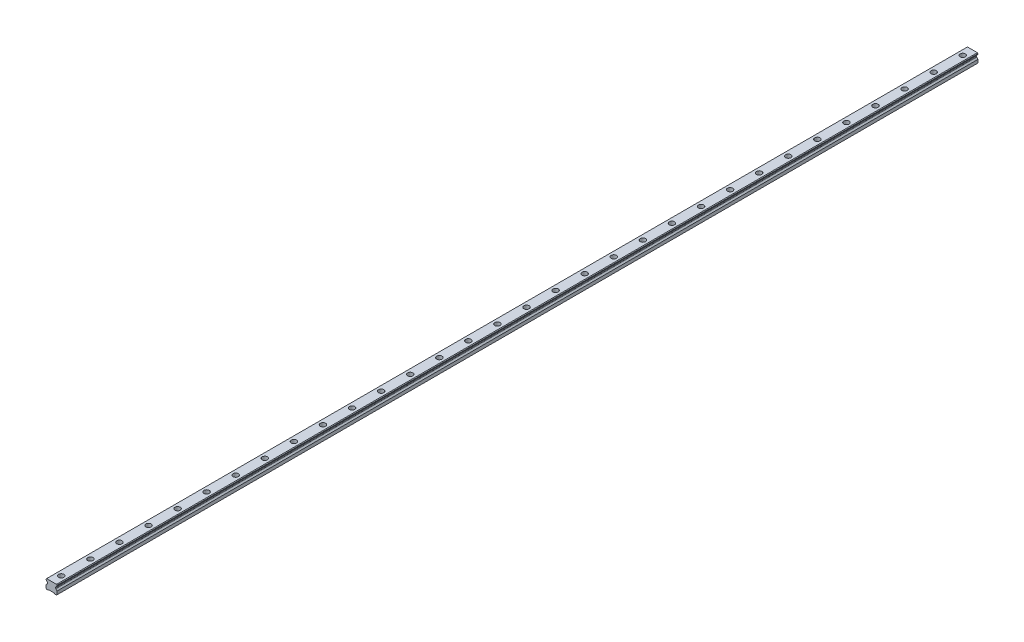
ISO-10303-21;
HEADER;
FILE_DESCRIPTION(('STEP AP214'),'2;1');
FILE_NAME('part.step','',(''),(''),'','','');
FILE_SCHEMA(('AUTOMOTIVE_DESIGN { 1 0 10303 214 1 1 1 1 }'));
ENDSEC;
DATA;
#1=APPLICATION_CONTEXT('core data for automotive mechanical design processes');
#2=APPLICATION_PROTOCOL_DEFINITION('international standard','automotive_design',2000,#1);
#3=PRODUCT_CONTEXT('',#1,'mechanical');
#4=PRODUCT('Part','Part','',(#3));
#5=PRODUCT_RELATED_PRODUCT_CATEGORY('part','',(#4));
#6=PRODUCT_DEFINITION_FORMATION('','',#4);
#7=PRODUCT_DEFINITION_CONTEXT('part definition',#1,'design');
#8=PRODUCT_DEFINITION('design','',#6,#7);
#9=PRODUCT_DEFINITION_SHAPE('','',#8);
#10=(LENGTH_UNIT() NAMED_UNIT(*) SI_UNIT(.MILLI.,.METRE.));
#11=(NAMED_UNIT(*) PLANE_ANGLE_UNIT() SI_UNIT($,.RADIAN.));
#12=(NAMED_UNIT(*) SI_UNIT($,.STERADIAN.) SOLID_ANGLE_UNIT());
#13=UNCERTAINTY_MEASURE_WITH_UNIT(LENGTH_MEASURE(1.E-05),#10,'distance_accuracy_value','');
#14=(GEOMETRIC_REPRESENTATION_CONTEXT(3) GLOBAL_UNCERTAINTY_ASSIGNED_CONTEXT((#13)) GLOBAL_UNIT_ASSIGNED_CONTEXT((#10,
#11,#12)) REPRESENTATION_CONTEXT('',''));
#15=CARTESIAN_POINT('',(0.,0.,0.));
#16=DIRECTION('',(0.,0.,1.));
#17=DIRECTION('',(1.,0.,0.));
#18=AXIS2_PLACEMENT_3D('',#15,#16,#17);
#19=CARTESIAN_POINT('',(0.,10.2,-930.));
#20=DIRECTION('',(0.,1.,0.));
#21=DIRECTION('',(0.,0.,1.));
#22=AXIS2_PLACEMENT_3D('',#19,#20,#21);
#23=PLANE('',#22);
#24=CARTESIAN_POINT('',(0.,10.2,-930.));
#25=DIRECTION('',(0.,1.,0.));
#26=DIRECTION('',(0.,0.,1.));
#27=AXIS2_PLACEMENT_3D('',#24,#25,#26);
#28=CIRCLE('',#27,3.5);
#29=CARTESIAN_POINT('',(0.,10.2,-926.5));
#30=VERTEX_POINT('',#29);
#31=EDGE_CURVE('E598',#30,#30,#28,.T.);
#32=ORIENTED_EDGE('',*,*,#31,.F.);
#33=EDGE_LOOP('',(#32));
#34=FACE_BOUND('',#33,.T.);
#35=CARTESIAN_POINT('',(0.,10.2,-930.));
#36=DIRECTION('',(0.,1.,0.));
#37=DIRECTION('',(0.,0.,1.));
#38=AXIS2_PLACEMENT_3D('',#35,#36,#37);
#39=CIRCLE('',#38,5.5);
#40=CARTESIAN_POINT('',(0.,10.2,-924.5));
#41=VERTEX_POINT('',#40);
#42=EDGE_CURVE('E11',#41,#41,#39,.T.);
#43=ORIENTED_EDGE('',*,*,#42,.T.);
#44=EDGE_LOOP('',(#43));
#45=FACE_BOUND('',#44,.T.);
#46=ADVANCED_FACE('F39',(#34,#45),#23,.T.);
#47=CARTESIAN_POINT('',(0.,10.2,-930.));
#48=DIRECTION('',(0.,1.,0.));
#49=DIRECTION('',(0.,0.,1.));
#50=AXIS2_PLACEMENT_3D('',#47,#48,#49);
#51=CYLINDRICAL_SURFACE('',#50,5.5);
#52=ORIENTED_EDGE('',*,*,#42,.F.);
#53=EDGE_LOOP('',(#52));
#54=FACE_BOUND('',#53,.T.);
#55=CARTESIAN_POINT('',(0.,19.2,-930.));
#56=DIRECTION('',(0.,1.,0.));
#57=DIRECTION('',(0.,0.,1.));
#58=AXIS2_PLACEMENT_3D('',#55,#56,#57);
#59=CIRCLE('',#58,5.5);
#60=CARTESIAN_POINT('',(0.,19.2,-924.5));
#61=VERTEX_POINT('',#60);
#62=EDGE_CURVE('E48',#61,#61,#59,.T.);
#63=ORIENTED_EDGE('',*,*,#62,.T.);
#64=EDGE_LOOP('',(#63));
#65=FACE_BOUND('',#64,.T.);
#66=ADVANCED_FACE('F1037',(#54,#65),#51,.F.);
#67=CARTESIAN_POINT('',(0.,10.2,-870.));
#68=DIRECTION('',(0.,1.,0.));
#69=DIRECTION('',(0.,0.,1.));
#70=AXIS2_PLACEMENT_3D('',#67,#68,#69);
#71=PLANE('',#70);
#72=CARTESIAN_POINT('',(0.,10.2,-870.));
#73=DIRECTION('',(0.,1.,0.));
#74=DIRECTION('',(0.,0.,1.));
#75=AXIS2_PLACEMENT_3D('',#72,#73,#74);
#76=CIRCLE('',#75,3.5);
#77=CARTESIAN_POINT('',(0.,10.2,-866.5));
#78=VERTEX_POINT('',#77);
#79=EDGE_CURVE('E603',#78,#78,#76,.T.);
#80=ORIENTED_EDGE('',*,*,#79,.F.);
#81=EDGE_LOOP('',(#80));
#82=FACE_BOUND('',#81,.T.);
#83=CARTESIAN_POINT('',(0.,10.2,-870.));
#84=DIRECTION('',(0.,1.,0.));
#85=DIRECTION('',(0.,0.,1.));
#86=AXIS2_PLACEMENT_3D('',#83,#84,#85);
#87=CIRCLE('',#86,5.5);
#88=CARTESIAN_POINT('',(0.,10.2,-864.5));
#89=VERTEX_POINT('',#88);
#90=EDGE_CURVE('E582',#89,#89,#87,.T.);
#91=ORIENTED_EDGE('',*,*,#90,.T.);
#92=EDGE_LOOP('',(#91));
#93=FACE_BOUND('',#92,.T.);
#94=ADVANCED_FACE('F1039',(#82,#93),#71,.T.);
#95=CARTESIAN_POINT('',(0.,10.2,-870.));
#96=DIRECTION('',(0.,1.,0.));
#97=DIRECTION('',(0.,0.,1.));
#98=AXIS2_PLACEMENT_3D('',#95,#96,#97);
#99=CYLINDRICAL_SURFACE('',#98,5.5);
#100=ORIENTED_EDGE('',*,*,#90,.F.);
#101=EDGE_LOOP('',(#100));
#102=FACE_BOUND('',#101,.T.);
#103=CARTESIAN_POINT('',(0.,19.2,-870.));
#104=DIRECTION('',(0.,1.,0.));
#105=DIRECTION('',(0.,0.,1.));
#106=AXIS2_PLACEMENT_3D('',#103,#104,#105);
#107=CIRCLE('',#106,5.5);
#108=CARTESIAN_POINT('',(0.,19.2,-864.5));
#109=VERTEX_POINT('',#108);
#110=EDGE_CURVE('E578',#109,#109,#107,.T.);
#111=ORIENTED_EDGE('',*,*,#110,.T.);
#112=EDGE_LOOP('',(#111));
#113=FACE_BOUND('',#112,.T.);
#114=ADVANCED_FACE('F1045',(#102,#113),#99,.F.);
#115=CARTESIAN_POINT('',(0.,10.2,-810.));
#116=DIRECTION('',(0.,1.,0.));
#117=DIRECTION('',(0.,0.,1.));
#118=AXIS2_PLACEMENT_3D('',#115,#116,#117);
#119=PLANE('',#118);
#120=CARTESIAN_POINT('',(0.,10.2,-810.));
#121=DIRECTION('',(0.,1.,0.));
#122=DIRECTION('',(0.,0.,1.));
#123=AXIS2_PLACEMENT_3D('',#120,#121,#122);
#124=CIRCLE('',#123,3.5);
#125=CARTESIAN_POINT('',(0.,10.2,-806.5));
#126=VERTEX_POINT('',#125);
#127=EDGE_CURVE('E608',#126,#126,#124,.T.);
#128=ORIENTED_EDGE('',*,*,#127,.F.);
#129=EDGE_LOOP('',(#128));
#130=FACE_BOUND('',#129,.T.);
#131=CARTESIAN_POINT('',(0.,10.2,-810.));
#132=DIRECTION('',(0.,1.,0.));
#133=DIRECTION('',(0.,0.,1.));
#134=AXIS2_PLACEMENT_3D('',#131,#132,#133);
#135=CIRCLE('',#134,5.5);
#136=CARTESIAN_POINT('',(0.,10.2,-804.5));
#137=VERTEX_POINT('',#136);
#138=EDGE_CURVE('E574',#137,#137,#135,.T.);
#139=ORIENTED_EDGE('',*,*,#138,.T.);
#140=EDGE_LOOP('',(#139));
#141=FACE_BOUND('',#140,.T.);
#142=ADVANCED_FACE('F1053',(#130,#141),#119,.T.);
#143=CARTESIAN_POINT('',(0.,10.2,-810.));
#144=DIRECTION('',(0.,1.,0.));
#145=DIRECTION('',(0.,0.,1.));
#146=AXIS2_PLACEMENT_3D('',#143,#144,#145);
#147=CYLINDRICAL_SURFACE('',#146,5.5);
#148=ORIENTED_EDGE('',*,*,#138,.F.);
#149=EDGE_LOOP('',(#148));
#150=FACE_BOUND('',#149,.T.);
#151=CARTESIAN_POINT('',(0.,19.2,-810.));
#152=DIRECTION('',(0.,1.,0.));
#153=DIRECTION('',(0.,0.,1.));
#154=AXIS2_PLACEMENT_3D('',#151,#152,#153);
#155=CIRCLE('',#154,5.5);
#156=CARTESIAN_POINT('',(0.,19.2,-804.5));
#157=VERTEX_POINT('',#156);
#158=EDGE_CURVE('E570',#157,#157,#155,.T.);
#159=ORIENTED_EDGE('',*,*,#158,.T.);
#160=EDGE_LOOP('',(#159));
#161=FACE_BOUND('',#160,.T.);
#162=ADVANCED_FACE('F1057',(#150,#161),#147,.F.);
#163=CARTESIAN_POINT('',(0.,10.2,-750.));
#164=DIRECTION('',(0.,1.,0.));
#165=DIRECTION('',(0.,0.,1.));
#166=AXIS2_PLACEMENT_3D('',#163,#164,#165);
#167=PLANE('',#166);
#168=CARTESIAN_POINT('',(0.,10.2,-750.));
#169=DIRECTION('',(0.,1.,0.));
#170=DIRECTION('',(0.,0.,1.));
#171=AXIS2_PLACEMENT_3D('',#168,#169,#170);
#172=CIRCLE('',#171,3.5);
#173=CARTESIAN_POINT('',(0.,10.2,-746.5));
#174=VERTEX_POINT('',#173);
#175=EDGE_CURVE('E613',#174,#174,#172,.T.);
#176=ORIENTED_EDGE('',*,*,#175,.F.);
#177=EDGE_LOOP('',(#176));
#178=FACE_BOUND('',#177,.T.);
#179=CARTESIAN_POINT('',(0.,10.2,-750.));
#180=DIRECTION('',(0.,1.,0.));
#181=DIRECTION('',(0.,0.,1.));
#182=AXIS2_PLACEMENT_3D('',#179,#180,#181);
#183=CIRCLE('',#182,5.5);
#184=CARTESIAN_POINT('',(0.,10.2,-744.5));
#185=VERTEX_POINT('',#184);
#186=EDGE_CURVE('E566',#185,#185,#183,.T.);
#187=ORIENTED_EDGE('',*,*,#186,.T.);
#188=EDGE_LOOP('',(#187));
#189=FACE_BOUND('',#188,.T.);
#190=ADVANCED_FACE('F1061',(#178,#189),#167,.T.);
#191=CARTESIAN_POINT('',(0.,10.2,-750.));
#192=DIRECTION('',(0.,1.,0.));
#193=DIRECTION('',(0.,0.,1.));
#194=AXIS2_PLACEMENT_3D('',#191,#192,#193);
#195=CYLINDRICAL_SURFACE('',#194,5.5);
#196=ORIENTED_EDGE('',*,*,#186,.F.);
#197=EDGE_LOOP('',(#196));
#198=FACE_BOUND('',#197,.T.);
#199=CARTESIAN_POINT('',(0.,19.2,-750.));
#200=DIRECTION('',(0.,1.,0.));
#201=DIRECTION('',(0.,0.,1.));
#202=AXIS2_PLACEMENT_3D('',#199,#200,#201);
#203=CIRCLE('',#202,5.5);
#204=CARTESIAN_POINT('',(0.,19.2,-744.5));
#205=VERTEX_POINT('',#204);
#206=EDGE_CURVE('E562',#205,#205,#203,.T.);
#207=ORIENTED_EDGE('',*,*,#206,.T.);
#208=EDGE_LOOP('',(#207));
#209=FACE_BOUND('',#208,.T.);
#210=ADVANCED_FACE('F1065',(#198,#209),#195,.F.);
#211=CARTESIAN_POINT('',(0.,10.2,-690.));
#212=DIRECTION('',(0.,1.,0.));
#213=DIRECTION('',(0.,0.,1.));
#214=AXIS2_PLACEMENT_3D('',#211,#212,#213);
#215=PLANE('',#214);
#216=CARTESIAN_POINT('',(0.,10.2,-690.));
#217=DIRECTION('',(0.,1.,0.));
#218=DIRECTION('',(0.,0.,1.));
#219=AXIS2_PLACEMENT_3D('',#216,#217,#218);
#220=CIRCLE('',#219,3.5);
#221=CARTESIAN_POINT('',(0.,10.2,-686.5));
#222=VERTEX_POINT('',#221);
#223=EDGE_CURVE('E618',#222,#222,#220,.T.);
#224=ORIENTED_EDGE('',*,*,#223,.F.);
#225=EDGE_LOOP('',(#224));
#226=FACE_BOUND('',#225,.T.);
#227=CARTESIAN_POINT('',(0.,10.2,-690.));
#228=DIRECTION('',(0.,1.,0.));
#229=DIRECTION('',(0.,0.,1.));
#230=AXIS2_PLACEMENT_3D('',#227,#228,#229);
#231=CIRCLE('',#230,5.5);
#232=CARTESIAN_POINT('',(0.,10.2,-684.5));
#233=VERTEX_POINT('',#232);
#234=EDGE_CURVE('E558',#233,#233,#231,.T.);
#235=ORIENTED_EDGE('',*,*,#234,.T.);
#236=EDGE_LOOP('',(#235));
#237=FACE_BOUND('',#236,.T.);
#238=ADVANCED_FACE('F1069',(#226,#237),#215,.T.);
#239=CARTESIAN_POINT('',(0.,10.2,-690.));
#240=DIRECTION('',(0.,1.,0.));
#241=DIRECTION('',(0.,0.,1.));
#242=AXIS2_PLACEMENT_3D('',#239,#240,#241);
#243=CYLINDRICAL_SURFACE('',#242,5.5);
#244=ORIENTED_EDGE('',*,*,#234,.F.);
#245=EDGE_LOOP('',(#244));
#246=FACE_BOUND('',#245,.T.);
#247=CARTESIAN_POINT('',(0.,19.2,-690.));
#248=DIRECTION('',(0.,1.,0.));
#249=DIRECTION('',(0.,0.,1.));
#250=AXIS2_PLACEMENT_3D('',#247,#248,#249);
#251=CIRCLE('',#250,5.5);
#252=CARTESIAN_POINT('',(0.,19.2,-684.5));
#253=VERTEX_POINT('',#252);
#254=EDGE_CURVE('E554',#253,#253,#251,.T.);
#255=ORIENTED_EDGE('',*,*,#254,.T.);
#256=EDGE_LOOP('',(#255));
#257=FACE_BOUND('',#256,.T.);
#258=ADVANCED_FACE('F1073',(#246,#257),#243,.F.);
#259=CARTESIAN_POINT('',(0.,10.2,-630.));
#260=DIRECTION('',(0.,1.,0.));
#261=DIRECTION('',(0.,0.,1.));
#262=AXIS2_PLACEMENT_3D('',#259,#260,#261);
#263=PLANE('',#262);
#264=CARTESIAN_POINT('',(0.,10.2,-630.));
#265=DIRECTION('',(0.,1.,0.));
#266=DIRECTION('',(0.,0.,1.));
#267=AXIS2_PLACEMENT_3D('',#264,#265,#266);
#268=CIRCLE('',#267,3.5);
#269=CARTESIAN_POINT('',(0.,10.2,-626.5));
#270=VERTEX_POINT('',#269);
#271=EDGE_CURVE('E623',#270,#270,#268,.T.);
#272=ORIENTED_EDGE('',*,*,#271,.F.);
#273=EDGE_LOOP('',(#272));
#274=FACE_BOUND('',#273,.T.);
#275=CARTESIAN_POINT('',(0.,10.2,-630.));
#276=DIRECTION('',(0.,1.,0.));
#277=DIRECTION('',(0.,0.,1.));
#278=AXIS2_PLACEMENT_3D('',#275,#276,#277);
#279=CIRCLE('',#278,5.5);
#280=CARTESIAN_POINT('',(0.,10.2,-624.5));
#281=VERTEX_POINT('',#280);
#282=EDGE_CURVE('E550',#281,#281,#279,.T.);
#283=ORIENTED_EDGE('',*,*,#282,.T.);
#284=EDGE_LOOP('',(#283));
#285=FACE_BOUND('',#284,.T.);
#286=ADVANCED_FACE('F1077',(#274,#285),#263,.T.);
#287=CARTESIAN_POINT('',(0.,10.2,-630.));
#288=DIRECTION('',(0.,1.,0.));
#289=DIRECTION('',(0.,0.,1.));
#290=AXIS2_PLACEMENT_3D('',#287,#288,#289);
#291=CYLINDRICAL_SURFACE('',#290,5.5);
#292=ORIENTED_EDGE('',*,*,#282,.F.);
#293=EDGE_LOOP('',(#292));
#294=FACE_BOUND('',#293,.T.);
#295=CARTESIAN_POINT('',(0.,19.2,-630.));
#296=DIRECTION('',(0.,1.,0.));
#297=DIRECTION('',(0.,0.,1.));
#298=AXIS2_PLACEMENT_3D('',#295,#296,#297);
#299=CIRCLE('',#298,5.5);
#300=CARTESIAN_POINT('',(0.,19.2,-624.5));
#301=VERTEX_POINT('',#300);
#302=EDGE_CURVE('E546',#301,#301,#299,.T.);
#303=ORIENTED_EDGE('',*,*,#302,.T.);
#304=EDGE_LOOP('',(#303));
#305=FACE_BOUND('',#304,.T.);
#306=ADVANCED_FACE('F1081',(#294,#305),#291,.F.);
#307=CARTESIAN_POINT('',(0.,10.2,-570.));
#308=DIRECTION('',(0.,1.,0.));
#309=DIRECTION('',(0.,0.,1.));
#310=AXIS2_PLACEMENT_3D('',#307,#308,#309);
#311=PLANE('',#310);
#312=CARTESIAN_POINT('',(0.,10.2,-570.));
#313=DIRECTION('',(0.,1.,0.));
#314=DIRECTION('',(0.,0.,1.));
#315=AXIS2_PLACEMENT_3D('',#312,#313,#314);
#316=CIRCLE('',#315,3.5);
#317=CARTESIAN_POINT('',(0.,10.2,-566.5));
#318=VERTEX_POINT('',#317);
#319=EDGE_CURVE('E628',#318,#318,#316,.T.);
#320=ORIENTED_EDGE('',*,*,#319,.F.);
#321=EDGE_LOOP('',(#320));
#322=FACE_BOUND('',#321,.T.);
#323=CARTESIAN_POINT('',(0.,10.2,-570.));
#324=DIRECTION('',(0.,1.,0.));
#325=DIRECTION('',(0.,0.,1.));
#326=AXIS2_PLACEMENT_3D('',#323,#324,#325);
#327=CIRCLE('',#326,5.5);
#328=CARTESIAN_POINT('',(0.,10.2,-564.5));
#329=VERTEX_POINT('',#328);
#330=EDGE_CURVE('E542',#329,#329,#327,.T.);
#331=ORIENTED_EDGE('',*,*,#330,.T.);
#332=EDGE_LOOP('',(#331));
#333=FACE_BOUND('',#332,.T.);
#334=ADVANCED_FACE('F1085',(#322,#333),#311,.T.);
#335=CARTESIAN_POINT('',(0.,10.2,-570.));
#336=DIRECTION('',(0.,1.,0.));
#337=DIRECTION('',(0.,0.,1.));
#338=AXIS2_PLACEMENT_3D('',#335,#336,#337);
#339=CYLINDRICAL_SURFACE('',#338,5.5);
#340=ORIENTED_EDGE('',*,*,#330,.F.);
#341=EDGE_LOOP('',(#340));
#342=FACE_BOUND('',#341,.T.);
#343=CARTESIAN_POINT('',(0.,19.2,-570.));
#344=DIRECTION('',(0.,1.,0.));
#345=DIRECTION('',(0.,0.,1.));
#346=AXIS2_PLACEMENT_3D('',#343,#344,#345);
#347=CIRCLE('',#346,5.5);
#348=CARTESIAN_POINT('',(0.,19.2,-564.5));
#349=VERTEX_POINT('',#348);
#350=EDGE_CURVE('E538',#349,#349,#347,.T.);
#351=ORIENTED_EDGE('',*,*,#350,.T.);
#352=EDGE_LOOP('',(#351));
#353=FACE_BOUND('',#352,.T.);
#354=ADVANCED_FACE('F1089',(#342,#353),#339,.F.);
#355=CARTESIAN_POINT('',(0.,10.2,-510.));
#356=DIRECTION('',(0.,1.,0.));
#357=DIRECTION('',(0.,0.,1.));
#358=AXIS2_PLACEMENT_3D('',#355,#356,#357);
#359=PLANE('',#358);
#360=CARTESIAN_POINT('',(0.,10.2,-510.));
#361=DIRECTION('',(0.,1.,0.));
#362=DIRECTION('',(0.,0.,1.));
#363=AXIS2_PLACEMENT_3D('',#360,#361,#362);
#364=CIRCLE('',#363,3.5);
#365=CARTESIAN_POINT('',(0.,10.2,-506.5));
#366=VERTEX_POINT('',#365);
#367=EDGE_CURVE('E633',#366,#366,#364,.T.);
#368=ORIENTED_EDGE('',*,*,#367,.F.);
#369=EDGE_LOOP('',(#368));
#370=FACE_BOUND('',#369,.T.);
#371=CARTESIAN_POINT('',(0.,10.2,-510.));
#372=DIRECTION('',(0.,1.,0.));
#373=DIRECTION('',(0.,0.,1.));
#374=AXIS2_PLACEMENT_3D('',#371,#372,#373);
#375=CIRCLE('',#374,5.5);
#376=CARTESIAN_POINT('',(0.,10.2,-504.5));
#377=VERTEX_POINT('',#376);
#378=EDGE_CURVE('E534',#377,#377,#375,.T.);
#379=ORIENTED_EDGE('',*,*,#378,.T.);
#380=EDGE_LOOP('',(#379));
#381=FACE_BOUND('',#380,.T.);
#382=ADVANCED_FACE('F1093',(#370,#381),#359,.T.);
#383=CARTESIAN_POINT('',(0.,10.2,-510.));
#384=DIRECTION('',(0.,1.,0.));
#385=DIRECTION('',(0.,0.,1.));
#386=AXIS2_PLACEMENT_3D('',#383,#384,#385);
#387=CYLINDRICAL_SURFACE('',#386,5.5);
#388=ORIENTED_EDGE('',*,*,#378,.F.);
#389=EDGE_LOOP('',(#388));
#390=FACE_BOUND('',#389,.T.);
#391=CARTESIAN_POINT('',(0.,19.2,-510.));
#392=DIRECTION('',(0.,1.,0.));
#393=DIRECTION('',(0.,0.,1.));
#394=AXIS2_PLACEMENT_3D('',#391,#392,#393);
#395=CIRCLE('',#394,5.5);
#396=CARTESIAN_POINT('',(0.,19.2,-504.5));
#397=VERTEX_POINT('',#396);
#398=EDGE_CURVE('E530',#397,#397,#395,.T.);
#399=ORIENTED_EDGE('',*,*,#398,.T.);
#400=EDGE_LOOP('',(#399));
#401=FACE_BOUND('',#400,.T.);
#402=ADVANCED_FACE('F1097',(#390,#401),#387,.F.);
#403=CARTESIAN_POINT('',(0.,10.2,-450.));
#404=DIRECTION('',(0.,1.,0.));
#405=DIRECTION('',(0.,0.,1.));
#406=AXIS2_PLACEMENT_3D('',#403,#404,#405);
#407=PLANE('',#406);
#408=CARTESIAN_POINT('',(0.,10.2,-450.));
#409=DIRECTION('',(0.,1.,0.));
#410=DIRECTION('',(0.,0.,1.));
#411=AXIS2_PLACEMENT_3D('',#408,#409,#410);
#412=CIRCLE('',#411,3.5);
#413=CARTESIAN_POINT('',(0.,10.2,-446.5));
#414=VERTEX_POINT('',#413);
#415=EDGE_CURVE('E638',#414,#414,#412,.T.);
#416=ORIENTED_EDGE('',*,*,#415,.F.);
#417=EDGE_LOOP('',(#416));
#418=FACE_BOUND('',#417,.T.);
#419=CARTESIAN_POINT('',(0.,10.2,-450.));
#420=DIRECTION('',(0.,1.,0.));
#421=DIRECTION('',(0.,0.,1.));
#422=AXIS2_PLACEMENT_3D('',#419,#420,#421);
#423=CIRCLE('',#422,5.5);
#424=CARTESIAN_POINT('',(0.,10.2,-444.5));
#425=VERTEX_POINT('',#424);
#426=EDGE_CURVE('E526',#425,#425,#423,.T.);
#427=ORIENTED_EDGE('',*,*,#426,.T.);
#428=EDGE_LOOP('',(#427));
#429=FACE_BOUND('',#428,.T.);
#430=ADVANCED_FACE('F1101',(#418,#429),#407,.T.);
#431=CARTESIAN_POINT('',(0.,10.2,-450.));
#432=DIRECTION('',(0.,1.,0.));
#433=DIRECTION('',(0.,0.,1.));
#434=AXIS2_PLACEMENT_3D('',#431,#432,#433);
#435=CYLINDRICAL_SURFACE('',#434,5.5);
#436=ORIENTED_EDGE('',*,*,#426,.F.);
#437=EDGE_LOOP('',(#436));
#438=FACE_BOUND('',#437,.T.);
#439=CARTESIAN_POINT('',(0.,19.2,-450.));
#440=DIRECTION('',(0.,1.,0.));
#441=DIRECTION('',(0.,0.,1.));
#442=AXIS2_PLACEMENT_3D('',#439,#440,#441);
#443=CIRCLE('',#442,5.5);
#444=CARTESIAN_POINT('',(0.,19.2,-444.5));
#445=VERTEX_POINT('',#444);
#446=EDGE_CURVE('E522',#445,#445,#443,.T.);
#447=ORIENTED_EDGE('',*,*,#446,.T.);
#448=EDGE_LOOP('',(#447));
#449=FACE_BOUND('',#448,.T.);
#450=ADVANCED_FACE('F1105',(#438,#449),#435,.F.);
#451=CARTESIAN_POINT('',(0.,10.2,-390.));
#452=DIRECTION('',(0.,1.,0.));
#453=DIRECTION('',(0.,0.,1.));
#454=AXIS2_PLACEMENT_3D('',#451,#452,#453);
#455=PLANE('',#454);
#456=CARTESIAN_POINT('',(0.,10.2,-390.));
#457=DIRECTION('',(0.,1.,0.));
#458=DIRECTION('',(0.,0.,1.));
#459=AXIS2_PLACEMENT_3D('',#456,#457,#458);
#460=CIRCLE('',#459,3.5);
#461=CARTESIAN_POINT('',(0.,10.2,-386.5));
#462=VERTEX_POINT('',#461);
#463=EDGE_CURVE('E643',#462,#462,#460,.T.);
#464=ORIENTED_EDGE('',*,*,#463,.F.);
#465=EDGE_LOOP('',(#464));
#466=FACE_BOUND('',#465,.T.);
#467=CARTESIAN_POINT('',(0.,10.2,-390.));
#468=DIRECTION('',(0.,1.,0.));
#469=DIRECTION('',(0.,0.,1.));
#470=AXIS2_PLACEMENT_3D('',#467,#468,#469);
#471=CIRCLE('',#470,5.5);
#472=CARTESIAN_POINT('',(0.,10.2,-384.5));
#473=VERTEX_POINT('',#472);
#474=EDGE_CURVE('E518',#473,#473,#471,.T.);
#475=ORIENTED_EDGE('',*,*,#474,.T.);
#476=EDGE_LOOP('',(#475));
#477=FACE_BOUND('',#476,.T.);
#478=ADVANCED_FACE('F1109',(#466,#477),#455,.T.);
#479=CARTESIAN_POINT('',(0.,10.2,-390.));
#480=DIRECTION('',(0.,1.,0.));
#481=DIRECTION('',(0.,0.,1.));
#482=AXIS2_PLACEMENT_3D('',#479,#480,#481);
#483=CYLINDRICAL_SURFACE('',#482,5.5);
#484=ORIENTED_EDGE('',*,*,#474,.F.);
#485=EDGE_LOOP('',(#484));
#486=FACE_BOUND('',#485,.T.);
#487=CARTESIAN_POINT('',(0.,19.2,-390.));
#488=DIRECTION('',(0.,1.,0.));
#489=DIRECTION('',(0.,0.,1.));
#490=AXIS2_PLACEMENT_3D('',#487,#488,#489);
#491=CIRCLE('',#490,5.5);
#492=CARTESIAN_POINT('',(0.,19.2,-384.5));
#493=VERTEX_POINT('',#492);
#494=EDGE_CURVE('E514',#493,#493,#491,.T.);
#495=ORIENTED_EDGE('',*,*,#494,.T.);
#496=EDGE_LOOP('',(#495));
#497=FACE_BOUND('',#496,.T.);
#498=ADVANCED_FACE('F1113',(#486,#497),#483,.F.);
#499=CARTESIAN_POINT('',(0.,10.2,-330.));
#500=DIRECTION('',(0.,1.,0.));
#501=DIRECTION('',(0.,0.,1.));
#502=AXIS2_PLACEMENT_3D('',#499,#500,#501);
#503=PLANE('',#502);
#504=CARTESIAN_POINT('',(0.,10.2,-330.));
#505=DIRECTION('',(0.,1.,0.));
#506=DIRECTION('',(0.,0.,1.));
#507=AXIS2_PLACEMENT_3D('',#504,#505,#506);
#508=CIRCLE('',#507,3.5);
#509=CARTESIAN_POINT('',(0.,10.2,-326.5));
#510=VERTEX_POINT('',#509);
#511=EDGE_CURVE('E648',#510,#510,#508,.T.);
#512=ORIENTED_EDGE('',*,*,#511,.F.);
#513=EDGE_LOOP('',(#512));
#514=FACE_BOUND('',#513,.T.);
#515=CARTESIAN_POINT('',(0.,10.2,-330.));
#516=DIRECTION('',(0.,1.,0.));
#517=DIRECTION('',(0.,0.,1.));
#518=AXIS2_PLACEMENT_3D('',#515,#516,#517);
#519=CIRCLE('',#518,5.5);
#520=CARTESIAN_POINT('',(0.,10.2,-324.5));
#521=VERTEX_POINT('',#520);
#522=EDGE_CURVE('E510',#521,#521,#519,.T.);
#523=ORIENTED_EDGE('',*,*,#522,.T.);
#524=EDGE_LOOP('',(#523));
#525=FACE_BOUND('',#524,.T.);
#526=ADVANCED_FACE('F1117',(#514,#525),#503,.T.);
#527=CARTESIAN_POINT('',(0.,10.2,-330.));
#528=DIRECTION('',(0.,1.,0.));
#529=DIRECTION('',(0.,0.,1.));
#530=AXIS2_PLACEMENT_3D('',#527,#528,#529);
#531=CYLINDRICAL_SURFACE('',#530,5.5);
#532=ORIENTED_EDGE('',*,*,#522,.F.);
#533=EDGE_LOOP('',(#532));
#534=FACE_BOUND('',#533,.T.);
#535=CARTESIAN_POINT('',(0.,19.2,-330.));
#536=DIRECTION('',(0.,1.,0.));
#537=DIRECTION('',(0.,0.,1.));
#538=AXIS2_PLACEMENT_3D('',#535,#536,#537);
#539=CIRCLE('',#538,5.5);
#540=CARTESIAN_POINT('',(0.,19.2,-324.5));
#541=VERTEX_POINT('',#540);
#542=EDGE_CURVE('E506',#541,#541,#539,.T.);
#543=ORIENTED_EDGE('',*,*,#542,.T.);
#544=EDGE_LOOP('',(#543));
#545=FACE_BOUND('',#544,.T.);
#546=ADVANCED_FACE('F1121',(#534,#545),#531,.F.);
#547=CARTESIAN_POINT('',(0.,10.2,-270.));
#548=DIRECTION('',(0.,1.,0.));
#549=DIRECTION('',(0.,0.,1.));
#550=AXIS2_PLACEMENT_3D('',#547,#548,#549);
#551=PLANE('',#550);
#552=CARTESIAN_POINT('',(0.,10.2,-270.));
#553=DIRECTION('',(0.,1.,0.));
#554=DIRECTION('',(0.,0.,1.));
#555=AXIS2_PLACEMENT_3D('',#552,#553,#554);
#556=CIRCLE('',#555,3.5);
#557=CARTESIAN_POINT('',(0.,10.2,-266.5));
#558=VERTEX_POINT('',#557);
#559=EDGE_CURVE('E653',#558,#558,#556,.T.);
#560=ORIENTED_EDGE('',*,*,#559,.F.);
#561=EDGE_LOOP('',(#560));
#562=FACE_BOUND('',#561,.T.);
#563=CARTESIAN_POINT('',(0.,10.2,-270.));
#564=DIRECTION('',(0.,1.,0.));
#565=DIRECTION('',(0.,0.,1.));
#566=AXIS2_PLACEMENT_3D('',#563,#564,#565);
#567=CIRCLE('',#566,5.5);
#568=CARTESIAN_POINT('',(0.,10.2,-264.5));
#569=VERTEX_POINT('',#568);
#570=EDGE_CURVE('E502',#569,#569,#567,.T.);
#571=ORIENTED_EDGE('',*,*,#570,.T.);
#572=EDGE_LOOP('',(#571));
#573=FACE_BOUND('',#572,.T.);
#574=ADVANCED_FACE('F1125',(#562,#573),#551,.T.);
#575=CARTESIAN_POINT('',(0.,10.2,-270.));
#576=DIRECTION('',(0.,1.,0.));
#577=DIRECTION('',(0.,0.,1.));
#578=AXIS2_PLACEMENT_3D('',#575,#576,#577);
#579=CYLINDRICAL_SURFACE('',#578,5.5);
#580=ORIENTED_EDGE('',*,*,#570,.F.);
#581=EDGE_LOOP('',(#580));
#582=FACE_BOUND('',#581,.T.);
#583=CARTESIAN_POINT('',(0.,19.2,-270.));
#584=DIRECTION('',(0.,1.,0.));
#585=DIRECTION('',(0.,0.,1.));
#586=AXIS2_PLACEMENT_3D('',#583,#584,#585);
#587=CIRCLE('',#586,5.5);
#588=CARTESIAN_POINT('',(0.,19.2,-264.5));
#589=VERTEX_POINT('',#588);
#590=EDGE_CURVE('E498',#589,#589,#587,.T.);
#591=ORIENTED_EDGE('',*,*,#590,.T.);
#592=EDGE_LOOP('',(#591));
#593=FACE_BOUND('',#592,.T.);
#594=ADVANCED_FACE('F1129',(#582,#593),#579,.F.);
#595=CARTESIAN_POINT('',(0.,10.2,-210.));
#596=DIRECTION('',(0.,1.,0.));
#597=DIRECTION('',(0.,0.,1.));
#598=AXIS2_PLACEMENT_3D('',#595,#596,#597);
#599=PLANE('',#598);
#600=CARTESIAN_POINT('',(0.,10.2,-210.));
#601=DIRECTION('',(0.,1.,0.));
#602=DIRECTION('',(0.,0.,1.));
#603=AXIS2_PLACEMENT_3D('',#600,#601,#602);
#604=CIRCLE('',#603,3.5);
#605=CARTESIAN_POINT('',(0.,10.2,-206.5));
#606=VERTEX_POINT('',#605);
#607=EDGE_CURVE('E658',#606,#606,#604,.T.);
#608=ORIENTED_EDGE('',*,*,#607,.F.);
#609=EDGE_LOOP('',(#608));
#610=FACE_BOUND('',#609,.T.);
#611=CARTESIAN_POINT('',(0.,10.2,-210.));
#612=DIRECTION('',(0.,1.,0.));
#613=DIRECTION('',(0.,0.,1.));
#614=AXIS2_PLACEMENT_3D('',#611,#612,#613);
#615=CIRCLE('',#614,5.5);
#616=CARTESIAN_POINT('',(0.,10.2,-204.5));
#617=VERTEX_POINT('',#616);
#618=EDGE_CURVE('E494',#617,#617,#615,.T.);
#619=ORIENTED_EDGE('',*,*,#618,.T.);
#620=EDGE_LOOP('',(#619));
#621=FACE_BOUND('',#620,.T.);
#622=ADVANCED_FACE('F1133',(#610,#621),#599,.T.);
#623=CARTESIAN_POINT('',(0.,10.2,-210.));
#624=DIRECTION('',(0.,1.,0.));
#625=DIRECTION('',(0.,0.,1.));
#626=AXIS2_PLACEMENT_3D('',#623,#624,#625);
#627=CYLINDRICAL_SURFACE('',#626,5.5);
#628=ORIENTED_EDGE('',*,*,#618,.F.);
#629=EDGE_LOOP('',(#628));
#630=FACE_BOUND('',#629,.T.);
#631=CARTESIAN_POINT('',(0.,19.2,-210.));
#632=DIRECTION('',(0.,1.,0.));
#633=DIRECTION('',(0.,0.,1.));
#634=AXIS2_PLACEMENT_3D('',#631,#632,#633);
#635=CIRCLE('',#634,5.5);
#636=CARTESIAN_POINT('',(0.,19.2,-204.5));
#637=VERTEX_POINT('',#636);
#638=EDGE_CURVE('E490',#637,#637,#635,.T.);
#639=ORIENTED_EDGE('',*,*,#638,.T.);
#640=EDGE_LOOP('',(#639));
#641=FACE_BOUND('',#640,.T.);
#642=ADVANCED_FACE('F1137',(#630,#641),#627,.F.);
#643=CARTESIAN_POINT('',(0.,10.2,-150.));
#644=DIRECTION('',(0.,1.,0.));
#645=DIRECTION('',(0.,0.,1.));
#646=AXIS2_PLACEMENT_3D('',#643,#644,#645);
#647=PLANE('',#646);
#648=CARTESIAN_POINT('',(0.,10.2,-150.));
#649=DIRECTION('',(0.,1.,0.));
#650=DIRECTION('',(0.,0.,1.));
#651=AXIS2_PLACEMENT_3D('',#648,#649,#650);
#652=CIRCLE('',#651,3.5);
#653=CARTESIAN_POINT('',(0.,10.2,-146.5));
#654=VERTEX_POINT('',#653);
#655=EDGE_CURVE('E663',#654,#654,#652,.T.);
#656=ORIENTED_EDGE('',*,*,#655,.F.);
#657=EDGE_LOOP('',(#656));
#658=FACE_BOUND('',#657,.T.);
#659=CARTESIAN_POINT('',(0.,10.2,-150.));
#660=DIRECTION('',(0.,1.,0.));
#661=DIRECTION('',(0.,0.,1.));
#662=AXIS2_PLACEMENT_3D('',#659,#660,#661);
#663=CIRCLE('',#662,5.5);
#664=CARTESIAN_POINT('',(0.,10.2,-144.5));
#665=VERTEX_POINT('',#664);
#666=EDGE_CURVE('E486',#665,#665,#663,.T.);
#667=ORIENTED_EDGE('',*,*,#666,.T.);
#668=EDGE_LOOP('',(#667));
#669=FACE_BOUND('',#668,.T.);
#670=ADVANCED_FACE('F1141',(#658,#669),#647,.T.);
#671=CARTESIAN_POINT('',(0.,10.2,-150.));
#672=DIRECTION('',(0.,1.,0.));
#673=DIRECTION('',(0.,0.,1.));
#674=AXIS2_PLACEMENT_3D('',#671,#672,#673);
#675=CYLINDRICAL_SURFACE('',#674,5.5);
#676=ORIENTED_EDGE('',*,*,#666,.F.);
#677=EDGE_LOOP('',(#676));
#678=FACE_BOUND('',#677,.T.);
#679=CARTESIAN_POINT('',(0.,19.2,-150.));
#680=DIRECTION('',(0.,1.,0.));
#681=DIRECTION('',(0.,0.,1.));
#682=AXIS2_PLACEMENT_3D('',#679,#680,#681);
#683=CIRCLE('',#682,5.5);
#684=CARTESIAN_POINT('',(0.,19.2,-144.5));
#685=VERTEX_POINT('',#684);
#686=EDGE_CURVE('E482',#685,#685,#683,.T.);
#687=ORIENTED_EDGE('',*,*,#686,.T.);
#688=EDGE_LOOP('',(#687));
#689=FACE_BOUND('',#688,.T.);
#690=ADVANCED_FACE('F1145',(#678,#689),#675,.F.);
#691=CARTESIAN_POINT('',(0.,10.2,-90.0000000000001));
#692=DIRECTION('',(0.,1.,0.));
#693=DIRECTION('',(0.,0.,1.));
#694=AXIS2_PLACEMENT_3D('',#691,#692,#693);
#695=PLANE('',#694);
#696=CARTESIAN_POINT('',(0.,10.2,-90.0000000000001));
#697=DIRECTION('',(0.,1.,0.));
#698=DIRECTION('',(0.,0.,1.));
#699=AXIS2_PLACEMENT_3D('',#696,#697,#698);
#700=CIRCLE('',#699,3.5);
#701=CARTESIAN_POINT('',(0.,10.2,-86.5000000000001));
#702=VERTEX_POINT('',#701);
#703=EDGE_CURVE('E668',#702,#702,#700,.T.);
#704=ORIENTED_EDGE('',*,*,#703,.F.);
#705=EDGE_LOOP('',(#704));
#706=FACE_BOUND('',#705,.T.);
#707=CARTESIAN_POINT('',(0.,10.2,-90.0000000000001));
#708=DIRECTION('',(0.,1.,0.));
#709=DIRECTION('',(0.,0.,1.));
#710=AXIS2_PLACEMENT_3D('',#707,#708,#709);
#711=CIRCLE('',#710,5.5);
#712=CARTESIAN_POINT('',(0.,10.2,-84.5000000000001));
#713=VERTEX_POINT('',#712);
#714=EDGE_CURVE('E478',#713,#713,#711,.T.);
#715=ORIENTED_EDGE('',*,*,#714,.T.);
#716=EDGE_LOOP('',(#715));
#717=FACE_BOUND('',#716,.T.);
#718=ADVANCED_FACE('F1149',(#706,#717),#695,.T.);
#719=CARTESIAN_POINT('',(0.,10.2,-90.0000000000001));
#720=DIRECTION('',(0.,1.,0.));
#721=DIRECTION('',(0.,0.,1.));
#722=AXIS2_PLACEMENT_3D('',#719,#720,#721);
#723=CYLINDRICAL_SURFACE('',#722,5.5);
#724=ORIENTED_EDGE('',*,*,#714,.F.);
#725=EDGE_LOOP('',(#724));
#726=FACE_BOUND('',#725,.T.);
#727=CARTESIAN_POINT('',(0.,19.2,-90.0000000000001));
#728=DIRECTION('',(0.,1.,0.));
#729=DIRECTION('',(0.,0.,1.));
#730=AXIS2_PLACEMENT_3D('',#727,#728,#729);
#731=CIRCLE('',#730,5.5);
#732=CARTESIAN_POINT('',(0.,19.2,-84.5000000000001));
#733=VERTEX_POINT('',#732);
#734=EDGE_CURVE('E474',#733,#733,#731,.T.);
#735=ORIENTED_EDGE('',*,*,#734,.T.);
#736=EDGE_LOOP('',(#735));
#737=FACE_BOUND('',#736,.T.);
#738=ADVANCED_FACE('F1153',(#726,#737),#723,.F.);
#739=CARTESIAN_POINT('',(0.,10.2,-30.));
#740=DIRECTION('',(0.,1.,0.));
#741=DIRECTION('',(0.,0.,1.));
#742=AXIS2_PLACEMENT_3D('',#739,#740,#741);
#743=PLANE('',#742);
#744=CARTESIAN_POINT('',(0.,10.2,-30.));
#745=DIRECTION('',(0.,1.,0.));
#746=DIRECTION('',(0.,0.,1.));
#747=AXIS2_PLACEMENT_3D('',#744,#745,#746);
#748=CIRCLE('',#747,3.5);
#749=CARTESIAN_POINT('',(0.,10.2,-26.5));
#750=VERTEX_POINT('',#749);
#751=EDGE_CURVE('E673',#750,#750,#748,.T.);
#752=ORIENTED_EDGE('',*,*,#751,.F.);
#753=EDGE_LOOP('',(#752));
#754=FACE_BOUND('',#753,.T.);
#755=CARTESIAN_POINT('',(0.,10.2,-30.));
#756=DIRECTION('',(0.,1.,0.));
#757=DIRECTION('',(0.,0.,1.));
#758=AXIS2_PLACEMENT_3D('',#755,#756,#757);
#759=CIRCLE('',#758,5.5);
#760=CARTESIAN_POINT('',(0.,10.2,-24.5));
#761=VERTEX_POINT('',#760);
#762=EDGE_CURVE('E470',#761,#761,#759,.T.);
#763=ORIENTED_EDGE('',*,*,#762,.T.);
#764=EDGE_LOOP('',(#763));
#765=FACE_BOUND('',#764,.T.);
#766=ADVANCED_FACE('F1157',(#754,#765),#743,.T.);
#767=CARTESIAN_POINT('',(0.,10.2,-30.));
#768=DIRECTION('',(0.,1.,0.));
#769=DIRECTION('',(0.,0.,1.));
#770=AXIS2_PLACEMENT_3D('',#767,#768,#769);
#771=CYLINDRICAL_SURFACE('',#770,5.5);
#772=ORIENTED_EDGE('',*,*,#762,.F.);
#773=EDGE_LOOP('',(#772));
#774=FACE_BOUND('',#773,.T.);
#775=CARTESIAN_POINT('',(0.,19.2,-30.));
#776=DIRECTION('',(0.,1.,0.));
#777=DIRECTION('',(0.,0.,1.));
#778=AXIS2_PLACEMENT_3D('',#775,#776,#777);
#779=CIRCLE('',#778,5.5);
#780=CARTESIAN_POINT('',(0.,19.2,-24.5));
#781=VERTEX_POINT('',#780);
#782=EDGE_CURVE('E466',#781,#781,#779,.T.);
#783=ORIENTED_EDGE('',*,*,#782,.T.);
#784=EDGE_LOOP('',(#783));
#785=FACE_BOUND('',#784,.T.);
#786=ADVANCED_FACE('F1161',(#774,#785),#771,.F.);
#787=CARTESIAN_POINT('',(0.,10.2,30.));
#788=DIRECTION('',(0.,1.,0.));
#789=DIRECTION('',(0.,0.,1.));
#790=AXIS2_PLACEMENT_3D('',#787,#788,#789);
#791=PLANE('',#790);
#792=CARTESIAN_POINT('',(0.,10.2,30.));
#793=DIRECTION('',(0.,1.,0.));
#794=DIRECTION('',(0.,0.,1.));
#795=AXIS2_PLACEMENT_3D('',#792,#793,#794);
#796=CIRCLE('',#795,3.5);
#797=CARTESIAN_POINT('',(0.,10.2,33.5));
#798=VERTEX_POINT('',#797);
#799=EDGE_CURVE('E678',#798,#798,#796,.T.);
#800=ORIENTED_EDGE('',*,*,#799,.F.);
#801=EDGE_LOOP('',(#800));
#802=FACE_BOUND('',#801,.T.);
#803=CARTESIAN_POINT('',(0.,10.2,30.));
#804=DIRECTION('',(0.,1.,0.));
#805=DIRECTION('',(0.,0.,1.));
#806=AXIS2_PLACEMENT_3D('',#803,#804,#805);
#807=CIRCLE('',#806,5.5);
#808=CARTESIAN_POINT('',(0.,10.2,35.5));
#809=VERTEX_POINT('',#808);
#810=EDGE_CURVE('E462',#809,#809,#807,.T.);
#811=ORIENTED_EDGE('',*,*,#810,.T.);
#812=EDGE_LOOP('',(#811));
#813=FACE_BOUND('',#812,.T.);
#814=ADVANCED_FACE('F1165',(#802,#813),#791,.T.);
#815=CARTESIAN_POINT('',(0.,10.2,30.));
#816=DIRECTION('',(0.,1.,0.));
#817=DIRECTION('',(0.,0.,1.));
#818=AXIS2_PLACEMENT_3D('',#815,#816,#817);
#819=CYLINDRICAL_SURFACE('',#818,5.5);
#820=ORIENTED_EDGE('',*,*,#810,.F.);
#821=EDGE_LOOP('',(#820));
#822=FACE_BOUND('',#821,.T.);
#823=CARTESIAN_POINT('',(0.,19.2,30.));
#824=DIRECTION('',(0.,1.,0.));
#825=DIRECTION('',(0.,0.,1.));
#826=AXIS2_PLACEMENT_3D('',#823,#824,#825);
#827=CIRCLE('',#826,5.5);
#828=CARTESIAN_POINT('',(0.,19.2,35.5));
#829=VERTEX_POINT('',#828);
#830=EDGE_CURVE('E458',#829,#829,#827,.T.);
#831=ORIENTED_EDGE('',*,*,#830,.T.);
#832=EDGE_LOOP('',(#831));
#833=FACE_BOUND('',#832,.T.);
#834=ADVANCED_FACE('F1169',(#822,#833),#819,.F.);
#835=CARTESIAN_POINT('',(0.,10.2,89.9999999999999));
#836=DIRECTION('',(0.,1.,0.));
#837=DIRECTION('',(0.,0.,1.));
#838=AXIS2_PLACEMENT_3D('',#835,#836,#837);
#839=PLANE('',#838);
#840=CARTESIAN_POINT('',(0.,10.2,90.));
#841=DIRECTION('',(0.,1.,0.));
#842=DIRECTION('',(0.,0.,1.));
#843=AXIS2_PLACEMENT_3D('',#840,#841,#842);
#844=CIRCLE('',#843,3.5);
#845=CARTESIAN_POINT('',(0.,10.2,93.5));
#846=VERTEX_POINT('',#845);
#847=EDGE_CURVE('E683',#846,#846,#844,.T.);
#848=ORIENTED_EDGE('',*,*,#847,.F.);
#849=EDGE_LOOP('',(#848));
#850=FACE_BOUND('',#849,.T.);
#851=CARTESIAN_POINT('',(0.,10.2,89.9999999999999));
#852=DIRECTION('',(0.,1.,0.));
#853=DIRECTION('',(0.,0.,1.));
#854=AXIS2_PLACEMENT_3D('',#851,#852,#853);
#855=CIRCLE('',#854,5.5);
#856=CARTESIAN_POINT('',(0.,10.2,95.4999999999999));
#857=VERTEX_POINT('',#856);
#858=EDGE_CURVE('E454',#857,#857,#855,.T.);
#859=ORIENTED_EDGE('',*,*,#858,.T.);
#860=EDGE_LOOP('',(#859));
#861=FACE_BOUND('',#860,.T.);
#862=ADVANCED_FACE('F1173',(#850,#861),#839,.T.);
#863=CARTESIAN_POINT('',(0.,10.2,89.9999999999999));
#864=DIRECTION('',(0.,1.,0.));
#865=DIRECTION('',(0.,0.,1.));
#866=AXIS2_PLACEMENT_3D('',#863,#864,#865);
#867=CYLINDRICAL_SURFACE('',#866,5.5);
#868=ORIENTED_EDGE('',*,*,#858,.F.);
#869=EDGE_LOOP('',(#868));
#870=FACE_BOUND('',#869,.T.);
#871=CARTESIAN_POINT('',(0.,19.2,89.9999999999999));
#872=DIRECTION('',(0.,1.,0.));
#873=DIRECTION('',(0.,0.,1.));
#874=AXIS2_PLACEMENT_3D('',#871,#872,#873);
#875=CIRCLE('',#874,5.5);
#876=CARTESIAN_POINT('',(0.,19.2,95.4999999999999));
#877=VERTEX_POINT('',#876);
#878=EDGE_CURVE('E450',#877,#877,#875,.T.);
#879=ORIENTED_EDGE('',*,*,#878,.T.);
#880=EDGE_LOOP('',(#879));
#881=FACE_BOUND('',#880,.T.);
#882=ADVANCED_FACE('F1177',(#870,#881),#867,.F.);
#883=CARTESIAN_POINT('',(0.,10.2,150.));
#884=DIRECTION('',(0.,1.,0.));
#885=DIRECTION('',(0.,0.,1.));
#886=AXIS2_PLACEMENT_3D('',#883,#884,#885);
#887=PLANE('',#886);
#888=CARTESIAN_POINT('',(0.,10.2,150.));
#889=DIRECTION('',(0.,1.,0.));
#890=DIRECTION('',(0.,0.,1.));
#891=AXIS2_PLACEMENT_3D('',#888,#889,#890);
#892=CIRCLE('',#891,3.5);
#893=CARTESIAN_POINT('',(0.,10.2,153.5));
#894=VERTEX_POINT('',#893);
#895=EDGE_CURVE('E688',#894,#894,#892,.T.);
#896=ORIENTED_EDGE('',*,*,#895,.F.);
#897=EDGE_LOOP('',(#896));
#898=FACE_BOUND('',#897,.T.);
#899=CARTESIAN_POINT('',(0.,10.2,150.));
#900=DIRECTION('',(0.,1.,0.));
#901=DIRECTION('',(0.,0.,1.));
#902=AXIS2_PLACEMENT_3D('',#899,#900,#901);
#903=CIRCLE('',#902,5.5);
#904=CARTESIAN_POINT('',(0.,10.2,155.5));
#905=VERTEX_POINT('',#904);
#906=EDGE_CURVE('E446',#905,#905,#903,.T.);
#907=ORIENTED_EDGE('',*,*,#906,.T.);
#908=EDGE_LOOP('',(#907));
#909=FACE_BOUND('',#908,.T.);
#910=ADVANCED_FACE('F1181',(#898,#909),#887,.T.);
#911=CARTESIAN_POINT('',(0.,10.2,150.));
#912=DIRECTION('',(0.,1.,0.));
#913=DIRECTION('',(0.,0.,1.));
#914=AXIS2_PLACEMENT_3D('',#911,#912,#913);
#915=CYLINDRICAL_SURFACE('',#914,5.5);
#916=ORIENTED_EDGE('',*,*,#906,.F.);
#917=EDGE_LOOP('',(#916));
#918=FACE_BOUND('',#917,.T.);
#919=CARTESIAN_POINT('',(0.,19.2,150.));
#920=DIRECTION('',(0.,1.,0.));
#921=DIRECTION('',(0.,0.,1.));
#922=AXIS2_PLACEMENT_3D('',#919,#920,#921);
#923=CIRCLE('',#922,5.5);
#924=CARTESIAN_POINT('',(0.,19.2,155.5));
#925=VERTEX_POINT('',#924);
#926=EDGE_CURVE('E442',#925,#925,#923,.T.);
#927=ORIENTED_EDGE('',*,*,#926,.T.);
#928=EDGE_LOOP('',(#927));
#929=FACE_BOUND('',#928,.T.);
#930=ADVANCED_FACE('F1185',(#918,#929),#915,.F.);
#931=CARTESIAN_POINT('',(0.,10.2,210.));
#932=DIRECTION('',(0.,1.,0.));
#933=DIRECTION('',(0.,0.,1.));
#934=AXIS2_PLACEMENT_3D('',#931,#932,#933);
#935=PLANE('',#934);
#936=CARTESIAN_POINT('',(0.,10.2,210.));
#937=DIRECTION('',(0.,1.,0.));
#938=DIRECTION('',(0.,0.,1.));
#939=AXIS2_PLACEMENT_3D('',#936,#937,#938);
#940=CIRCLE('',#939,3.5);
#941=CARTESIAN_POINT('',(0.,10.2,213.5));
#942=VERTEX_POINT('',#941);
#943=EDGE_CURVE('E693',#942,#942,#940,.T.);
#944=ORIENTED_EDGE('',*,*,#943,.F.);
#945=EDGE_LOOP('',(#944));
#946=FACE_BOUND('',#945,.T.);
#947=CARTESIAN_POINT('',(0.,10.2,210.));
#948=DIRECTION('',(0.,1.,0.));
#949=DIRECTION('',(0.,0.,1.));
#950=AXIS2_PLACEMENT_3D('',#947,#948,#949);
#951=CIRCLE('',#950,5.5);
#952=CARTESIAN_POINT('',(0.,10.2,215.5));
#953=VERTEX_POINT('',#952);
#954=EDGE_CURVE('E438',#953,#953,#951,.T.);
#955=ORIENTED_EDGE('',*,*,#954,.T.);
#956=EDGE_LOOP('',(#955));
#957=FACE_BOUND('',#956,.T.);
#958=ADVANCED_FACE('F1189',(#946,#957),#935,.T.);
#959=CARTESIAN_POINT('',(0.,10.2,210.));
#960=DIRECTION('',(0.,1.,0.));
#961=DIRECTION('',(0.,0.,1.));
#962=AXIS2_PLACEMENT_3D('',#959,#960,#961);
#963=CYLINDRICAL_SURFACE('',#962,5.5);
#964=ORIENTED_EDGE('',*,*,#954,.F.);
#965=EDGE_LOOP('',(#964));
#966=FACE_BOUND('',#965,.T.);
#967=CARTESIAN_POINT('',(0.,19.2,210.));
#968=DIRECTION('',(0.,1.,0.));
#969=DIRECTION('',(0.,0.,1.));
#970=AXIS2_PLACEMENT_3D('',#967,#968,#969);
#971=CIRCLE('',#970,5.5);
#972=CARTESIAN_POINT('',(0.,19.2,215.5));
#973=VERTEX_POINT('',#972);
#974=EDGE_CURVE('E434',#973,#973,#971,.T.);
#975=ORIENTED_EDGE('',*,*,#974,.T.);
#976=EDGE_LOOP('',(#975));
#977=FACE_BOUND('',#976,.T.);
#978=ADVANCED_FACE('F1193',(#966,#977),#963,.F.);
#979=CARTESIAN_POINT('',(0.,10.2,270.));
#980=DIRECTION('',(0.,1.,0.));
#981=DIRECTION('',(0.,0.,1.));
#982=AXIS2_PLACEMENT_3D('',#979,#980,#981);
#983=PLANE('',#982);
#984=CARTESIAN_POINT('',(0.,10.2,270.));
#985=DIRECTION('',(0.,1.,0.));
#986=DIRECTION('',(0.,0.,1.));
#987=AXIS2_PLACEMENT_3D('',#984,#985,#986);
#988=CIRCLE('',#987,3.5);
#989=CARTESIAN_POINT('',(0.,10.2,273.5));
#990=VERTEX_POINT('',#989);
#991=EDGE_CURVE('E698',#990,#990,#988,.T.);
#992=ORIENTED_EDGE('',*,*,#991,.F.);
#993=EDGE_LOOP('',(#992));
#994=FACE_BOUND('',#993,.T.);
#995=CARTESIAN_POINT('',(0.,10.2,270.));
#996=DIRECTION('',(0.,1.,0.));
#997=DIRECTION('',(0.,0.,1.));
#998=AXIS2_PLACEMENT_3D('',#995,#996,#997);
#999=CIRCLE('',#998,5.5);
#1000=CARTESIAN_POINT('',(0.,10.2,275.5));
#1001=VERTEX_POINT('',#1000);
#1002=EDGE_CURVE('E430',#1001,#1001,#999,.T.);
#1003=ORIENTED_EDGE('',*,*,#1002,.T.);
#1004=EDGE_LOOP('',(#1003));
#1005=FACE_BOUND('',#1004,.T.);
#1006=ADVANCED_FACE('F1197',(#994,#1005),#983,.T.);
#1007=CARTESIAN_POINT('',(0.,10.2,270.));
#1008=DIRECTION('',(0.,1.,0.));
#1009=DIRECTION('',(0.,0.,1.));
#1010=AXIS2_PLACEMENT_3D('',#1007,#1008,#1009);
#1011=CYLINDRICAL_SURFACE('',#1010,5.5);
#1012=ORIENTED_EDGE('',*,*,#1002,.F.);
#1013=EDGE_LOOP('',(#1012));
#1014=FACE_BOUND('',#1013,.T.);
#1015=CARTESIAN_POINT('',(0.,19.2,270.));
#1016=DIRECTION('',(0.,1.,0.));
#1017=DIRECTION('',(0.,0.,1.));
#1018=AXIS2_PLACEMENT_3D('',#1015,#1016,#1017);
#1019=CIRCLE('',#1018,5.5);
#1020=CARTESIAN_POINT('',(0.,19.2,275.5));
#1021=VERTEX_POINT('',#1020);
#1022=EDGE_CURVE('E426',#1021,#1021,#1019,.T.);
#1023=ORIENTED_EDGE('',*,*,#1022,.T.);
#1024=EDGE_LOOP('',(#1023));
#1025=FACE_BOUND('',#1024,.T.);
#1026=ADVANCED_FACE('F1201',(#1014,#1025),#1011,.F.);
#1027=CARTESIAN_POINT('',(0.,10.2,330.));
#1028=DIRECTION('',(0.,1.,0.));
#1029=DIRECTION('',(0.,0.,1.));
#1030=AXIS2_PLACEMENT_3D('',#1027,#1028,#1029);
#1031=PLANE('',#1030);
#1032=CARTESIAN_POINT('',(0.,10.2,330.));
#1033=DIRECTION('',(0.,1.,0.));
#1034=DIRECTION('',(0.,0.,1.));
#1035=AXIS2_PLACEMENT_3D('',#1032,#1033,#1034);
#1036=CIRCLE('',#1035,3.5);
#1037=CARTESIAN_POINT('',(0.,10.2,333.5));
#1038=VERTEX_POINT('',#1037);
#1039=EDGE_CURVE('E703',#1038,#1038,#1036,.T.);
#1040=ORIENTED_EDGE('',*,*,#1039,.F.);
#1041=EDGE_LOOP('',(#1040));
#1042=FACE_BOUND('',#1041,.T.);
#1043=CARTESIAN_POINT('',(0.,10.2,330.));
#1044=DIRECTION('',(0.,1.,0.));
#1045=DIRECTION('',(0.,0.,1.));
#1046=AXIS2_PLACEMENT_3D('',#1043,#1044,#1045);
#1047=CIRCLE('',#1046,5.5);
#1048=CARTESIAN_POINT('',(0.,10.2,335.5));
#1049=VERTEX_POINT('',#1048);
#1050=EDGE_CURVE('E422',#1049,#1049,#1047,.T.);
#1051=ORIENTED_EDGE('',*,*,#1050,.T.);
#1052=EDGE_LOOP('',(#1051));
#1053=FACE_BOUND('',#1052,.T.);
#1054=ADVANCED_FACE('F1205',(#1042,#1053),#1031,.T.);
#1055=CARTESIAN_POINT('',(0.,10.2,330.));
#1056=DIRECTION('',(0.,1.,0.));
#1057=DIRECTION('',(0.,0.,1.));
#1058=AXIS2_PLACEMENT_3D('',#1055,#1056,#1057);
#1059=CYLINDRICAL_SURFACE('',#1058,5.5);
#1060=ORIENTED_EDGE('',*,*,#1050,.F.);
#1061=EDGE_LOOP('',(#1060));
#1062=FACE_BOUND('',#1061,.T.);
#1063=CARTESIAN_POINT('',(0.,19.2,330.));
#1064=DIRECTION('',(0.,1.,0.));
#1065=DIRECTION('',(0.,0.,1.));
#1066=AXIS2_PLACEMENT_3D('',#1063,#1064,#1065);
#1067=CIRCLE('',#1066,5.5);
#1068=CARTESIAN_POINT('',(0.,19.2,335.5));
#1069=VERTEX_POINT('',#1068);
#1070=EDGE_CURVE('E418',#1069,#1069,#1067,.T.);
#1071=ORIENTED_EDGE('',*,*,#1070,.T.);
#1072=EDGE_LOOP('',(#1071));
#1073=FACE_BOUND('',#1072,.T.);
#1074=ADVANCED_FACE('F1209',(#1062,#1073),#1059,.F.);
#1075=CARTESIAN_POINT('',(0.,10.2,390.));
#1076=DIRECTION('',(0.,1.,0.));
#1077=DIRECTION('',(0.,0.,1.));
#1078=AXIS2_PLACEMENT_3D('',#1075,#1076,#1077);
#1079=PLANE('',#1078);
#1080=CARTESIAN_POINT('',(0.,10.2,390.));
#1081=DIRECTION('',(0.,1.,0.));
#1082=DIRECTION('',(0.,0.,1.));
#1083=AXIS2_PLACEMENT_3D('',#1080,#1081,#1082);
#1084=CIRCLE('',#1083,3.5);
#1085=CARTESIAN_POINT('',(0.,10.2,393.5));
#1086=VERTEX_POINT('',#1085);
#1087=EDGE_CURVE('E708',#1086,#1086,#1084,.T.);
#1088=ORIENTED_EDGE('',*,*,#1087,.F.);
#1089=EDGE_LOOP('',(#1088));
#1090=FACE_BOUND('',#1089,.T.);
#1091=CARTESIAN_POINT('',(0.,10.2,390.));
#1092=DIRECTION('',(0.,1.,0.));
#1093=DIRECTION('',(0.,0.,1.));
#1094=AXIS2_PLACEMENT_3D('',#1091,#1092,#1093);
#1095=CIRCLE('',#1094,5.5);
#1096=CARTESIAN_POINT('',(0.,10.2,395.5));
#1097=VERTEX_POINT('',#1096);
#1098=EDGE_CURVE('E415',#1097,#1097,#1095,.T.);
#1099=ORIENTED_EDGE('',*,*,#1098,.T.);
#1100=EDGE_LOOP('',(#1099));
#1101=FACE_BOUND('',#1100,.T.);
#1102=ADVANCED_FACE('F1213',(#1090,#1101),#1079,.T.);
#1103=CARTESIAN_POINT('',(0.,10.2,390.));
#1104=DIRECTION('',(0.,1.,0.));
#1105=DIRECTION('',(0.,0.,1.));
#1106=AXIS2_PLACEMENT_3D('',#1103,#1104,#1105);
#1107=CYLINDRICAL_SURFACE('',#1106,5.5);
#1108=ORIENTED_EDGE('',*,*,#1098,.F.);
#1109=EDGE_LOOP('',(#1108));
#1110=FACE_BOUND('',#1109,.T.);
#1111=CARTESIAN_POINT('',(0.,19.2,390.));
#1112=DIRECTION('',(0.,1.,0.));
#1113=DIRECTION('',(0.,0.,1.));
#1114=AXIS2_PLACEMENT_3D('',#1111,#1112,#1113);
#1115=CIRCLE('',#1114,5.5);
#1116=CARTESIAN_POINT('',(0.,19.2,395.5));
#1117=VERTEX_POINT('',#1116);
#1118=EDGE_CURVE('E411',#1117,#1117,#1115,.T.);
#1119=ORIENTED_EDGE('',*,*,#1118,.T.);
#1120=EDGE_LOOP('',(#1119));
#1121=FACE_BOUND('',#1120,.T.);
#1122=ADVANCED_FACE('F1217',(#1110,#1121),#1107,.F.);
#1123=CARTESIAN_POINT('',(0.,10.2,450.));
#1124=DIRECTION('',(0.,1.,0.));
#1125=DIRECTION('',(0.,0.,1.));
#1126=AXIS2_PLACEMENT_3D('',#1123,#1124,#1125);
#1127=PLANE('',#1126);
#1128=CARTESIAN_POINT('',(0.,10.2,450.));
#1129=DIRECTION('',(0.,1.,0.));
#1130=DIRECTION('',(0.,0.,1.));
#1131=AXIS2_PLACEMENT_3D('',#1128,#1129,#1130);
#1132=CIRCLE('',#1131,3.5);
#1133=CARTESIAN_POINT('',(0.,10.2,453.5));
#1134=VERTEX_POINT('',#1133);
#1135=EDGE_CURVE('E713',#1134,#1134,#1132,.T.);
#1136=ORIENTED_EDGE('',*,*,#1135,.F.);
#1137=EDGE_LOOP('',(#1136));
#1138=FACE_BOUND('',#1137,.T.);
#1139=CARTESIAN_POINT('',(0.,10.2,450.));
#1140=DIRECTION('',(0.,1.,0.));
#1141=DIRECTION('',(0.,0.,1.));
#1142=AXIS2_PLACEMENT_3D('',#1139,#1140,#1141);
#1143=CIRCLE('',#1142,5.5);
#1144=CARTESIAN_POINT('',(0.,10.2,455.5));
#1145=VERTEX_POINT('',#1144);
#1146=EDGE_CURVE('E407',#1145,#1145,#1143,.T.);
#1147=ORIENTED_EDGE('',*,*,#1146,.T.);
#1148=EDGE_LOOP('',(#1147));
#1149=FACE_BOUND('',#1148,.T.);
#1150=ADVANCED_FACE('F1221',(#1138,#1149),#1127,.T.);
#1151=CARTESIAN_POINT('',(0.,10.2,450.));
#1152=DIRECTION('',(0.,1.,0.));
#1153=DIRECTION('',(0.,0.,1.));
#1154=AXIS2_PLACEMENT_3D('',#1151,#1152,#1153);
#1155=CYLINDRICAL_SURFACE('',#1154,5.5);
#1156=ORIENTED_EDGE('',*,*,#1146,.F.);
#1157=EDGE_LOOP('',(#1156));
#1158=FACE_BOUND('',#1157,.T.);
#1159=CARTESIAN_POINT('',(0.,19.2,450.));
#1160=DIRECTION('',(0.,1.,0.));
#1161=DIRECTION('',(0.,0.,1.));
#1162=AXIS2_PLACEMENT_3D('',#1159,#1160,#1161);
#1163=CIRCLE('',#1162,5.5);
#1164=CARTESIAN_POINT('',(0.,19.2,455.5));
#1165=VERTEX_POINT('',#1164);
#1166=EDGE_CURVE('E403',#1165,#1165,#1163,.T.);
#1167=ORIENTED_EDGE('',*,*,#1166,.T.);
#1168=EDGE_LOOP('',(#1167));
#1169=FACE_BOUND('',#1168,.T.);
#1170=ADVANCED_FACE('F1225',(#1158,#1169),#1155,.F.);
#1171=CARTESIAN_POINT('',(0.,10.2,510.));
#1172=DIRECTION('',(0.,1.,0.));
#1173=DIRECTION('',(0.,0.,1.));
#1174=AXIS2_PLACEMENT_3D('',#1171,#1172,#1173);
#1175=PLANE('',#1174);
#1176=CARTESIAN_POINT('',(0.,10.2,510.));
#1177=DIRECTION('',(0.,1.,0.));
#1178=DIRECTION('',(0.,0.,1.));
#1179=AXIS2_PLACEMENT_3D('',#1176,#1177,#1178);
#1180=CIRCLE('',#1179,3.5);
#1181=CARTESIAN_POINT('',(0.,10.2,513.5));
#1182=VERTEX_POINT('',#1181);
#1183=EDGE_CURVE('E718',#1182,#1182,#1180,.T.);
#1184=ORIENTED_EDGE('',*,*,#1183,.F.);
#1185=EDGE_LOOP('',(#1184));
#1186=FACE_BOUND('',#1185,.T.);
#1187=CARTESIAN_POINT('',(0.,10.2,510.));
#1188=DIRECTION('',(0.,1.,0.));
#1189=DIRECTION('',(0.,0.,1.));
#1190=AXIS2_PLACEMENT_3D('',#1187,#1188,#1189);
#1191=CIRCLE('',#1190,5.5);
#1192=CARTESIAN_POINT('',(0.,10.2,515.5));
#1193=VERTEX_POINT('',#1192);
#1194=EDGE_CURVE('E399',#1193,#1193,#1191,.T.);
#1195=ORIENTED_EDGE('',*,*,#1194,.T.);
#1196=EDGE_LOOP('',(#1195));
#1197=FACE_BOUND('',#1196,.T.);
#1198=ADVANCED_FACE('F1229',(#1186,#1197),#1175,.T.);
#1199=CARTESIAN_POINT('',(0.,10.2,510.));
#1200=DIRECTION('',(0.,1.,0.));
#1201=DIRECTION('',(0.,0.,1.));
#1202=AXIS2_PLACEMENT_3D('',#1199,#1200,#1201);
#1203=CYLINDRICAL_SURFACE('',#1202,5.5);
#1204=ORIENTED_EDGE('',*,*,#1194,.F.);
#1205=EDGE_LOOP('',(#1204));
#1206=FACE_BOUND('',#1205,.T.);
#1207=CARTESIAN_POINT('',(0.,19.2,510.));
#1208=DIRECTION('',(0.,1.,0.));
#1209=DIRECTION('',(0.,0.,1.));
#1210=AXIS2_PLACEMENT_3D('',#1207,#1208,#1209);
#1211=CIRCLE('',#1210,5.5);
#1212=CARTESIAN_POINT('',(0.,19.2,515.5));
#1213=VERTEX_POINT('',#1212);
#1214=EDGE_CURVE('E395',#1213,#1213,#1211,.T.);
#1215=ORIENTED_EDGE('',*,*,#1214,.T.);
#1216=EDGE_LOOP('',(#1215));
#1217=FACE_BOUND('',#1216,.T.);
#1218=ADVANCED_FACE('F1233',(#1206,#1217),#1203,.F.);
#1219=CARTESIAN_POINT('',(0.,10.2,570.));
#1220=DIRECTION('',(0.,1.,0.));
#1221=DIRECTION('',(0.,0.,1.));
#1222=AXIS2_PLACEMENT_3D('',#1219,#1220,#1221);
#1223=PLANE('',#1222);
#1224=CARTESIAN_POINT('',(0.,10.2,570.));
#1225=DIRECTION('',(0.,1.,0.));
#1226=DIRECTION('',(0.,0.,1.));
#1227=AXIS2_PLACEMENT_3D('',#1224,#1225,#1226);
#1228=CIRCLE('',#1227,3.5);
#1229=CARTESIAN_POINT('',(0.,10.2,573.5));
#1230=VERTEX_POINT('',#1229);
#1231=EDGE_CURVE('E723',#1230,#1230,#1228,.T.);
#1232=ORIENTED_EDGE('',*,*,#1231,.F.);
#1233=EDGE_LOOP('',(#1232));
#1234=FACE_BOUND('',#1233,.T.);
#1235=CARTESIAN_POINT('',(0.,10.2,570.));
#1236=DIRECTION('',(0.,1.,0.));
#1237=DIRECTION('',(0.,0.,1.));
#1238=AXIS2_PLACEMENT_3D('',#1235,#1236,#1237);
#1239=CIRCLE('',#1238,5.5);
#1240=CARTESIAN_POINT('',(0.,10.2,575.5));
#1241=VERTEX_POINT('',#1240);
#1242=EDGE_CURVE('E391',#1241,#1241,#1239,.T.);
#1243=ORIENTED_EDGE('',*,*,#1242,.T.);
#1244=EDGE_LOOP('',(#1243));
#1245=FACE_BOUND('',#1244,.T.);
#1246=ADVANCED_FACE('F1237',(#1234,#1245),#1223,.T.);
#1247=CARTESIAN_POINT('',(0.,10.2,570.));
#1248=DIRECTION('',(0.,1.,0.));
#1249=DIRECTION('',(0.,0.,1.));
#1250=AXIS2_PLACEMENT_3D('',#1247,#1248,#1249);
#1251=CYLINDRICAL_SURFACE('',#1250,5.5);
#1252=ORIENTED_EDGE('',*,*,#1242,.F.);
#1253=EDGE_LOOP('',(#1252));
#1254=FACE_BOUND('',#1253,.T.);
#1255=CARTESIAN_POINT('',(0.,19.2,570.));
#1256=DIRECTION('',(0.,1.,0.));
#1257=DIRECTION('',(0.,0.,1.));
#1258=AXIS2_PLACEMENT_3D('',#1255,#1256,#1257);
#1259=CIRCLE('',#1258,5.5);
#1260=CARTESIAN_POINT('',(0.,19.2,575.5));
#1261=VERTEX_POINT('',#1260);
#1262=EDGE_CURVE('E387',#1261,#1261,#1259,.T.);
#1263=ORIENTED_EDGE('',*,*,#1262,.T.);
#1264=EDGE_LOOP('',(#1263));
#1265=FACE_BOUND('',#1264,.T.);
#1266=ADVANCED_FACE('F1241',(#1254,#1265),#1251,.F.);
#1267=CARTESIAN_POINT('',(0.,10.2,630.));
#1268=DIRECTION('',(0.,1.,0.));
#1269=DIRECTION('',(0.,0.,1.));
#1270=AXIS2_PLACEMENT_3D('',#1267,#1268,#1269);
#1271=PLANE('',#1270);
#1272=CARTESIAN_POINT('',(0.,10.2,630.));
#1273=DIRECTION('',(0.,1.,0.));
#1274=DIRECTION('',(0.,0.,1.));
#1275=AXIS2_PLACEMENT_3D('',#1272,#1273,#1274);
#1276=CIRCLE('',#1275,3.5);
#1277=CARTESIAN_POINT('',(0.,10.2,633.5));
#1278=VERTEX_POINT('',#1277);
#1279=EDGE_CURVE('E728',#1278,#1278,#1276,.T.);
#1280=ORIENTED_EDGE('',*,*,#1279,.F.);
#1281=EDGE_LOOP('',(#1280));
#1282=FACE_BOUND('',#1281,.T.);
#1283=CARTESIAN_POINT('',(0.,10.2,630.));
#1284=DIRECTION('',(0.,1.,0.));
#1285=DIRECTION('',(0.,0.,1.));
#1286=AXIS2_PLACEMENT_3D('',#1283,#1284,#1285);
#1287=CIRCLE('',#1286,5.5);
#1288=CARTESIAN_POINT('',(0.,10.2,635.5));
#1289=VERTEX_POINT('',#1288);
#1290=EDGE_CURVE('E383',#1289,#1289,#1287,.T.);
#1291=ORIENTED_EDGE('',*,*,#1290,.T.);
#1292=EDGE_LOOP('',(#1291));
#1293=FACE_BOUND('',#1292,.T.);
#1294=ADVANCED_FACE('F1245',(#1282,#1293),#1271,.T.);
#1295=CARTESIAN_POINT('',(0.,10.2,630.));
#1296=DIRECTION('',(0.,1.,0.));
#1297=DIRECTION('',(0.,0.,1.));
#1298=AXIS2_PLACEMENT_3D('',#1295,#1296,#1297);
#1299=CYLINDRICAL_SURFACE('',#1298,5.5);
#1300=ORIENTED_EDGE('',*,*,#1290,.F.);
#1301=EDGE_LOOP('',(#1300));
#1302=FACE_BOUND('',#1301,.T.);
#1303=CARTESIAN_POINT('',(0.,19.2,630.));
#1304=DIRECTION('',(0.,1.,0.));
#1305=DIRECTION('',(0.,0.,1.));
#1306=AXIS2_PLACEMENT_3D('',#1303,#1304,#1305);
#1307=CIRCLE('',#1306,5.5);
#1308=CARTESIAN_POINT('',(0.,19.2,635.5));
#1309=VERTEX_POINT('',#1308);
#1310=EDGE_CURVE('E379',#1309,#1309,#1307,.T.);
#1311=ORIENTED_EDGE('',*,*,#1310,.T.);
#1312=EDGE_LOOP('',(#1311));
#1313=FACE_BOUND('',#1312,.T.);
#1314=ADVANCED_FACE('F1249',(#1302,#1313),#1299,.F.);
#1315=CARTESIAN_POINT('',(0.,10.2,690.));
#1316=DIRECTION('',(0.,1.,0.));
#1317=DIRECTION('',(0.,0.,1.));
#1318=AXIS2_PLACEMENT_3D('',#1315,#1316,#1317);
#1319=PLANE('',#1318);
#1320=CARTESIAN_POINT('',(0.,10.2,690.));
#1321=DIRECTION('',(0.,1.,0.));
#1322=DIRECTION('',(0.,0.,1.));
#1323=AXIS2_PLACEMENT_3D('',#1320,#1321,#1322);
#1324=CIRCLE('',#1323,3.5);
#1325=CARTESIAN_POINT('',(0.,10.2,693.5));
#1326=VERTEX_POINT('',#1325);
#1327=EDGE_CURVE('E732',#1326,#1326,#1324,.T.);
#1328=ORIENTED_EDGE('',*,*,#1327,.F.);
#1329=EDGE_LOOP('',(#1328));
#1330=FACE_BOUND('',#1329,.T.);
#1331=CARTESIAN_POINT('',(0.,10.2,690.));
#1332=DIRECTION('',(0.,1.,0.));
#1333=DIRECTION('',(0.,0.,1.));
#1334=AXIS2_PLACEMENT_3D('',#1331,#1332,#1333);
#1335=CIRCLE('',#1334,5.5);
#1336=CARTESIAN_POINT('',(0.,10.2,695.5));
#1337=VERTEX_POINT('',#1336);
#1338=EDGE_CURVE('E375',#1337,#1337,#1335,.T.);
#1339=ORIENTED_EDGE('',*,*,#1338,.T.);
#1340=EDGE_LOOP('',(#1339));
#1341=FACE_BOUND('',#1340,.T.);
#1342=ADVANCED_FACE('F1253',(#1330,#1341),#1319,.T.);
#1343=CARTESIAN_POINT('',(0.,10.2,690.));
#1344=DIRECTION('',(0.,1.,0.));
#1345=DIRECTION('',(0.,0.,1.));
#1346=AXIS2_PLACEMENT_3D('',#1343,#1344,#1345);
#1347=CYLINDRICAL_SURFACE('',#1346,5.5);
#1348=ORIENTED_EDGE('',*,*,#1338,.F.);
#1349=EDGE_LOOP('',(#1348));
#1350=FACE_BOUND('',#1349,.T.);
#1351=CARTESIAN_POINT('',(0.,19.2,690.));
#1352=DIRECTION('',(0.,1.,0.));
#1353=DIRECTION('',(0.,0.,1.));
#1354=AXIS2_PLACEMENT_3D('',#1351,#1352,#1353);
#1355=CIRCLE('',#1354,5.5);
#1356=CARTESIAN_POINT('',(0.,19.2,695.5));
#1357=VERTEX_POINT('',#1356);
#1358=EDGE_CURVE('E371',#1357,#1357,#1355,.T.);
#1359=ORIENTED_EDGE('',*,*,#1358,.T.);
#1360=EDGE_LOOP('',(#1359));
#1361=FACE_BOUND('',#1360,.T.);
#1362=ADVANCED_FACE('F1257',(#1350,#1361),#1347,.F.);
#1363=CARTESIAN_POINT('',(0.,10.2,750.));
#1364=DIRECTION('',(0.,1.,0.));
#1365=DIRECTION('',(0.,0.,1.));
#1366=AXIS2_PLACEMENT_3D('',#1363,#1364,#1365);
#1367=PLANE('',#1366);
#1368=CARTESIAN_POINT('',(0.,10.2,750.));
#1369=DIRECTION('',(0.,1.,0.));
#1370=DIRECTION('',(0.,0.,1.));
#1371=AXIS2_PLACEMENT_3D('',#1368,#1369,#1370);
#1372=CIRCLE('',#1371,3.5);
#1373=CARTESIAN_POINT('',(0.,10.2,753.5));
#1374=VERTEX_POINT('',#1373);
#1375=EDGE_CURVE('E736',#1374,#1374,#1372,.T.);
#1376=ORIENTED_EDGE('',*,*,#1375,.F.);
#1377=EDGE_LOOP('',(#1376));
#1378=FACE_BOUND('',#1377,.T.);
#1379=CARTESIAN_POINT('',(0.,10.2,750.));
#1380=DIRECTION('',(0.,1.,0.));
#1381=DIRECTION('',(0.,0.,1.));
#1382=AXIS2_PLACEMENT_3D('',#1379,#1380,#1381);
#1383=CIRCLE('',#1382,5.5);
#1384=CARTESIAN_POINT('',(0.,10.2,755.5));
#1385=VERTEX_POINT('',#1384);
#1386=EDGE_CURVE('E367',#1385,#1385,#1383,.T.);
#1387=ORIENTED_EDGE('',*,*,#1386,.T.);
#1388=EDGE_LOOP('',(#1387));
#1389=FACE_BOUND('',#1388,.T.);
#1390=ADVANCED_FACE('F1261',(#1378,#1389),#1367,.T.);
#1391=CARTESIAN_POINT('',(0.,10.2,750.));
#1392=DIRECTION('',(0.,1.,0.));
#1393=DIRECTION('',(0.,0.,1.));
#1394=AXIS2_PLACEMENT_3D('',#1391,#1392,#1393);
#1395=CYLINDRICAL_SURFACE('',#1394,5.5);
#1396=ORIENTED_EDGE('',*,*,#1386,.F.);
#1397=EDGE_LOOP('',(#1396));
#1398=FACE_BOUND('',#1397,.T.);
#1399=CARTESIAN_POINT('',(0.,19.2,750.));
#1400=DIRECTION('',(0.,1.,0.));
#1401=DIRECTION('',(0.,0.,1.));
#1402=AXIS2_PLACEMENT_3D('',#1399,#1400,#1401);
#1403=CIRCLE('',#1402,5.5);
#1404=CARTESIAN_POINT('',(0.,19.2,755.5));
#1405=VERTEX_POINT('',#1404);
#1406=EDGE_CURVE('E363',#1405,#1405,#1403,.T.);
#1407=ORIENTED_EDGE('',*,*,#1406,.T.);
#1408=EDGE_LOOP('',(#1407));
#1409=FACE_BOUND('',#1408,.T.);
#1410=ADVANCED_FACE('F1265',(#1398,#1409),#1395,.F.);
#1411=CARTESIAN_POINT('',(0.,10.2,810.));
#1412=DIRECTION('',(0.,1.,0.));
#1413=DIRECTION('',(0.,0.,1.));
#1414=AXIS2_PLACEMENT_3D('',#1411,#1412,#1413);
#1415=PLANE('',#1414);
#1416=CARTESIAN_POINT('',(0.,10.2,810.));
#1417=DIRECTION('',(0.,1.,0.));
#1418=DIRECTION('',(0.,0.,1.));
#1419=AXIS2_PLACEMENT_3D('',#1416,#1417,#1418);
#1420=CIRCLE('',#1419,3.5);
#1421=CARTESIAN_POINT('',(0.,10.2,813.5));
#1422=VERTEX_POINT('',#1421);
#1423=EDGE_CURVE('E751',#1422,#1422,#1420,.T.);
#1424=ORIENTED_EDGE('',*,*,#1423,.F.);
#1425=EDGE_LOOP('',(#1424));
#1426=FACE_BOUND('',#1425,.T.);
#1427=CARTESIAN_POINT('',(0.,10.2,810.));
#1428=DIRECTION('',(0.,1.,0.));
#1429=DIRECTION('',(0.,0.,1.));
#1430=AXIS2_PLACEMENT_3D('',#1427,#1428,#1429);
#1431=CIRCLE('',#1430,5.5);
#1432=CARTESIAN_POINT('',(0.,10.2,815.5));
#1433=VERTEX_POINT('',#1432);
#1434=EDGE_CURVE('E359',#1433,#1433,#1431,.T.);
#1435=ORIENTED_EDGE('',*,*,#1434,.T.);
#1436=EDGE_LOOP('',(#1435));
#1437=FACE_BOUND('',#1436,.T.);
#1438=ADVANCED_FACE('F1269',(#1426,#1437),#1415,.T.);
#1439=CARTESIAN_POINT('',(0.,10.2,810.));
#1440=DIRECTION('',(0.,1.,0.));
#1441=DIRECTION('',(0.,0.,1.));
#1442=AXIS2_PLACEMENT_3D('',#1439,#1440,#1441);
#1443=CYLINDRICAL_SURFACE('',#1442,5.5);
#1444=ORIENTED_EDGE('',*,*,#1434,.F.);
#1445=EDGE_LOOP('',(#1444));
#1446=FACE_BOUND('',#1445,.T.);
#1447=CARTESIAN_POINT('',(0.,19.2,810.));
#1448=DIRECTION('',(0.,1.,0.));
#1449=DIRECTION('',(0.,0.,1.));
#1450=AXIS2_PLACEMENT_3D('',#1447,#1448,#1449);
#1451=CIRCLE('',#1450,5.5);
#1452=CARTESIAN_POINT('',(0.,19.2,815.5));
#1453=VERTEX_POINT('',#1452);
#1454=EDGE_CURVE('E355',#1453,#1453,#1451,.T.);
#1455=ORIENTED_EDGE('',*,*,#1454,.T.);
#1456=EDGE_LOOP('',(#1455));
#1457=FACE_BOUND('',#1456,.T.);
#1458=ADVANCED_FACE('F1273',(#1446,#1457),#1443,.F.);
#1459=CARTESIAN_POINT('',(11.5,0.,950.));
#1460=DIRECTION('',(0.,1.,0.));
#1461=DIRECTION('',(-1.,0.,0.));
#1462=AXIS2_PLACEMENT_3D('',#1459,#1460,#1461);
#1463=PLANE('',#1462);
#1464=DIRECTION('',(1.,0.,0.));
#1465=VECTOR('',#1464,1.);
#1466=CARTESIAN_POINT('',(11.5,0.,-950.));
#1467=LINE('',#1466,#1465);
#1468=CARTESIAN_POINT('',(-10.2499999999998,0.,-950.));
#1469=VERTEX_POINT('',#1468);
#1470=CARTESIAN_POINT('',(-7.,0.,-950.));
#1471=VERTEX_POINT('',#1470);
#1472=EDGE_CURVE('E229',#1469,#1471,#1467,.T.);
#1473=ORIENTED_EDGE('',*,*,#1472,.T.);
#1474=DIRECTION('',(0.,0.,1.));
#1475=VECTOR('',#1474,1.);
#1476=CARTESIAN_POINT('',(-7.,0.,-950.));
#1477=LINE('',#1476,#1475);
#1478=CARTESIAN_POINT('',(-7.,0.,950.));
#1479=VERTEX_POINT('',#1478);
#1480=EDGE_CURVE('E791',#1471,#1479,#1477,.T.);
#1481=ORIENTED_EDGE('',*,*,#1480,.T.);
#1482=DIRECTION('',(1.,0.,0.));
#1483=VECTOR('',#1482,1.);
#1484=CARTESIAN_POINT('',(11.5,0.,950.));
#1485=LINE('',#1484,#1483);
#1486=CARTESIAN_POINT('',(-10.2499999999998,0.,950.));
#1487=VERTEX_POINT('',#1486);
#1488=EDGE_CURVE('E861',#1487,#1479,#1485,.T.);
#1489=ORIENTED_EDGE('',*,*,#1488,.F.);
#1490=DIRECTION('',(0.,0.,-1.));
#1491=VECTOR('',#1490,1.);
#1492=CARTESIAN_POINT('',(-10.2499999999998,0.,950.));
#1493=LINE('',#1492,#1491);
#1494=EDGE_CURVE('E290',#1487,#1469,#1493,.T.);
#1495=ORIENTED_EDGE('',*,*,#1494,.T.);
#1496=EDGE_LOOP('',(#1473,#1481,#1489,#1495));
#1497=FACE_BOUND('',#1496,.T.);
#1498=ADVANCED_FACE('F1277',(#1497),#1463,.F.);
#1499=CARTESIAN_POINT('',(-11.5,19.2,950.));
#1500=DIRECTION('',(1.,0.,0.));
#1501=DIRECTION('',(0.,1.,0.));
#1502=AXIS2_PLACEMENT_3D('',#1499,#1500,#1501);
#1503=PLANE('',#1502);
#1504=DIRECTION('',(0.,-1.,0.));
#1505=VECTOR('',#1504,1.);
#1506=CARTESIAN_POINT('',(-11.5,19.2,950.));
#1507=LINE('',#1506,#1505);
#1508=CARTESIAN_POINT('',(-11.5,17.95,950.));
#1509=VERTEX_POINT('',#1508);
#1510=CARTESIAN_POINT('',(-11.5,16.7,950.));
#1511=VERTEX_POINT('',#1510);
#1512=EDGE_CURVE('E857',#1509,#1511,#1507,.T.);
#1513=ORIENTED_EDGE('',*,*,#1512,.F.);
#1514=DIRECTION('',(0.,0.,-1.));
#1515=VECTOR('',#1514,1.);
#1516=CARTESIAN_POINT('',(-11.5,17.95,950.));
#1517=LINE('',#1516,#1515);
#1518=CARTESIAN_POINT('',(-11.5,17.95,-950.));
#1519=VERTEX_POINT('',#1518);
#1520=EDGE_CURVE('E252',#1509,#1519,#1517,.T.);
#1521=ORIENTED_EDGE('',*,*,#1520,.T.);
#1522=DIRECTION('',(0.,-1.,0.));
#1523=VECTOR('',#1522,1.);
#1524=CARTESIAN_POINT('',(-11.5,19.2,-950.));
#1525=LINE('',#1524,#1523);
#1526=CARTESIAN_POINT('',(-11.5,16.7,-950.));
#1527=VERTEX_POINT('',#1526);
#1528=EDGE_CURVE('E230',#1519,#1527,#1525,.T.);
#1529=ORIENTED_EDGE('',*,*,#1528,.T.);
#1530=DIRECTION('',(0.,0.,1.));
#1531=VECTOR('',#1530,1.);
#1532=CARTESIAN_POINT('',(-11.5,16.7,-950.));
#1533=LINE('',#1532,#1531);
#1534=EDGE_CURVE('E812',#1527,#1511,#1533,.T.);
#1535=ORIENTED_EDGE('',*,*,#1534,.T.);
#1536=EDGE_LOOP('',(#1513,#1521,#1529,#1535));
#1537=FACE_BOUND('',#1536,.T.);
#1538=ADVANCED_FACE('F886',(#1537),#1503,.F.);
#1539=CARTESIAN_POINT('',(11.5,19.2,950.));
#1540=DIRECTION('',(-1.,0.,0.));
#1541=DIRECTION('',(0.,0.,1.));
#1542=AXIS2_PLACEMENT_3D('',#1539,#1540,#1541);
#1543=PLANE('',#1542);
#1544=DIRECTION('',(0.,1.,0.));
#1545=VECTOR('',#1544,1.);
#1546=CARTESIAN_POINT('',(11.5,19.2,950.));
#1547=LINE('',#1546,#1545);
#1548=CARTESIAN_POINT('',(11.5,1.24999999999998,950.));
#1549=VERTEX_POINT('',#1548);
#1550=CARTESIAN_POINT('',(11.5,7.95,950.));
#1551=VERTEX_POINT('',#1550);
#1552=EDGE_CURVE('E866',#1549,#1551,#1547,.T.);
#1553=ORIENTED_EDGE('',*,*,#1552,.F.);
#1554=DIRECTION('',(0.,0.,-1.));
#1555=VECTOR('',#1554,1.);
#1556=CARTESIAN_POINT('',(11.5,1.24999999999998,950.));
#1557=LINE('',#1556,#1555);
#1558=CARTESIAN_POINT('',(11.5,1.24999999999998,-950.));
#1559=VERTEX_POINT('',#1558);
#1560=EDGE_CURVE('E297',#1549,#1559,#1557,.T.);
#1561=ORIENTED_EDGE('',*,*,#1560,.T.);
#1562=DIRECTION('',(0.,1.,0.));
#1563=VECTOR('',#1562,1.);
#1564=CARTESIAN_POINT('',(11.5,19.2,-950.));
#1565=LINE('',#1564,#1563);
#1566=CARTESIAN_POINT('',(11.5,7.95,-950.));
#1567=VERTEX_POINT('',#1566);
#1568=EDGE_CURVE('E243',#1559,#1567,#1565,.T.);
#1569=ORIENTED_EDGE('',*,*,#1568,.T.);
#1570=DIRECTION('',(0.,0.,1.));
#1571=VECTOR('',#1570,1.);
#1572=CARTESIAN_POINT('',(11.5,7.95,-950.));
#1573=LINE('',#1572,#1571);
#1574=EDGE_CURVE('E842',#1567,#1551,#1573,.T.);
#1575=ORIENTED_EDGE('',*,*,#1574,.T.);
#1576=EDGE_LOOP('',(#1553,#1561,#1569,#1575));
#1577=FACE_BOUND('',#1576,.T.);
#1578=ADVANCED_FACE('F1306',(#1577),#1543,.F.);
#1579=CARTESIAN_POINT('',(-11.5,7.95,-950.));
#1580=VERTEX_POINT('',#1579);
#1581=CARTESIAN_POINT('',(-11.5,1.24999999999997,-950.));
#1582=VERTEX_POINT('',#1581);
#1583=EDGE_CURVE('E239',#1580,#1582,#1525,.T.);
#1584=ORIENTED_EDGE('',*,*,#1583,.T.);
#1585=DIRECTION('',(0.,0.,1.));
#1586=VECTOR('',#1585,1.);
#1587=CARTESIAN_POINT('',(-11.5,1.24999999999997,950.));
#1588=LINE('',#1587,#1586);
#1589=CARTESIAN_POINT('',(-11.5,1.24999999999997,950.));
#1590=VERTEX_POINT('',#1589);
#1591=EDGE_CURVE('E294',#1582,#1590,#1588,.T.);
#1592=ORIENTED_EDGE('',*,*,#1591,.T.);
#1593=CARTESIAN_POINT('',(-11.5,7.95,950.));
#1594=VERTEX_POINT('',#1593);
#1595=EDGE_CURVE('E251',#1594,#1590,#1507,.T.);
#1596=ORIENTED_EDGE('',*,*,#1595,.F.);
#1597=DIRECTION('',(0.,0.,1.));
#1598=VECTOR('',#1597,1.);
#1599=CARTESIAN_POINT('',(-11.5,7.95,-950.));
#1600=LINE('',#1599,#1598);
#1601=EDGE_CURVE('E824',#1580,#1594,#1600,.T.);
#1602=ORIENTED_EDGE('',*,*,#1601,.F.);
#1603=EDGE_LOOP('',(#1584,#1592,#1596,#1602));
#1604=FACE_BOUND('',#1603,.T.);
#1605=ADVANCED_FACE('F914',(#1604),#1503,.F.);
#1606=CARTESIAN_POINT('',(7.,0.,950.));
#1607=VERTEX_POINT('',#1606);
#1608=CARTESIAN_POINT('',(10.25,0.,950.));
#1609=VERTEX_POINT('',#1608);
#1610=EDGE_CURVE('E219',#1607,#1609,#1485,.T.);
#1611=ORIENTED_EDGE('',*,*,#1610,.F.);
#1612=DIRECTION('',(0.,0.,1.));
#1613=VECTOR('',#1612,1.);
#1614=CARTESIAN_POINT('',(7.,0.,-950.));
#1615=LINE('',#1614,#1613);
#1616=CARTESIAN_POINT('',(7.,0.,-950.));
#1617=VERTEX_POINT('',#1616);
#1618=EDGE_CURVE('E206',#1617,#1607,#1615,.T.);
#1619=ORIENTED_EDGE('',*,*,#1618,.F.);
#1620=CARTESIAN_POINT('',(10.25,0.,-950.));
#1621=VERTEX_POINT('',#1620);
#1622=EDGE_CURVE('E217',#1617,#1621,#1467,.T.);
#1623=ORIENTED_EDGE('',*,*,#1622,.T.);
#1624=DIRECTION('',(0.,0.,1.));
#1625=VECTOR('',#1624,1.);
#1626=CARTESIAN_POINT('',(10.25,0.,950.));
#1627=LINE('',#1626,#1625);
#1628=EDGE_CURVE('E287',#1621,#1609,#1627,.T.);
#1629=ORIENTED_EDGE('',*,*,#1628,.T.);
#1630=EDGE_LOOP('',(#1611,#1619,#1623,#1629));
#1631=FACE_BOUND('',#1630,.T.);
#1632=ADVANCED_FACE('F215',(#1631),#1463,.F.);
#1633=CARTESIAN_POINT('',(11.5,16.7,-950.));
#1634=VERTEX_POINT('',#1633);
#1635=CARTESIAN_POINT('',(11.5,17.9499999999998,-950.));
#1636=VERTEX_POINT('',#1635);
#1637=EDGE_CURVE('E236',#1634,#1636,#1565,.T.);
#1638=ORIENTED_EDGE('',*,*,#1637,.T.);
#1639=DIRECTION('',(0.,0.,1.));
#1640=VECTOR('',#1639,1.);
#1641=CARTESIAN_POINT('',(11.5,17.9499999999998,950.));
#1642=LINE('',#1641,#1640);
#1643=CARTESIAN_POINT('',(11.5,17.9499999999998,950.));
#1644=VERTEX_POINT('',#1643);
#1645=EDGE_CURVE('E301',#1636,#1644,#1642,.T.);
#1646=ORIENTED_EDGE('',*,*,#1645,.T.);
#1647=CARTESIAN_POINT('',(11.5,16.7,950.));
#1648=VERTEX_POINT('',#1647);
#1649=EDGE_CURVE('E865',#1648,#1644,#1547,.T.);
#1650=ORIENTED_EDGE('',*,*,#1649,.F.);
#1651=DIRECTION('',(0.,0.,1.));
#1652=VECTOR('',#1651,1.);
#1653=CARTESIAN_POINT('',(11.5,16.7,-950.));
#1654=LINE('',#1653,#1652);
#1655=EDGE_CURVE('E817',#1634,#1648,#1654,.T.);
#1656=ORIENTED_EDGE('',*,*,#1655,.F.);
#1657=EDGE_LOOP('',(#1638,#1646,#1650,#1656));
#1658=FACE_BOUND('',#1657,.T.);
#1659=ADVANCED_FACE('F968',(#1658),#1543,.F.);
#1660=CARTESIAN_POINT('',(11.5,19.2,950.));
#1661=DIRECTION('',(0.,-1.,0.));
#1662=DIRECTION('',(0.,0.,-1.));
#1663=AXIS2_PLACEMENT_3D('',#1660,#1661,#1662);
#1664=PLANE('',#1663);
#1665=CARTESIAN_POINT('',(0.,19.2,870.));
#1666=DIRECTION('',(0.,1.,0.));
#1667=DIRECTION('',(0.,0.,1.));
#1668=AXIS2_PLACEMENT_3D('',#1665,#1666,#1667);
#1669=CIRCLE('',#1668,5.5);
#1670=CARTESIAN_POINT('',(0.,19.2,875.5));
#1671=VERTEX_POINT('',#1670);
#1672=EDGE_CURVE('E755',#1671,#1671,#1669,.T.);
#1673=ORIENTED_EDGE('',*,*,#1672,.F.);
#1674=EDGE_LOOP('',(#1673));
#1675=FACE_BOUND('',#1674,.T.);
#1676=CARTESIAN_POINT('',(0.,19.2,930.));
#1677=DIRECTION('',(0.,1.,0.));
#1678=DIRECTION('',(0.,0.,1.));
#1679=AXIS2_PLACEMENT_3D('',#1676,#1677,#1678);
#1680=CIRCLE('',#1679,5.5);
#1681=CARTESIAN_POINT('',(0.,19.2,935.5));
#1682=VERTEX_POINT('',#1681);
#1683=EDGE_CURVE('E770',#1682,#1682,#1680,.T.);
#1684=ORIENTED_EDGE('',*,*,#1683,.F.);
#1685=EDGE_LOOP('',(#1684));
#1686=FACE_BOUND('',#1685,.T.);
#1687=DIRECTION('',(-1.,0.,0.));
#1688=VECTOR('',#1687,1.);
#1689=CARTESIAN_POINT('',(11.5,19.2,-950.));
#1690=LINE('',#1689,#1688);
#1691=CARTESIAN_POINT('',(10.2499999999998,19.2,-950.));
#1692=VERTEX_POINT('',#1691);
#1693=CARTESIAN_POINT('',(-10.25,19.2,-950.));
#1694=VERTEX_POINT('',#1693);
#1695=EDGE_CURVE('E247',#1692,#1694,#1690,.T.);
#1696=ORIENTED_EDGE('',*,*,#1695,.T.);
#1697=DIRECTION('',(0.,0.,1.));
#1698=VECTOR('',#1697,1.);
#1699=CARTESIAN_POINT('',(-10.25,19.2,950.));
#1700=LINE('',#1699,#1698);
#1701=CARTESIAN_POINT('',(-10.25,19.2,950.));
#1702=VERTEX_POINT('',#1701);
#1703=EDGE_CURVE('E272',#1694,#1702,#1700,.T.);
#1704=ORIENTED_EDGE('',*,*,#1703,.T.);
#1705=DIRECTION('',(-1.,0.,0.));
#1706=VECTOR('',#1705,1.);
#1707=CARTESIAN_POINT('',(11.5,19.2,950.));
#1708=LINE('',#1707,#1706);
#1709=CARTESIAN_POINT('',(10.2499999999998,19.2,950.));
#1710=VERTEX_POINT('',#1709);
#1711=EDGE_CURVE('E257',#1710,#1702,#1708,.T.);
#1712=ORIENTED_EDGE('',*,*,#1711,.F.);
#1713=DIRECTION('',(0.,0.,-1.));
#1714=VECTOR('',#1713,1.);
#1715=CARTESIAN_POINT('',(10.2499999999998,19.2,950.));
#1716=LINE('',#1715,#1714);
#1717=EDGE_CURVE('E268',#1710,#1692,#1716,.T.);
#1718=ORIENTED_EDGE('',*,*,#1717,.T.);
#1719=EDGE_LOOP('',(#1696,#1704,#1712,#1718));
#1720=FACE_BOUND('',#1719,.T.);
#1721=ORIENTED_EDGE('',*,*,#1454,.F.);
#1722=EDGE_LOOP('',(#1721));
#1723=FACE_BOUND('',#1722,.T.);
#1724=ORIENTED_EDGE('',*,*,#1406,.F.);
#1725=EDGE_LOOP('',(#1724));
#1726=FACE_BOUND('',#1725,.T.);
#1727=ORIENTED_EDGE('',*,*,#1358,.F.);
#1728=EDGE_LOOP('',(#1727));
#1729=FACE_BOUND('',#1728,.T.);
#1730=ORIENTED_EDGE('',*,*,#1310,.F.);
#1731=EDGE_LOOP('',(#1730));
#1732=FACE_BOUND('',#1731,.T.);
#1733=ORIENTED_EDGE('',*,*,#1262,.F.);
#1734=EDGE_LOOP('',(#1733));
#1735=FACE_BOUND('',#1734,.T.);
#1736=ORIENTED_EDGE('',*,*,#1214,.F.);
#1737=EDGE_LOOP('',(#1736));
#1738=FACE_BOUND('',#1737,.T.);
#1739=ORIENTED_EDGE('',*,*,#1166,.F.);
#1740=EDGE_LOOP('',(#1739));
#1741=FACE_BOUND('',#1740,.T.);
#1742=ORIENTED_EDGE('',*,*,#1118,.F.);
#1743=EDGE_LOOP('',(#1742));
#1744=FACE_BOUND('',#1743,.T.);
#1745=ORIENTED_EDGE('',*,*,#1070,.F.);
#1746=EDGE_LOOP('',(#1745));
#1747=FACE_BOUND('',#1746,.T.);
#1748=ORIENTED_EDGE('',*,*,#1022,.F.);
#1749=EDGE_LOOP('',(#1748));
#1750=FACE_BOUND('',#1749,.T.);
#1751=ORIENTED_EDGE('',*,*,#974,.F.);
#1752=EDGE_LOOP('',(#1751));
#1753=FACE_BOUND('',#1752,.T.);
#1754=ORIENTED_EDGE('',*,*,#926,.F.);
#1755=EDGE_LOOP('',(#1754));
#1756=FACE_BOUND('',#1755,.T.);
#1757=ORIENTED_EDGE('',*,*,#878,.F.);
#1758=EDGE_LOOP('',(#1757));
#1759=FACE_BOUND('',#1758,.T.);
#1760=ORIENTED_EDGE('',*,*,#830,.F.);
#1761=EDGE_LOOP('',(#1760));
#1762=FACE_BOUND('',#1761,.T.);
#1763=ORIENTED_EDGE('',*,*,#782,.F.);
#1764=EDGE_LOOP('',(#1763));
#1765=FACE_BOUND('',#1764,.T.);
#1766=ORIENTED_EDGE('',*,*,#734,.F.);
#1767=EDGE_LOOP('',(#1766));
#1768=FACE_BOUND('',#1767,.T.);
#1769=ORIENTED_EDGE('',*,*,#686,.F.);
#1770=EDGE_LOOP('',(#1769));
#1771=FACE_BOUND('',#1770,.T.);
#1772=ORIENTED_EDGE('',*,*,#638,.F.);
#1773=EDGE_LOOP('',(#1772));
#1774=FACE_BOUND('',#1773,.T.);
#1775=ORIENTED_EDGE('',*,*,#590,.F.);
#1776=EDGE_LOOP('',(#1775));
#1777=FACE_BOUND('',#1776,.T.);
#1778=ORIENTED_EDGE('',*,*,#542,.F.);
#1779=EDGE_LOOP('',(#1778));
#1780=FACE_BOUND('',#1779,.T.);
#1781=ORIENTED_EDGE('',*,*,#494,.F.);
#1782=EDGE_LOOP('',(#1781));
#1783=FACE_BOUND('',#1782,.T.);
#1784=ORIENTED_EDGE('',*,*,#446,.F.);
#1785=EDGE_LOOP('',(#1784));
#1786=FACE_BOUND('',#1785,.T.);
#1787=ORIENTED_EDGE('',*,*,#398,.F.);
#1788=EDGE_LOOP('',(#1787));
#1789=FACE_BOUND('',#1788,.T.);
#1790=ORIENTED_EDGE('',*,*,#350,.F.);
#1791=EDGE_LOOP('',(#1790));
#1792=FACE_BOUND('',#1791,.T.);
#1793=ORIENTED_EDGE('',*,*,#302,.F.);
#1794=EDGE_LOOP('',(#1793));
#1795=FACE_BOUND('',#1794,.T.);
#1796=ORIENTED_EDGE('',*,*,#254,.F.);
#1797=EDGE_LOOP('',(#1796));
#1798=FACE_BOUND('',#1797,.T.);
#1799=ORIENTED_EDGE('',*,*,#206,.F.);
#1800=EDGE_LOOP('',(#1799));
#1801=FACE_BOUND('',#1800,.T.);
#1802=ORIENTED_EDGE('',*,*,#158,.F.);
#1803=EDGE_LOOP('',(#1802));
#1804=FACE_BOUND('',#1803,.T.);
#1805=ORIENTED_EDGE('',*,*,#110,.F.);
#1806=EDGE_LOOP('',(#1805));
#1807=FACE_BOUND('',#1806,.T.);
#1808=ORIENTED_EDGE('',*,*,#62,.F.);
#1809=EDGE_LOOP('',(#1808));
#1810=FACE_BOUND('',#1809,.T.);
#1811=ADVANCED_FACE('F972',(#1675,#1686,#1720,#1723,#1726,#1729,#1732,#1735,#1738,#1741,#1744,
#1747,#1750,#1753,#1756,#1759,#1762,#1765,#1768,#1771,#1774,#1777,#1780,#1783,#1786,#1789,#1792,
#1795,#1798,#1801,#1804,#1807,#1810),#1664,.F.);
#1812=CARTESIAN_POINT('',(0.,0.,950.));
#1813=DIRECTION('',(0.,0.,-1.));
#1814=DIRECTION('',(-1.,0.,0.));
#1815=AXIS2_PLACEMENT_3D('',#1812,#1813,#1814);
#1816=PLANE('',#1815);
#1817=ORIENTED_EDGE('',*,*,#1488,.T.);
#1818=DIRECTION('',(-0.707106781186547,-0.707106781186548,0.));
#1819=VECTOR('',#1818,1.);
#1820=CARTESIAN_POINT('',(-7.,0.,950.));
#1821=LINE('',#1820,#1819);
#1822=CARTESIAN_POINT('',(-5.75,1.25,950.));
#1823=VERTEX_POINT('',#1822);
#1824=EDGE_CURVE('E211',#1823,#1479,#1821,.T.);
#1825=ORIENTED_EDGE('',*,*,#1824,.F.);
#1826=DIRECTION('',(-1.,0.,0.));
#1827=VECTOR('',#1826,1.);
#1828=CARTESIAN_POINT('',(-5.75,1.25,950.));
#1829=LINE('',#1828,#1827);
#1830=CARTESIAN_POINT('',(5.75,1.25,950.));
#1831=VERTEX_POINT('',#1830);
#1832=EDGE_CURVE('E785',#1831,#1823,#1829,.T.);
#1833=ORIENTED_EDGE('',*,*,#1832,.F.);
#1834=DIRECTION('',(-0.707106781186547,0.707106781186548,0.));
#1835=VECTOR('',#1834,1.);
#1836=CARTESIAN_POINT('',(5.75,1.25,950.));
#1837=LINE('',#1836,#1835);
#1838=EDGE_CURVE('E775',#1607,#1831,#1837,.T.);
#1839=ORIENTED_EDGE('',*,*,#1838,.F.);
#1840=ORIENTED_EDGE('',*,*,#1610,.T.);
#1841=DIRECTION('',(-0.707106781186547,-0.707106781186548,0.));
#1842=VECTOR('',#1841,1.);
#1843=CARTESIAN_POINT('',(11.5,1.24999999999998,950.));
#1844=LINE('',#1843,#1842);
#1845=EDGE_CURVE('E278',#1609,#1549,#1844,.F.);
#1846=ORIENTED_EDGE('',*,*,#1845,.T.);
#1847=ORIENTED_EDGE('',*,*,#1552,.T.);
#1848=DIRECTION('',(0.707106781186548,-0.707106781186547,0.));
#1849=VECTOR('',#1848,1.);
#1850=CARTESIAN_POINT('',(11.5,7.95,950.));
#1851=LINE('',#1850,#1849);
#1852=CARTESIAN_POINT('',(8.94944985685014,10.5005501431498,950.));
#1853=VERTEX_POINT('',#1852);
#1854=EDGE_CURVE('E795',#1853,#1551,#1851,.T.);
#1855=ORIENTED_EDGE('',*,*,#1854,.F.);
#1856=CARTESIAN_POINT('',(9.83333333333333,11.384433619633,950.));
#1857=DIRECTION('',(0.,0.,-1.));
#1858=DIRECTION('',(-1.,0.,0.));
#1859=AXIS2_PLACEMENT_3D('',#1856,#1857,#1858);
#1860=CIRCLE('',#1859,1.25);
#1861=CARTESIAN_POINT('',(8.58333333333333,11.384433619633,950.));
#1862=VERTEX_POINT('',#1861);
#1863=EDGE_CURVE('E332',#1853,#1862,#1860,.T.);
#1864=ORIENTED_EDGE('',*,*,#1863,.T.);
#1865=DIRECTION('',(0.,-1.,0.));
#1866=VECTOR('',#1865,1.);
#1867=CARTESIAN_POINT('',(8.58333333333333,10.8666666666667,950.));
#1868=LINE('',#1867,#1866);
#1869=CARTESIAN_POINT('',(8.58333333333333,13.265566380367,950.));
#1870=VERTEX_POINT('',#1869);
#1871=EDGE_CURVE('E834',#1870,#1862,#1868,.T.);
#1872=ORIENTED_EDGE('',*,*,#1871,.F.);
#1873=CARTESIAN_POINT('',(9.83333333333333,13.265566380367,950.));
#1874=DIRECTION('',(0.,0.,-1.));
#1875=DIRECTION('',(-1.,0.,0.));
#1876=AXIS2_PLACEMENT_3D('',#1873,#1874,#1875);
#1877=CIRCLE('',#1876,1.25);
#1878=CARTESIAN_POINT('',(8.94944985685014,14.1494498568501,950.));
#1879=VERTEX_POINT('',#1878);
#1880=EDGE_CURVE('E338',#1870,#1879,#1877,.T.);
#1881=ORIENTED_EDGE('',*,*,#1880,.T.);
#1882=DIRECTION('',(-0.707106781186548,-0.707106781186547,0.));
#1883=VECTOR('',#1882,1.);
#1884=CARTESIAN_POINT('',(8.58333333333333,13.7833333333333,950.));
#1885=LINE('',#1884,#1883);
#1886=EDGE_CURVE('E845',#1648,#1879,#1885,.T.);
#1887=ORIENTED_EDGE('',*,*,#1886,.F.);
#1888=ORIENTED_EDGE('',*,*,#1649,.T.);
#1889=DIRECTION('',(0.707106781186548,-0.707106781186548,0.));
#1890=VECTOR('',#1889,1.);
#1891=CARTESIAN_POINT('',(10.2499999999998,19.2,950.));
#1892=LINE('',#1891,#1890);
#1893=EDGE_CURVE('E275',#1644,#1710,#1892,.F.);
#1894=ORIENTED_EDGE('',*,*,#1893,.T.);
#1895=ORIENTED_EDGE('',*,*,#1711,.T.);
#1896=DIRECTION('',(0.707106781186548,0.707106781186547,0.));
#1897=VECTOR('',#1896,1.);
#1898=CARTESIAN_POINT('',(-11.5,17.95,950.));
#1899=LINE('',#1898,#1897);
#1900=EDGE_CURVE('E284',#1702,#1509,#1899,.F.);
#1901=ORIENTED_EDGE('',*,*,#1900,.T.);
#1902=ORIENTED_EDGE('',*,*,#1512,.T.);
#1903=DIRECTION('',(-0.707106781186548,0.707106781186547,0.));
#1904=VECTOR('',#1903,1.);
#1905=CARTESIAN_POINT('',(-8.58333333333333,13.7833333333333,950.));
#1906=LINE('',#1905,#1904);
#1907=CARTESIAN_POINT('',(-8.94944985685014,14.1494498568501,950.));
#1908=VERTEX_POINT('',#1907);
#1909=EDGE_CURVE('E813',#1908,#1511,#1906,.T.);
#1910=ORIENTED_EDGE('',*,*,#1909,.F.);
#1911=CARTESIAN_POINT('',(-9.83333333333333,13.265566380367,950.));
#1912=DIRECTION('',(0.,0.,-1.));
#1913=DIRECTION('',(-1.,0.,0.));
#1914=AXIS2_PLACEMENT_3D('',#1911,#1912,#1913);
#1915=CIRCLE('',#1914,1.25);
#1916=CARTESIAN_POINT('',(-8.58333333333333,13.265566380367,950.));
#1917=VERTEX_POINT('',#1916);
#1918=EDGE_CURVE('E350',#1908,#1917,#1915,.T.);
#1919=ORIENTED_EDGE('',*,*,#1918,.T.);
#1920=DIRECTION('',(0.,1.,0.));
#1921=VECTOR('',#1920,1.);
#1922=CARTESIAN_POINT('',(-8.58333333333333,10.8666666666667,950.));
#1923=LINE('',#1922,#1921);
#1924=CARTESIAN_POINT('',(-8.58333333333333,11.384433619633,950.));
#1925=VERTEX_POINT('',#1924);
#1926=EDGE_CURVE('E805',#1925,#1917,#1923,.T.);
#1927=ORIENTED_EDGE('',*,*,#1926,.F.);
#1928=CARTESIAN_POINT('',(-9.83333333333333,11.384433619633,950.));
#1929=DIRECTION('',(0.,0.,-1.));
#1930=DIRECTION('',(-1.,0.,0.));
#1931=AXIS2_PLACEMENT_3D('',#1928,#1929,#1930);
#1932=CIRCLE('',#1931,1.25);
#1933=CARTESIAN_POINT('',(-8.94944985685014,10.5005501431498,950.));
#1934=VERTEX_POINT('',#1933);
#1935=EDGE_CURVE('E344',#1925,#1934,#1932,.T.);
#1936=ORIENTED_EDGE('',*,*,#1935,.T.);
#1937=DIRECTION('',(0.707106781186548,0.707106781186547,0.));
#1938=VECTOR('',#1937,1.);
#1939=CARTESIAN_POINT('',(-11.5,7.95,950.));
#1940=LINE('',#1939,#1938);
#1941=EDGE_CURVE('E816',#1594,#1934,#1940,.T.);
#1942=ORIENTED_EDGE('',*,*,#1941,.F.);
#1943=ORIENTED_EDGE('',*,*,#1595,.T.);
#1944=DIRECTION('',(-0.707106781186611,0.707106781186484,0.));
#1945=VECTOR('',#1944,1.);
#1946=CARTESIAN_POINT('',(-10.2499999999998,0.,950.));
#1947=LINE('',#1946,#1945);
#1948=EDGE_CURVE('E281',#1590,#1487,#1947,.F.);
#1949=ORIENTED_EDGE('',*,*,#1948,.T.);
#1950=EDGE_LOOP('',(#1817,#1825,#1833,#1839,#1840,#1846,#1847,#1855,#1864,#1872,#1881,#1887,
#1888,#1894,#1895,#1901,#1902,#1910,#1919,#1927,#1936,#1942,#1943,#1949));
#1951=FACE_BOUND('',#1950,.T.);
#1952=ADVANCED_FACE('F874',(#1951),#1816,.F.);
#1953=CARTESIAN_POINT('',(0.,0.,-950.));
#1954=DIRECTION('',(0.,0.,-1.));
#1955=DIRECTION('',(-1.,0.,0.));
#1956=AXIS2_PLACEMENT_3D('',#1953,#1954,#1955);
#1957=PLANE('',#1956);
#1958=DIRECTION('',(-0.707106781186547,-0.707106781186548,0.));
#1959=VECTOR('',#1958,1.);
#1960=CARTESIAN_POINT('',(-7.,0.,-950.));
#1961=LINE('',#1960,#1959);
#1962=CARTESIAN_POINT('',(-5.75,1.25,-950.));
#1963=VERTEX_POINT('',#1962);
#1964=EDGE_CURVE('E221',#1963,#1471,#1961,.T.);
#1965=ORIENTED_EDGE('',*,*,#1964,.T.);
#1966=ORIENTED_EDGE('',*,*,#1472,.F.);
#1967=DIRECTION('',(0.707106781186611,-0.707106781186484,0.));
#1968=VECTOR('',#1967,1.);
#1969=CARTESIAN_POINT('',(-5.12499999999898,-5.1249999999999,-950.));
#1970=LINE('',#1969,#1968);
#1971=EDGE_CURVE('E262',#1469,#1582,#1970,.F.);
#1972=ORIENTED_EDGE('',*,*,#1971,.T.);
#1973=ORIENTED_EDGE('',*,*,#1583,.F.);
#1974=DIRECTION('',(0.707106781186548,0.707106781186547,0.));
#1975=VECTOR('',#1974,1.);
#1976=CARTESIAN_POINT('',(-11.5,7.95,-950.));
#1977=LINE('',#1976,#1975);
#1978=CARTESIAN_POINT('',(-8.94944985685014,10.5005501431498,-950.));
#1979=VERTEX_POINT('',#1978);
#1980=EDGE_CURVE('E804',#1580,#1979,#1977,.T.);
#1981=ORIENTED_EDGE('',*,*,#1980,.T.);
#1982=CARTESIAN_POINT('',(-9.83333333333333,11.384433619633,-950.));
#1983=DIRECTION('',(0.,0.,-1.));
#1984=DIRECTION('',(-1.,0.,0.));
#1985=AXIS2_PLACEMENT_3D('',#1982,#1983,#1984);
#1986=CIRCLE('',#1985,1.25);
#1987=CARTESIAN_POINT('',(-8.58333333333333,11.384433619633,-950.));
#1988=VERTEX_POINT('',#1987);
#1989=EDGE_CURVE('E347',#1979,#1988,#1986,.F.);
#1990=ORIENTED_EDGE('',*,*,#1989,.T.);
#1991=DIRECTION('',(0.,1.,0.));
#1992=VECTOR('',#1991,1.);
#1993=CARTESIAN_POINT('',(-8.58333333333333,10.8666666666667,-950.));
#1994=LINE('',#1993,#1992);
#1995=CARTESIAN_POINT('',(-8.58333333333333,13.265566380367,-950.));
#1996=VERTEX_POINT('',#1995);
#1997=EDGE_CURVE('E809',#1988,#1996,#1994,.T.);
#1998=ORIENTED_EDGE('',*,*,#1997,.T.);
#1999=CARTESIAN_POINT('',(-9.83333333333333,13.265566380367,-950.));
#2000=DIRECTION('',(0.,0.,-1.));
#2001=DIRECTION('',(-1.,0.,0.));
#2002=AXIS2_PLACEMENT_3D('',#1999,#2000,#2001);
#2003=CIRCLE('',#2002,1.25);
#2004=CARTESIAN_POINT('',(-8.94944985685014,14.1494498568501,-950.));
#2005=VERTEX_POINT('',#2004);
#2006=EDGE_CURVE('E64',#1996,#2005,#2003,.F.);
#2007=ORIENTED_EDGE('',*,*,#2006,.T.);
#2008=DIRECTION('',(-0.707106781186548,0.707106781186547,0.));
#2009=VECTOR('',#2008,1.);
#2010=CARTESIAN_POINT('',(-8.58333333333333,13.7833333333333,-950.));
#2011=LINE('',#2010,#2009);
#2012=EDGE_CURVE('E801',#2005,#1527,#2011,.T.);
#2013=ORIENTED_EDGE('',*,*,#2012,.T.);
#2014=ORIENTED_EDGE('',*,*,#1528,.F.);
#2015=DIRECTION('',(-0.707106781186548,-0.707106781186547,0.));
#2016=VECTOR('',#2015,1.);
#2017=CARTESIAN_POINT('',(-14.725,14.725,-950.));
#2018=LINE('',#2017,#2016);
#2019=EDGE_CURVE('E265',#1519,#1694,#2018,.F.);
#2020=ORIENTED_EDGE('',*,*,#2019,.T.);
#2021=ORIENTED_EDGE('',*,*,#1695,.F.);
#2022=DIRECTION('',(-0.707106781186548,0.707106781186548,0.));
#2023=VECTOR('',#2022,1.);
#2024=CARTESIAN_POINT('',(14.7249999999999,14.7249999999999,-950.));
#2025=LINE('',#2024,#2023);
#2026=EDGE_CURVE('E256',#1692,#1636,#2025,.F.);
#2027=ORIENTED_EDGE('',*,*,#2026,.T.);
#2028=ORIENTED_EDGE('',*,*,#1637,.F.);
#2029=DIRECTION('',(-0.707106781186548,-0.707106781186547,0.));
#2030=VECTOR('',#2029,1.);
#2031=CARTESIAN_POINT('',(8.58333333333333,13.7833333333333,-950.));
#2032=LINE('',#2031,#2030);
#2033=CARTESIAN_POINT('',(8.94944985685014,14.1494498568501,-950.));
#2034=VERTEX_POINT('',#2033);
#2035=EDGE_CURVE('E833',#1634,#2034,#2032,.T.);
#2036=ORIENTED_EDGE('',*,*,#2035,.T.);
#2037=CARTESIAN_POINT('',(9.83333333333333,13.265566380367,-950.));
#2038=DIRECTION('',(0.,0.,-1.));
#2039=DIRECTION('',(-1.,0.,0.));
#2040=AXIS2_PLACEMENT_3D('',#2037,#2038,#2039);
#2041=CIRCLE('',#2040,1.25);
#2042=CARTESIAN_POINT('',(8.58333333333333,13.265566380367,-950.));
#2043=VERTEX_POINT('',#2042);
#2044=EDGE_CURVE('E341',#2034,#2043,#2041,.F.);
#2045=ORIENTED_EDGE('',*,*,#2044,.T.);
#2046=DIRECTION('',(0.,-1.,0.));
#2047=VECTOR('',#2046,1.);
#2048=CARTESIAN_POINT('',(8.58333333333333,10.8666666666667,-950.));
#2049=LINE('',#2048,#2047);
#2050=CARTESIAN_POINT('',(8.58333333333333,11.384433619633,-950.));
#2051=VERTEX_POINT('',#2050);
#2052=EDGE_CURVE('E838',#2043,#2051,#2049,.T.);
#2053=ORIENTED_EDGE('',*,*,#2052,.T.);
#2054=CARTESIAN_POINT('',(9.83333333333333,11.384433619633,-950.));
#2055=DIRECTION('',(0.,0.,-1.));
#2056=DIRECTION('',(-1.,0.,0.));
#2057=AXIS2_PLACEMENT_3D('',#2054,#2055,#2056);
#2058=CIRCLE('',#2057,1.25);
#2059=CARTESIAN_POINT('',(8.94944985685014,10.5005501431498,-950.));
#2060=VERTEX_POINT('',#2059);
#2061=EDGE_CURVE('E335',#2051,#2060,#2058,.F.);
#2062=ORIENTED_EDGE('',*,*,#2061,.T.);
#2063=DIRECTION('',(0.707106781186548,-0.707106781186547,0.));
#2064=VECTOR('',#2063,1.);
#2065=CARTESIAN_POINT('',(11.5,7.95,-950.));
#2066=LINE('',#2065,#2064);
#2067=EDGE_CURVE('E830',#2060,#1567,#2066,.T.);
#2068=ORIENTED_EDGE('',*,*,#2067,.T.);
#2069=ORIENTED_EDGE('',*,*,#1568,.F.);
#2070=DIRECTION('',(0.707106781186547,0.707106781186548,0.));
#2071=VECTOR('',#2070,1.);
#2072=CARTESIAN_POINT('',(5.12500000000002,-5.12500000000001,-950.));
#2073=LINE('',#2072,#2071);
#2074=EDGE_CURVE('E226',#1559,#1621,#2073,.F.);
#2075=ORIENTED_EDGE('',*,*,#2074,.T.);
#2076=ORIENTED_EDGE('',*,*,#1622,.F.);
#2077=DIRECTION('',(-0.707106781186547,0.707106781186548,0.));
#2078=VECTOR('',#2077,1.);
#2079=CARTESIAN_POINT('',(5.75,1.25,-950.));
#2080=LINE('',#2079,#2078);
#2081=CARTESIAN_POINT('',(5.75,1.25,-950.));
#2082=VERTEX_POINT('',#2081);
#2083=EDGE_CURVE('E202',#1617,#2082,#2080,.T.);
#2084=ORIENTED_EDGE('',*,*,#2083,.T.);
#2085=DIRECTION('',(-1.,0.,0.));
#2086=VECTOR('',#2085,1.);
#2087=CARTESIAN_POINT('',(-5.75,1.25,-950.));
#2088=LINE('',#2087,#2086);
#2089=EDGE_CURVE('E56',#2082,#1963,#2088,.T.);
#2090=ORIENTED_EDGE('',*,*,#2089,.T.);
#2091=EDGE_LOOP('',(#1965,#1966,#1972,#1973,#1981,#1990,#1998,#2007,#2013,#2014,#2020,#2021,
#2027,#2028,#2036,#2045,#2053,#2062,#2068,#2069,#2075,#2076,#2084,#2090));
#2092=FACE_BOUND('',#2091,.T.);
#2093=ADVANCED_FACE('F224',(#2092),#1957,.T.);
#2094=CARTESIAN_POINT('',(11.5,7.95,-950.));
#2095=DIRECTION('',(-0.707106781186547,-0.707106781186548,0.));
#2096=DIRECTION('',(0.707106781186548,-0.707106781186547,0.));
#2097=AXIS2_PLACEMENT_3D('',#2094,#2095,#2096);
#2098=PLANE('',#2097);
#2099=ORIENTED_EDGE('',*,*,#2067,.F.);
#2100=DIRECTION('',(0.,0.,1.));
#2101=VECTOR('',#2100,1.);
#2102=CARTESIAN_POINT('',(8.94944985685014,10.5005501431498,950.));
#2103=LINE('',#2102,#2101);
#2104=EDGE_CURVE('E304',#2060,#1853,#2103,.T.);
#2105=ORIENTED_EDGE('',*,*,#2104,.T.);
#2106=ORIENTED_EDGE('',*,*,#1854,.T.);
#2107=ORIENTED_EDGE('',*,*,#1574,.F.);
#2108=EDGE_LOOP('',(#2099,#2105,#2106,#2107));
#2109=FACE_BOUND('',#2108,.T.);
#2110=ADVANCED_FACE('F1313',(#2109),#2098,.F.);
#2111=CARTESIAN_POINT('',(8.58333333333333,10.8666666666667,-950.));
#2112=DIRECTION('',(-1.,0.,0.));
#2113=DIRECTION('',(0.,0.,1.));
#2114=AXIS2_PLACEMENT_3D('',#2111,#2112,#2113);
#2115=PLANE('',#2114);
#2116=ORIENTED_EDGE('',*,*,#1871,.T.);
#2117=DIRECTION('',(0.,0.,1.));
#2118=VECTOR('',#2117,1.);
#2119=CARTESIAN_POINT('',(8.58333333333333,11.384433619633,-950.));
#2120=LINE('',#2119,#2118);
#2121=EDGE_CURVE('E312',#1862,#2051,#2120,.F.);
#2122=ORIENTED_EDGE('',*,*,#2121,.T.);
#2123=ORIENTED_EDGE('',*,*,#2052,.F.);
#2124=DIRECTION('',(0.,0.,1.));
#2125=VECTOR('',#2124,1.);
#2126=CARTESIAN_POINT('',(8.58333333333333,13.265566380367,950.));
#2127=LINE('',#2126,#2125);
#2128=EDGE_CURVE('E308',#2043,#1870,#2127,.T.);
#2129=ORIENTED_EDGE('',*,*,#2128,.T.);
#2130=EDGE_LOOP('',(#2116,#2122,#2123,#2129));
#2131=FACE_BOUND('',#2130,.T.);
#2132=ADVANCED_FACE('F1318',(#2131),#2115,.F.);
#2133=CARTESIAN_POINT('',(8.58333333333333,13.7833333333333,-950.));
#2134=DIRECTION('',(-0.707106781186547,0.707106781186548,0.));
#2135=DIRECTION('',(-0.707106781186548,-0.707106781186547,0.));
#2136=AXIS2_PLACEMENT_3D('',#2133,#2134,#2135);
#2137=PLANE('',#2136);
#2138=ORIENTED_EDGE('',*,*,#1886,.T.);
#2139=DIRECTION('',(0.,0.,1.));
#2140=VECTOR('',#2139,1.);
#2141=CARTESIAN_POINT('',(8.94944985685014,14.1494498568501,-950.));
#2142=LINE('',#2141,#2140);
#2143=EDGE_CURVE('E315',#1879,#2034,#2142,.F.);
#2144=ORIENTED_EDGE('',*,*,#2143,.T.);
#2145=ORIENTED_EDGE('',*,*,#2035,.F.);
#2146=ORIENTED_EDGE('',*,*,#1655,.T.);
#2147=EDGE_LOOP('',(#2138,#2144,#2145,#2146));
#2148=FACE_BOUND('',#2147,.T.);
#2149=ADVANCED_FACE('F1320',(#2148),#2137,.F.);
#2150=CARTESIAN_POINT('',(-8.58333333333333,13.7833333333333,-950.));
#2151=DIRECTION('',(0.707106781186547,0.707106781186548,0.));
#2152=DIRECTION('',(-0.707106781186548,0.707106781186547,0.));
#2153=AXIS2_PLACEMENT_3D('',#2150,#2151,#2152);
#2154=PLANE('',#2153);
#2155=ORIENTED_EDGE('',*,*,#2012,.F.);
#2156=DIRECTION('',(0.,0.,1.));
#2157=VECTOR('',#2156,1.);
#2158=CARTESIAN_POINT('',(-8.94944985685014,14.1494498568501,950.));
#2159=LINE('',#2158,#2157);
#2160=EDGE_CURVE('E328',#2005,#1908,#2159,.T.);
#2161=ORIENTED_EDGE('',*,*,#2160,.T.);
#2162=ORIENTED_EDGE('',*,*,#1909,.T.);
#2163=ORIENTED_EDGE('',*,*,#1534,.F.);
#2164=EDGE_LOOP('',(#2155,#2161,#2162,#2163));
#2165=FACE_BOUND('',#2164,.T.);
#2166=ADVANCED_FACE('F891',(#2165),#2154,.F.);
#2167=CARTESIAN_POINT('',(-8.58333333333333,10.8666666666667,-950.));
#2168=DIRECTION('',(1.,0.,0.));
#2169=DIRECTION('',(0.,0.,-1.));
#2170=AXIS2_PLACEMENT_3D('',#2167,#2168,#2169);
#2171=PLANE('',#2170);
#2172=ORIENTED_EDGE('',*,*,#1997,.F.);
#2173=DIRECTION('',(0.,0.,1.));
#2174=VECTOR('',#2173,1.);
#2175=CARTESIAN_POINT('',(-8.58333333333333,11.384433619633,950.));
#2176=LINE('',#2175,#2174);
#2177=EDGE_CURVE('E321',#1988,#1925,#2176,.T.);
#2178=ORIENTED_EDGE('',*,*,#2177,.T.);
#2179=ORIENTED_EDGE('',*,*,#1926,.T.);
#2180=DIRECTION('',(0.,0.,1.));
#2181=VECTOR('',#2180,1.);
#2182=CARTESIAN_POINT('',(-8.58333333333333,13.265566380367,-950.));
#2183=LINE('',#2182,#2181);
#2184=EDGE_CURVE('E318',#1917,#1996,#2183,.F.);
#2185=ORIENTED_EDGE('',*,*,#2184,.T.);
#2186=EDGE_LOOP('',(#2172,#2178,#2179,#2185));
#2187=FACE_BOUND('',#2186,.T.);
#2188=ADVANCED_FACE('F899',(#2187),#2171,.F.);
#2189=CARTESIAN_POINT('',(-11.5,7.95,-950.));
#2190=DIRECTION('',(0.707106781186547,-0.707106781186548,0.));
#2191=DIRECTION('',(0.707106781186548,0.707106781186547,0.));
#2192=AXIS2_PLACEMENT_3D('',#2189,#2190,#2191);
#2193=PLANE('',#2192);
#2194=ORIENTED_EDGE('',*,*,#1941,.T.);
#2195=DIRECTION('',(0.,0.,1.));
#2196=VECTOR('',#2195,1.);
#2197=CARTESIAN_POINT('',(-8.94944985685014,10.5005501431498,-950.));
#2198=LINE('',#2197,#2196);
#2199=EDGE_CURVE('E325',#1934,#1979,#2198,.F.);
#2200=ORIENTED_EDGE('',*,*,#2199,.T.);
#2201=ORIENTED_EDGE('',*,*,#1980,.F.);
#2202=ORIENTED_EDGE('',*,*,#1601,.T.);
#2203=EDGE_LOOP('',(#2194,#2200,#2201,#2202));
#2204=FACE_BOUND('',#2203,.T.);
#2205=ADVANCED_FACE('F909',(#2204),#2193,.F.);
#2206=CARTESIAN_POINT('',(-11.5,17.95,950.));
#2207=DIRECTION('',(0.707106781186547,-0.707106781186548,0.));
#2208=DIRECTION('',(0.,0.,-1.));
#2209=AXIS2_PLACEMENT_3D('',#2206,#2207,#2208);
#2210=PLANE('',#2209);
#2211=ORIENTED_EDGE('',*,*,#1900,.F.);
#2212=ORIENTED_EDGE('',*,*,#1703,.F.);
#2213=ORIENTED_EDGE('',*,*,#2019,.F.);
#2214=ORIENTED_EDGE('',*,*,#1520,.F.);
#2215=EDGE_LOOP('',(#2211,#2212,#2213,#2214));
#2216=FACE_BOUND('',#2215,.T.);
#2217=ADVANCED_FACE('F883',(#2216),#2210,.F.);
#2218=CARTESIAN_POINT('',(-10.2499999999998,0.,950.));
#2219=DIRECTION('',(0.707106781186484,0.707106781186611,0.));
#2220=DIRECTION('',(0.,0.,-1.));
#2221=AXIS2_PLACEMENT_3D('',#2218,#2219,#2220);
#2222=PLANE('',#2221);
#2223=ORIENTED_EDGE('',*,*,#1948,.F.);
#2224=ORIENTED_EDGE('',*,*,#1591,.F.);
#2225=ORIENTED_EDGE('',*,*,#1971,.F.);
#2226=ORIENTED_EDGE('',*,*,#1494,.F.);
#2227=EDGE_LOOP('',(#2223,#2224,#2225,#2226));
#2228=FACE_BOUND('',#2227,.T.);
#2229=ADVANCED_FACE('F1297',(#2228),#2222,.F.);
#2230=CARTESIAN_POINT('',(11.5,1.24999999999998,950.));
#2231=DIRECTION('',(-0.707106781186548,0.707106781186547,0.));
#2232=DIRECTION('',(0.,0.,-1.));
#2233=AXIS2_PLACEMENT_3D('',#2230,#2231,#2232);
#2234=PLANE('',#2233);
#2235=ORIENTED_EDGE('',*,*,#1845,.F.);
#2236=ORIENTED_EDGE('',*,*,#1628,.F.);
#2237=ORIENTED_EDGE('',*,*,#2074,.F.);
#2238=ORIENTED_EDGE('',*,*,#1560,.F.);
#2239=EDGE_LOOP('',(#2235,#2236,#2237,#2238));
#2240=FACE_BOUND('',#2239,.T.);
#2241=ADVANCED_FACE('F1294',(#2240),#2234,.F.);
#2242=CARTESIAN_POINT('',(10.2499999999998,19.2,950.));
#2243=DIRECTION('',(-0.707106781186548,-0.707106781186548,0.));
#2244=DIRECTION('',(0.,0.,-1.));
#2245=AXIS2_PLACEMENT_3D('',#2242,#2243,#2244);
#2246=PLANE('',#2245);
#2247=ORIENTED_EDGE('',*,*,#1893,.F.);
#2248=ORIENTED_EDGE('',*,*,#1645,.F.);
#2249=ORIENTED_EDGE('',*,*,#2026,.F.);
#2250=ORIENTED_EDGE('',*,*,#1717,.F.);
#2251=EDGE_LOOP('',(#2247,#2248,#2249,#2250));
#2252=FACE_BOUND('',#2251,.T.);
#2253=ADVANCED_FACE('F971',(#2252),#2246,.F.);
#2254=CARTESIAN_POINT('',(9.83333333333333,11.384433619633,-950.));
#2255=DIRECTION('',(0.,0.,-1.));
#2256=DIRECTION('',(-1.,0.,0.));
#2257=AXIS2_PLACEMENT_3D('',#2254,#2255,#2256);
#2258=CYLINDRICAL_SURFACE('',#2257,1.25);
#2259=ORIENTED_EDGE('',*,*,#2061,.F.);
#2260=ORIENTED_EDGE('',*,*,#2121,.F.);
#2261=ORIENTED_EDGE('',*,*,#1863,.F.);
#2262=ORIENTED_EDGE('',*,*,#2104,.F.);
#2263=EDGE_LOOP('',(#2259,#2260,#2261,#2262));
#2264=FACE_BOUND('',#2263,.T.);
#2265=ADVANCED_FACE('F1287',(#2264),#2258,.F.);
#2266=CARTESIAN_POINT('',(9.83333333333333,13.265566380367,-950.));
#2267=DIRECTION('',(0.,0.,-1.));
#2268=DIRECTION('',(-1.,0.,0.));
#2269=AXIS2_PLACEMENT_3D('',#2266,#2267,#2268);
#2270=CYLINDRICAL_SURFACE('',#2269,1.25);
#2271=ORIENTED_EDGE('',*,*,#2044,.F.);
#2272=ORIENTED_EDGE('',*,*,#2143,.F.);
#2273=ORIENTED_EDGE('',*,*,#1880,.F.);
#2274=ORIENTED_EDGE('',*,*,#2128,.F.);
#2275=EDGE_LOOP('',(#2271,#2272,#2273,#2274));
#2276=FACE_BOUND('',#2275,.T.);
#2277=ADVANCED_FACE('F1284',(#2276),#2270,.F.);
#2278=CARTESIAN_POINT('',(-9.83333333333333,11.384433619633,-950.));
#2279=DIRECTION('',(0.,0.,-1.));
#2280=DIRECTION('',(-1.,0.,0.));
#2281=AXIS2_PLACEMENT_3D('',#2278,#2279,#2280);
#2282=CYLINDRICAL_SURFACE('',#2281,1.25);
#2283=ORIENTED_EDGE('',*,*,#1989,.F.);
#2284=ORIENTED_EDGE('',*,*,#2199,.F.);
#2285=ORIENTED_EDGE('',*,*,#1935,.F.);
#2286=ORIENTED_EDGE('',*,*,#2177,.F.);
#2287=EDGE_LOOP('',(#2283,#2284,#2285,#2286));
#2288=FACE_BOUND('',#2287,.T.);
#2289=ADVANCED_FACE('F903',(#2288),#2282,.F.);
#2290=CARTESIAN_POINT('',(-9.83333333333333,13.265566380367,-950.));
#2291=DIRECTION('',(0.,0.,-1.));
#2292=DIRECTION('',(-1.,0.,0.));
#2293=AXIS2_PLACEMENT_3D('',#2290,#2291,#2292);
#2294=CYLINDRICAL_SURFACE('',#2293,1.25);
#2295=ORIENTED_EDGE('',*,*,#2006,.F.);
#2296=ORIENTED_EDGE('',*,*,#2184,.F.);
#2297=ORIENTED_EDGE('',*,*,#1918,.F.);
#2298=ORIENTED_EDGE('',*,*,#2160,.F.);
#2299=EDGE_LOOP('',(#2295,#2296,#2297,#2298));
#2300=FACE_BOUND('',#2299,.T.);
#2301=ADVANCED_FACE('F894',(#2300),#2294,.F.);
#2302=CARTESIAN_POINT('',(-7.,0.,-950.));
#2303=DIRECTION('',(-0.707106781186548,0.707106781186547,0.));
#2304=DIRECTION('',(-0.707106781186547,-0.707106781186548,0.));
#2305=AXIS2_PLACEMENT_3D('',#2302,#2303,#2304);
#2306=PLANE('',#2305);
#2307=ORIENTED_EDGE('',*,*,#1824,.T.);
#2308=ORIENTED_EDGE('',*,*,#1480,.F.);
#2309=ORIENTED_EDGE('',*,*,#1964,.F.);
#2310=DIRECTION('',(0.,0.,1.));
#2311=VECTOR('',#2310,1.);
#2312=CARTESIAN_POINT('',(-5.75,1.25,-950.));
#2313=LINE('',#2312,#2311);
#2314=EDGE_CURVE('E796',#1963,#1823,#2313,.T.);
#2315=ORIENTED_EDGE('',*,*,#2314,.T.);
#2316=EDGE_LOOP('',(#2307,#2308,#2309,#2315));
#2317=FACE_BOUND('',#2316,.T.);
#2318=ADVANCED_FACE('F1281',(#2317),#2306,.F.);
#2319=CARTESIAN_POINT('',(-5.75,1.25,-950.));
#2320=DIRECTION('',(0.,1.,0.));
#2321=DIRECTION('',(0.,0.,1.));
#2322=AXIS2_PLACEMENT_3D('',#2319,#2320,#2321);
#2323=PLANE('',#2322);
#2324=CARTESIAN_POINT('',(0.,1.25,870.));
#2325=DIRECTION('',(0.,1.,0.));
#2326=DIRECTION('',(0.,0.,1.));
#2327=AXIS2_PLACEMENT_3D('',#2324,#2325,#2326);
#2328=CIRCLE('',#2327,3.5);
#2329=CARTESIAN_POINT('',(0.,1.25,873.5));
#2330=VERTEX_POINT('',#2329);
#2331=EDGE_CURVE('E593',#2330,#2330,#2328,.T.);
#2332=ORIENTED_EDGE('',*,*,#2331,.T.);
#2333=EDGE_LOOP('',(#2332));
#2334=FACE_BOUND('',#2333,.T.);
#2335=CARTESIAN_POINT('',(0.,1.25,810.));
#2336=DIRECTION('',(0.,1.,0.));
#2337=DIRECTION('',(0.,0.,1.));
#2338=AXIS2_PLACEMENT_3D('',#2335,#2336,#2337);
#2339=CIRCLE('',#2338,3.5);
#2340=CARTESIAN_POINT('',(0.,1.25,813.5));
#2341=VERTEX_POINT('',#2340);
#2342=EDGE_CURVE('E42',#2341,#2341,#2339,.T.);
#2343=ORIENTED_EDGE('',*,*,#2342,.T.);
#2344=EDGE_LOOP('',(#2343));
#2345=FACE_BOUND('',#2344,.T.);
#2346=CARTESIAN_POINT('',(0.,1.25,750.));
#2347=DIRECTION('',(0.,1.,0.));
#2348=DIRECTION('',(0.,0.,1.));
#2349=AXIS2_PLACEMENT_3D('',#2346,#2347,#2348);
#2350=CIRCLE('',#2349,3.5);
#2351=CARTESIAN_POINT('',(0.,1.25,753.5));
#2352=VERTEX_POINT('',#2351);
#2353=EDGE_CURVE('E733',#2352,#2352,#2350,.T.);
#2354=ORIENTED_EDGE('',*,*,#2353,.T.);
#2355=EDGE_LOOP('',(#2354));
#2356=FACE_BOUND('',#2355,.T.);
#2357=CARTESIAN_POINT('',(0.,1.25,690.));
#2358=DIRECTION('',(0.,1.,0.));
#2359=DIRECTION('',(0.,0.,1.));
#2360=AXIS2_PLACEMENT_3D('',#2357,#2358,#2359);
#2361=CIRCLE('',#2360,3.5);
#2362=CARTESIAN_POINT('',(0.,1.25,693.5));
#2363=VERTEX_POINT('',#2362);
#2364=EDGE_CURVE('E729',#2363,#2363,#2361,.T.);
#2365=ORIENTED_EDGE('',*,*,#2364,.T.);
#2366=EDGE_LOOP('',(#2365));
#2367=FACE_BOUND('',#2366,.T.);
#2368=CARTESIAN_POINT('',(0.,1.25,630.));
#2369=DIRECTION('',(0.,1.,0.));
#2370=DIRECTION('',(0.,0.,1.));
#2371=AXIS2_PLACEMENT_3D('',#2368,#2369,#2370);
#2372=CIRCLE('',#2371,3.5);
#2373=CARTESIAN_POINT('',(0.,1.25,633.5));
#2374=VERTEX_POINT('',#2373);
#2375=EDGE_CURVE('E724',#2374,#2374,#2372,.T.);
#2376=ORIENTED_EDGE('',*,*,#2375,.T.);
#2377=EDGE_LOOP('',(#2376));
#2378=FACE_BOUND('',#2377,.T.);
#2379=CARTESIAN_POINT('',(0.,1.25,570.));
#2380=DIRECTION('',(0.,1.,0.));
#2381=DIRECTION('',(0.,0.,1.));
#2382=AXIS2_PLACEMENT_3D('',#2379,#2380,#2381);
#2383=CIRCLE('',#2382,3.5);
#2384=CARTESIAN_POINT('',(0.,1.25,573.5));
#2385=VERTEX_POINT('',#2384);
#2386=EDGE_CURVE('E719',#2385,#2385,#2383,.T.);
#2387=ORIENTED_EDGE('',*,*,#2386,.T.);
#2388=EDGE_LOOP('',(#2387));
#2389=FACE_BOUND('',#2388,.T.);
#2390=CARTESIAN_POINT('',(0.,1.25,510.));
#2391=DIRECTION('',(0.,1.,0.));
#2392=DIRECTION('',(0.,0.,1.));
#2393=AXIS2_PLACEMENT_3D('',#2390,#2391,#2392);
#2394=CIRCLE('',#2393,3.5);
#2395=CARTESIAN_POINT('',(0.,1.25,513.5));
#2396=VERTEX_POINT('',#2395);
#2397=EDGE_CURVE('E714',#2396,#2396,#2394,.T.);
#2398=ORIENTED_EDGE('',*,*,#2397,.T.);
#2399=EDGE_LOOP('',(#2398));
#2400=FACE_BOUND('',#2399,.T.);
#2401=CARTESIAN_POINT('',(0.,1.25,450.));
#2402=DIRECTION('',(0.,1.,0.));
#2403=DIRECTION('',(0.,0.,1.));
#2404=AXIS2_PLACEMENT_3D('',#2401,#2402,#2403);
#2405=CIRCLE('',#2404,3.5);
#2406=CARTESIAN_POINT('',(0.,1.25,453.5));
#2407=VERTEX_POINT('',#2406);
#2408=EDGE_CURVE('E709',#2407,#2407,#2405,.T.);
#2409=ORIENTED_EDGE('',*,*,#2408,.T.);
#2410=EDGE_LOOP('',(#2409));
#2411=FACE_BOUND('',#2410,.T.);
#2412=CARTESIAN_POINT('',(0.,1.25,390.));
#2413=DIRECTION('',(0.,1.,0.));
#2414=DIRECTION('',(0.,0.,1.));
#2415=AXIS2_PLACEMENT_3D('',#2412,#2413,#2414);
#2416=CIRCLE('',#2415,3.5);
#2417=CARTESIAN_POINT('',(0.,1.25,393.5));
#2418=VERTEX_POINT('',#2417);
#2419=EDGE_CURVE('E704',#2418,#2418,#2416,.T.);
#2420=ORIENTED_EDGE('',*,*,#2419,.T.);
#2421=EDGE_LOOP('',(#2420));
#2422=FACE_BOUND('',#2421,.T.);
#2423=CARTESIAN_POINT('',(0.,1.25,330.));
#2424=DIRECTION('',(0.,1.,0.));
#2425=DIRECTION('',(0.,0.,1.));
#2426=AXIS2_PLACEMENT_3D('',#2423,#2424,#2425);
#2427=CIRCLE('',#2426,3.5);
#2428=CARTESIAN_POINT('',(0.,1.25,333.5));
#2429=VERTEX_POINT('',#2428);
#2430=EDGE_CURVE('E699',#2429,#2429,#2427,.T.);
#2431=ORIENTED_EDGE('',*,*,#2430,.T.);
#2432=EDGE_LOOP('',(#2431));
#2433=FACE_BOUND('',#2432,.T.);
#2434=CARTESIAN_POINT('',(0.,1.25,270.));
#2435=DIRECTION('',(0.,1.,0.));
#2436=DIRECTION('',(0.,0.,1.));
#2437=AXIS2_PLACEMENT_3D('',#2434,#2435,#2436);
#2438=CIRCLE('',#2437,3.5);
#2439=CARTESIAN_POINT('',(0.,1.25,273.5));
#2440=VERTEX_POINT('',#2439);
#2441=EDGE_CURVE('E694',#2440,#2440,#2438,.T.);
#2442=ORIENTED_EDGE('',*,*,#2441,.T.);
#2443=EDGE_LOOP('',(#2442));
#2444=FACE_BOUND('',#2443,.T.);
#2445=CARTESIAN_POINT('',(0.,1.25,210.));
#2446=DIRECTION('',(0.,1.,0.));
#2447=DIRECTION('',(0.,0.,1.));
#2448=AXIS2_PLACEMENT_3D('',#2445,#2446,#2447);
#2449=CIRCLE('',#2448,3.5);
#2450=CARTESIAN_POINT('',(0.,1.25,213.5));
#2451=VERTEX_POINT('',#2450);
#2452=EDGE_CURVE('E689',#2451,#2451,#2449,.T.);
#2453=ORIENTED_EDGE('',*,*,#2452,.T.);
#2454=EDGE_LOOP('',(#2453));
#2455=FACE_BOUND('',#2454,.T.);
#2456=CARTESIAN_POINT('',(0.,1.25,150.));
#2457=DIRECTION('',(0.,1.,0.));
#2458=DIRECTION('',(0.,0.,1.));
#2459=AXIS2_PLACEMENT_3D('',#2456,#2457,#2458);
#2460=CIRCLE('',#2459,3.5);
#2461=CARTESIAN_POINT('',(0.,1.25,153.5));
#2462=VERTEX_POINT('',#2461);
#2463=EDGE_CURVE('E684',#2462,#2462,#2460,.T.);
#2464=ORIENTED_EDGE('',*,*,#2463,.T.);
#2465=EDGE_LOOP('',(#2464));
#2466=FACE_BOUND('',#2465,.T.);
#2467=CARTESIAN_POINT('',(0.,1.25,90.));
#2468=DIRECTION('',(0.,1.,0.));
#2469=DIRECTION('',(0.,0.,1.));
#2470=AXIS2_PLACEMENT_3D('',#2467,#2468,#2469);
#2471=CIRCLE('',#2470,3.5);
#2472=CARTESIAN_POINT('',(0.,1.25,93.5));
#2473=VERTEX_POINT('',#2472);
#2474=EDGE_CURVE('E679',#2473,#2473,#2471,.T.);
#2475=ORIENTED_EDGE('',*,*,#2474,.T.);
#2476=EDGE_LOOP('',(#2475));
#2477=FACE_BOUND('',#2476,.T.);
#2478=CARTESIAN_POINT('',(0.,1.25,30.));
#2479=DIRECTION('',(0.,1.,0.));
#2480=DIRECTION('',(0.,0.,1.));
#2481=AXIS2_PLACEMENT_3D('',#2478,#2479,#2480);
#2482=CIRCLE('',#2481,3.5);
#2483=CARTESIAN_POINT('',(0.,1.25,33.5));
#2484=VERTEX_POINT('',#2483);
#2485=EDGE_CURVE('E674',#2484,#2484,#2482,.T.);
#2486=ORIENTED_EDGE('',*,*,#2485,.T.);
#2487=EDGE_LOOP('',(#2486));
#2488=FACE_BOUND('',#2487,.T.);
#2489=CARTESIAN_POINT('',(0.,1.25,-30.));
#2490=DIRECTION('',(0.,1.,0.));
#2491=DIRECTION('',(0.,0.,1.));
#2492=AXIS2_PLACEMENT_3D('',#2489,#2490,#2491);
#2493=CIRCLE('',#2492,3.5);
#2494=CARTESIAN_POINT('',(0.,1.25,-26.5));
#2495=VERTEX_POINT('',#2494);
#2496=EDGE_CURVE('E669',#2495,#2495,#2493,.T.);
#2497=ORIENTED_EDGE('',*,*,#2496,.T.);
#2498=EDGE_LOOP('',(#2497));
#2499=FACE_BOUND('',#2498,.T.);
#2500=CARTESIAN_POINT('',(0.,1.25,-90.0000000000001));
#2501=DIRECTION('',(0.,1.,0.));
#2502=DIRECTION('',(0.,0.,1.));
#2503=AXIS2_PLACEMENT_3D('',#2500,#2501,#2502);
#2504=CIRCLE('',#2503,3.5);
#2505=CARTESIAN_POINT('',(0.,1.25,-86.5000000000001));
#2506=VERTEX_POINT('',#2505);
#2507=EDGE_CURVE('E664',#2506,#2506,#2504,.T.);
#2508=ORIENTED_EDGE('',*,*,#2507,.T.);
#2509=EDGE_LOOP('',(#2508));
#2510=FACE_BOUND('',#2509,.T.);
#2511=CARTESIAN_POINT('',(0.,1.25,-150.));
#2512=DIRECTION('',(0.,1.,0.));
#2513=DIRECTION('',(0.,0.,1.));
#2514=AXIS2_PLACEMENT_3D('',#2511,#2512,#2513);
#2515=CIRCLE('',#2514,3.5);
#2516=CARTESIAN_POINT('',(0.,1.25,-146.5));
#2517=VERTEX_POINT('',#2516);
#2518=EDGE_CURVE('E659',#2517,#2517,#2515,.T.);
#2519=ORIENTED_EDGE('',*,*,#2518,.T.);
#2520=EDGE_LOOP('',(#2519));
#2521=FACE_BOUND('',#2520,.T.);
#2522=CARTESIAN_POINT('',(0.,1.25,-210.));
#2523=DIRECTION('',(0.,1.,0.));
#2524=DIRECTION('',(0.,0.,1.));
#2525=AXIS2_PLACEMENT_3D('',#2522,#2523,#2524);
#2526=CIRCLE('',#2525,3.5);
#2527=CARTESIAN_POINT('',(0.,1.25,-206.5));
#2528=VERTEX_POINT('',#2527);
#2529=EDGE_CURVE('E654',#2528,#2528,#2526,.T.);
#2530=ORIENTED_EDGE('',*,*,#2529,.T.);
#2531=EDGE_LOOP('',(#2530));
#2532=FACE_BOUND('',#2531,.T.);
#2533=CARTESIAN_POINT('',(0.,1.25,-270.));
#2534=DIRECTION('',(0.,1.,0.));
#2535=DIRECTION('',(0.,0.,1.));
#2536=AXIS2_PLACEMENT_3D('',#2533,#2534,#2535);
#2537=CIRCLE('',#2536,3.5);
#2538=CARTESIAN_POINT('',(0.,1.25,-266.5));
#2539=VERTEX_POINT('',#2538);
#2540=EDGE_CURVE('E649',#2539,#2539,#2537,.T.);
#2541=ORIENTED_EDGE('',*,*,#2540,.T.);
#2542=EDGE_LOOP('',(#2541));
#2543=FACE_BOUND('',#2542,.T.);
#2544=CARTESIAN_POINT('',(0.,1.25,-330.));
#2545=DIRECTION('',(0.,1.,0.));
#2546=DIRECTION('',(0.,0.,1.));
#2547=AXIS2_PLACEMENT_3D('',#2544,#2545,#2546);
#2548=CIRCLE('',#2547,3.5);
#2549=CARTESIAN_POINT('',(0.,1.25,-326.5));
#2550=VERTEX_POINT('',#2549);
#2551=EDGE_CURVE('E644',#2550,#2550,#2548,.T.);
#2552=ORIENTED_EDGE('',*,*,#2551,.T.);
#2553=EDGE_LOOP('',(#2552));
#2554=FACE_BOUND('',#2553,.T.);
#2555=CARTESIAN_POINT('',(0.,1.25,-390.));
#2556=DIRECTION('',(0.,1.,0.));
#2557=DIRECTION('',(0.,0.,1.));
#2558=AXIS2_PLACEMENT_3D('',#2555,#2556,#2557);
#2559=CIRCLE('',#2558,3.5);
#2560=CARTESIAN_POINT('',(0.,1.25,-386.5));
#2561=VERTEX_POINT('',#2560);
#2562=EDGE_CURVE('E639',#2561,#2561,#2559,.T.);
#2563=ORIENTED_EDGE('',*,*,#2562,.T.);
#2564=EDGE_LOOP('',(#2563));
#2565=FACE_BOUND('',#2564,.T.);
#2566=CARTESIAN_POINT('',(0.,1.25,-450.));
#2567=DIRECTION('',(0.,1.,0.));
#2568=DIRECTION('',(0.,0.,1.));
#2569=AXIS2_PLACEMENT_3D('',#2566,#2567,#2568);
#2570=CIRCLE('',#2569,3.5);
#2571=CARTESIAN_POINT('',(0.,1.25,-446.5));
#2572=VERTEX_POINT('',#2571);
#2573=EDGE_CURVE('E634',#2572,#2572,#2570,.T.);
#2574=ORIENTED_EDGE('',*,*,#2573,.T.);
#2575=EDGE_LOOP('',(#2574));
#2576=FACE_BOUND('',#2575,.T.);
#2577=CARTESIAN_POINT('',(0.,1.25,-510.));
#2578=DIRECTION('',(0.,1.,0.));
#2579=DIRECTION('',(0.,0.,1.));
#2580=AXIS2_PLACEMENT_3D('',#2577,#2578,#2579);
#2581=CIRCLE('',#2580,3.5);
#2582=CARTESIAN_POINT('',(0.,1.25,-506.5));
#2583=VERTEX_POINT('',#2582);
#2584=EDGE_CURVE('E629',#2583,#2583,#2581,.T.);
#2585=ORIENTED_EDGE('',*,*,#2584,.T.);
#2586=EDGE_LOOP('',(#2585));
#2587=FACE_BOUND('',#2586,.T.);
#2588=CARTESIAN_POINT('',(0.,1.25,-570.));
#2589=DIRECTION('',(0.,1.,0.));
#2590=DIRECTION('',(0.,0.,1.));
#2591=AXIS2_PLACEMENT_3D('',#2588,#2589,#2590);
#2592=CIRCLE('',#2591,3.5);
#2593=CARTESIAN_POINT('',(0.,1.25,-566.5));
#2594=VERTEX_POINT('',#2593);
#2595=EDGE_CURVE('E624',#2594,#2594,#2592,.T.);
#2596=ORIENTED_EDGE('',*,*,#2595,.T.);
#2597=EDGE_LOOP('',(#2596));
#2598=FACE_BOUND('',#2597,.T.);
#2599=CARTESIAN_POINT('',(0.,1.25,-630.));
#2600=DIRECTION('',(0.,1.,0.));
#2601=DIRECTION('',(0.,0.,1.));
#2602=AXIS2_PLACEMENT_3D('',#2599,#2600,#2601);
#2603=CIRCLE('',#2602,3.5);
#2604=CARTESIAN_POINT('',(0.,1.25,-626.5));
#2605=VERTEX_POINT('',#2604);
#2606=EDGE_CURVE('E619',#2605,#2605,#2603,.T.);
#2607=ORIENTED_EDGE('',*,*,#2606,.T.);
#2608=EDGE_LOOP('',(#2607));
#2609=FACE_BOUND('',#2608,.T.);
#2610=CARTESIAN_POINT('',(0.,1.25,-690.));
#2611=DIRECTION('',(0.,1.,0.));
#2612=DIRECTION('',(0.,0.,1.));
#2613=AXIS2_PLACEMENT_3D('',#2610,#2611,#2612);
#2614=CIRCLE('',#2613,3.5);
#2615=CARTESIAN_POINT('',(0.,1.25,-686.5));
#2616=VERTEX_POINT('',#2615);
#2617=EDGE_CURVE('E614',#2616,#2616,#2614,.T.);
#2618=ORIENTED_EDGE('',*,*,#2617,.T.);
#2619=EDGE_LOOP('',(#2618));
#2620=FACE_BOUND('',#2619,.T.);
#2621=CARTESIAN_POINT('',(0.,1.25,-750.));
#2622=DIRECTION('',(0.,1.,0.));
#2623=DIRECTION('',(0.,0.,1.));
#2624=AXIS2_PLACEMENT_3D('',#2621,#2622,#2623);
#2625=CIRCLE('',#2624,3.5);
#2626=CARTESIAN_POINT('',(0.,1.25,-746.5));
#2627=VERTEX_POINT('',#2626);
#2628=EDGE_CURVE('E609',#2627,#2627,#2625,.T.);
#2629=ORIENTED_EDGE('',*,*,#2628,.T.);
#2630=EDGE_LOOP('',(#2629));
#2631=FACE_BOUND('',#2630,.T.);
#2632=CARTESIAN_POINT('',(0.,1.25,-810.));
#2633=DIRECTION('',(0.,1.,0.));
#2634=DIRECTION('',(0.,0.,1.));
#2635=AXIS2_PLACEMENT_3D('',#2632,#2633,#2634);
#2636=CIRCLE('',#2635,3.5);
#2637=CARTESIAN_POINT('',(0.,1.25,-806.5));
#2638=VERTEX_POINT('',#2637);
#2639=EDGE_CURVE('E604',#2638,#2638,#2636,.T.);
#2640=ORIENTED_EDGE('',*,*,#2639,.T.);
#2641=EDGE_LOOP('',(#2640));
#2642=FACE_BOUND('',#2641,.T.);
#2643=CARTESIAN_POINT('',(0.,1.25,-870.));
#2644=DIRECTION('',(0.,1.,0.));
#2645=DIRECTION('',(0.,0.,1.));
#2646=AXIS2_PLACEMENT_3D('',#2643,#2644,#2645);
#2647=CIRCLE('',#2646,3.5);
#2648=CARTESIAN_POINT('',(0.,1.25,-866.5));
#2649=VERTEX_POINT('',#2648);
#2650=EDGE_CURVE('E599',#2649,#2649,#2647,.T.);
#2651=ORIENTED_EDGE('',*,*,#2650,.T.);
#2652=EDGE_LOOP('',(#2651));
#2653=FACE_BOUND('',#2652,.T.);
#2654=CARTESIAN_POINT('',(0.,1.25,-930.));
#2655=DIRECTION('',(0.,1.,0.));
#2656=DIRECTION('',(0.,0.,1.));
#2657=AXIS2_PLACEMENT_3D('',#2654,#2655,#2656);
#2658=CIRCLE('',#2657,3.5);
#2659=CARTESIAN_POINT('',(0.,1.25,-926.5));
#2660=VERTEX_POINT('',#2659);
#2661=EDGE_CURVE('E594',#2660,#2660,#2658,.T.);
#2662=ORIENTED_EDGE('',*,*,#2661,.T.);
#2663=EDGE_LOOP('',(#2662));
#2664=FACE_BOUND('',#2663,.T.);
#2665=CARTESIAN_POINT('',(0.,1.25,930.));
#2666=DIRECTION('',(0.,1.,0.));
#2667=DIRECTION('',(0.,0.,1.));
#2668=AXIS2_PLACEMENT_3D('',#2665,#2666,#2667);
#2669=CIRCLE('',#2668,3.5);
#2670=CARTESIAN_POINT('',(0.,1.25,933.5));
#2671=VERTEX_POINT('',#2670);
#2672=EDGE_CURVE('E766',#2671,#2671,#2669,.T.);
#2673=ORIENTED_EDGE('',*,*,#2672,.T.);
#2674=EDGE_LOOP('',(#2673));
#2675=FACE_BOUND('',#2674,.T.);
#2676=ORIENTED_EDGE('',*,*,#1832,.T.);
#2677=ORIENTED_EDGE('',*,*,#2314,.F.);
#2678=ORIENTED_EDGE('',*,*,#2089,.F.);
#2679=DIRECTION('',(0.,0.,1.));
#2680=VECTOR('',#2679,1.);
#2681=CARTESIAN_POINT('',(5.75,1.25,-950.));
#2682=LINE('',#2681,#2680);
#2683=EDGE_CURVE('E208',#2082,#1831,#2682,.T.);
#2684=ORIENTED_EDGE('',*,*,#2683,.T.);
#2685=EDGE_LOOP('',(#2676,#2677,#2678,#2684));
#2686=FACE_BOUND('',#2685,.T.);
#2687=ADVANCED_FACE('F1336',(#2334,#2345,#2356,#2367,#2378,#2389,#2400,#2411,#2422,#2433,#2444,
#2455,#2466,#2477,#2488,#2499,#2510,#2521,#2532,#2543,#2554,#2565,#2576,#2587,#2598,#2609,#2620,
#2631,#2642,#2653,#2664,#2675,#2686),#2323,.F.);
#2688=CARTESIAN_POINT('',(5.75,1.25,-950.));
#2689=DIRECTION('',(0.707106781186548,0.707106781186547,0.));
#2690=DIRECTION('',(-0.707106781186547,0.707106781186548,0.));
#2691=AXIS2_PLACEMENT_3D('',#2688,#2689,#2690);
#2692=PLANE('',#2691);
#2693=ORIENTED_EDGE('',*,*,#1838,.T.);
#2694=ORIENTED_EDGE('',*,*,#2683,.F.);
#2695=ORIENTED_EDGE('',*,*,#2083,.F.);
#2696=ORIENTED_EDGE('',*,*,#1618,.T.);
#2697=EDGE_LOOP('',(#2693,#2694,#2695,#2696));
#2698=FACE_BOUND('',#2697,.T.);
#2699=ADVANCED_FACE('F205',(#2698),#2692,.F.);
#2700=CARTESIAN_POINT('',(0.,10.2,930.));
#2701=DIRECTION('',(0.,1.,0.));
#2702=DIRECTION('',(0.,0.,1.));
#2703=AXIS2_PLACEMENT_3D('',#2700,#2701,#2702);
#2704=CYLINDRICAL_SURFACE('',#2703,5.5);
#2705=CARTESIAN_POINT('',(0.,10.2,930.));
#2706=DIRECTION('',(0.,1.,0.));
#2707=DIRECTION('',(0.,0.,1.));
#2708=AXIS2_PLACEMENT_3D('',#2705,#2706,#2707);
#2709=CIRCLE('',#2708,5.5);
#2710=CARTESIAN_POINT('',(0.,10.2,935.5));
#2711=VERTEX_POINT('',#2710);
#2712=EDGE_CURVE('E771',#2711,#2711,#2709,.T.);
#2713=ORIENTED_EDGE('',*,*,#2712,.F.);
#2714=EDGE_LOOP('',(#2713));
#2715=FACE_BOUND('',#2714,.T.);
#2716=ORIENTED_EDGE('',*,*,#1683,.T.);
#2717=EDGE_LOOP('',(#2716));
#2718=FACE_BOUND('',#2717,.T.);
#2719=ADVANCED_FACE('F1335',(#2715,#2718),#2704,.F.);
#2720=CARTESIAN_POINT('',(0.,10.2,930.));
#2721=DIRECTION('',(0.,1.,0.));
#2722=DIRECTION('',(0.,0.,1.));
#2723=AXIS2_PLACEMENT_3D('',#2720,#2721,#2722);
#2724=PLANE('',#2723);
#2725=CARTESIAN_POINT('',(0.,10.2,930.));
#2726=DIRECTION('',(0.,1.,0.));
#2727=DIRECTION('',(0.,0.,1.));
#2728=AXIS2_PLACEMENT_3D('',#2725,#2726,#2727);
#2729=CIRCLE('',#2728,3.5);
#2730=CARTESIAN_POINT('',(0.,10.2,933.5));
#2731=VERTEX_POINT('',#2730);
#2732=EDGE_CURVE('E762',#2731,#2731,#2729,.T.);
#2733=ORIENTED_EDGE('',*,*,#2732,.F.);
#2734=EDGE_LOOP('',(#2733));
#2735=FACE_BOUND('',#2734,.T.);
#2736=ORIENTED_EDGE('',*,*,#2712,.T.);
#2737=EDGE_LOOP('',(#2736));
#2738=FACE_BOUND('',#2737,.T.);
#2739=ADVANCED_FACE('F1345',(#2735,#2738),#2724,.T.);
#2740=CARTESIAN_POINT('',(0.,0.,930.));
#2741=DIRECTION('',(0.,1.,0.));
#2742=DIRECTION('',(0.,0.,1.));
#2743=AXIS2_PLACEMENT_3D('',#2740,#2741,#2742);
#2744=CYLINDRICAL_SURFACE('',#2743,3.5);
#2745=ORIENTED_EDGE('',*,*,#2732,.T.);
#2746=EDGE_LOOP('',(#2745));
#2747=FACE_BOUND('',#2746,.T.);
#2748=ORIENTED_EDGE('',*,*,#2672,.F.);
#2749=EDGE_LOOP('',(#2748));
#2750=FACE_BOUND('',#2749,.T.);
#2751=ADVANCED_FACE('F1349',(#2747,#2750),#2744,.F.);
#2752=CARTESIAN_POINT('',(0.,10.2,870.));
#2753=DIRECTION('',(0.,1.,0.));
#2754=DIRECTION('',(0.,0.,1.));
#2755=AXIS2_PLACEMENT_3D('',#2752,#2753,#2754);
#2756=CYLINDRICAL_SURFACE('',#2755,5.5);
#2757=CARTESIAN_POINT('',(0.,10.2,870.));
#2758=DIRECTION('',(0.,1.,0.));
#2759=DIRECTION('',(0.,0.,1.));
#2760=AXIS2_PLACEMENT_3D('',#2757,#2758,#2759);
#2761=CIRCLE('',#2760,5.5);
#2762=CARTESIAN_POINT('',(0.,10.2,875.5));
#2763=VERTEX_POINT('',#2762);
#2764=EDGE_CURVE('E758',#2763,#2763,#2761,.T.);
#2765=ORIENTED_EDGE('',*,*,#2764,.F.);
#2766=EDGE_LOOP('',(#2765));
#2767=FACE_BOUND('',#2766,.T.);
#2768=ORIENTED_EDGE('',*,*,#1672,.T.);
#2769=EDGE_LOOP('',(#2768));
#2770=FACE_BOUND('',#2769,.T.);
#2771=ADVANCED_FACE('F1353',(#2767,#2770),#2756,.F.);
#2772=CARTESIAN_POINT('',(0.,10.2,870.));
#2773=DIRECTION('',(0.,1.,0.));
#2774=DIRECTION('',(0.,0.,1.));
#2775=AXIS2_PLACEMENT_3D('',#2772,#2773,#2774);
#2776=PLANE('',#2775);
#2777=CARTESIAN_POINT('',(0.,10.2,870.));
#2778=DIRECTION('',(0.,1.,0.));
#2779=DIRECTION('',(0.,0.,1.));
#2780=AXIS2_PLACEMENT_3D('',#2777,#2778,#2779);
#2781=CIRCLE('',#2780,3.5);
#2782=CARTESIAN_POINT('',(0.,10.2,873.5));
#2783=VERTEX_POINT('',#2782);
#2784=EDGE_CURVE('E589',#2783,#2783,#2781,.T.);
#2785=ORIENTED_EDGE('',*,*,#2784,.F.);
#2786=EDGE_LOOP('',(#2785));
#2787=FACE_BOUND('',#2786,.T.);
#2788=ORIENTED_EDGE('',*,*,#2764,.T.);
#2789=EDGE_LOOP('',(#2788));
#2790=FACE_BOUND('',#2789,.T.);
#2791=ADVANCED_FACE('F1357',(#2787,#2790),#2776,.T.);
#2792=CARTESIAN_POINT('',(0.,0.,870.));
#2793=DIRECTION('',(0.,1.,0.));
#2794=DIRECTION('',(0.,0.,1.));
#2795=AXIS2_PLACEMENT_3D('',#2792,#2793,#2794);
#2796=CYLINDRICAL_SURFACE('',#2795,3.5);
#2797=ORIENTED_EDGE('',*,*,#2784,.T.);
#2798=EDGE_LOOP('',(#2797));
#2799=FACE_BOUND('',#2798,.T.);
#2800=ORIENTED_EDGE('',*,*,#2331,.F.);
#2801=EDGE_LOOP('',(#2800));
#2802=FACE_BOUND('',#2801,.T.);
#2803=ADVANCED_FACE('F1361',(#2799,#2802),#2796,.F.);
#2804=CARTESIAN_POINT('',(0.,0.,-930.));
#2805=DIRECTION('',(0.,1.,0.));
#2806=DIRECTION('',(0.,0.,1.));
#2807=AXIS2_PLACEMENT_3D('',#2804,#2805,#2806);
#2808=CYLINDRICAL_SURFACE('',#2807,3.5);
#2809=ORIENTED_EDGE('',*,*,#31,.T.);
#2810=EDGE_LOOP('',(#2809));
#2811=FACE_BOUND('',#2810,.T.);
#2812=ORIENTED_EDGE('',*,*,#2661,.F.);
#2813=EDGE_LOOP('',(#2812));
#2814=FACE_BOUND('',#2813,.T.);
#2815=ADVANCED_FACE('F1363',(#2811,#2814),#2808,.F.);
#2816=CARTESIAN_POINT('',(0.,0.,-870.));
#2817=DIRECTION('',(0.,1.,0.));
#2818=DIRECTION('',(0.,0.,1.));
#2819=AXIS2_PLACEMENT_3D('',#2816,#2817,#2818);
#2820=CYLINDRICAL_SURFACE('',#2819,3.5);
#2821=ORIENTED_EDGE('',*,*,#79,.T.);
#2822=EDGE_LOOP('',(#2821));
#2823=FACE_BOUND('',#2822,.T.);
#2824=ORIENTED_EDGE('',*,*,#2650,.F.);
#2825=EDGE_LOOP('',(#2824));
#2826=FACE_BOUND('',#2825,.T.);
#2827=ADVANCED_FACE('F1366',(#2823,#2826),#2820,.F.);
#2828=CARTESIAN_POINT('',(0.,0.,-810.));
#2829=DIRECTION('',(0.,1.,0.));
#2830=DIRECTION('',(0.,0.,1.));
#2831=AXIS2_PLACEMENT_3D('',#2828,#2829,#2830);
#2832=CYLINDRICAL_SURFACE('',#2831,3.5);
#2833=ORIENTED_EDGE('',*,*,#127,.T.);
#2834=EDGE_LOOP('',(#2833));
#2835=FACE_BOUND('',#2834,.T.);
#2836=ORIENTED_EDGE('',*,*,#2639,.F.);
#2837=EDGE_LOOP('',(#2836));
#2838=FACE_BOUND('',#2837,.T.);
#2839=ADVANCED_FACE('F1370',(#2835,#2838),#2832,.F.);
#2840=CARTESIAN_POINT('',(0.,0.,-750.));
#2841=DIRECTION('',(0.,1.,0.));
#2842=DIRECTION('',(0.,0.,1.));
#2843=AXIS2_PLACEMENT_3D('',#2840,#2841,#2842);
#2844=CYLINDRICAL_SURFACE('',#2843,3.5);
#2845=ORIENTED_EDGE('',*,*,#175,.T.);
#2846=EDGE_LOOP('',(#2845));
#2847=FACE_BOUND('',#2846,.T.);
#2848=ORIENTED_EDGE('',*,*,#2628,.F.);
#2849=EDGE_LOOP('',(#2848));
#2850=FACE_BOUND('',#2849,.T.);
#2851=ADVANCED_FACE('F1374',(#2847,#2850),#2844,.F.);
#2852=CARTESIAN_POINT('',(0.,0.,-690.));
#2853=DIRECTION('',(0.,1.,0.));
#2854=DIRECTION('',(0.,0.,1.));
#2855=AXIS2_PLACEMENT_3D('',#2852,#2853,#2854);
#2856=CYLINDRICAL_SURFACE('',#2855,3.5);
#2857=ORIENTED_EDGE('',*,*,#223,.T.);
#2858=EDGE_LOOP('',(#2857));
#2859=FACE_BOUND('',#2858,.T.);
#2860=ORIENTED_EDGE('',*,*,#2617,.F.);
#2861=EDGE_LOOP('',(#2860));
#2862=FACE_BOUND('',#2861,.T.);
#2863=ADVANCED_FACE('F1378',(#2859,#2862),#2856,.F.);
#2864=CARTESIAN_POINT('',(0.,0.,-630.));
#2865=DIRECTION('',(0.,1.,0.));
#2866=DIRECTION('',(0.,0.,1.));
#2867=AXIS2_PLACEMENT_3D('',#2864,#2865,#2866);
#2868=CYLINDRICAL_SURFACE('',#2867,3.5);
#2869=ORIENTED_EDGE('',*,*,#271,.T.);
#2870=EDGE_LOOP('',(#2869));
#2871=FACE_BOUND('',#2870,.T.);
#2872=ORIENTED_EDGE('',*,*,#2606,.F.);
#2873=EDGE_LOOP('',(#2872));
#2874=FACE_BOUND('',#2873,.T.);
#2875=ADVANCED_FACE('F1382',(#2871,#2874),#2868,.F.);
#2876=CARTESIAN_POINT('',(0.,0.,-570.));
#2877=DIRECTION('',(0.,1.,0.));
#2878=DIRECTION('',(0.,0.,1.));
#2879=AXIS2_PLACEMENT_3D('',#2876,#2877,#2878);
#2880=CYLINDRICAL_SURFACE('',#2879,3.5);
#2881=ORIENTED_EDGE('',*,*,#319,.T.);
#2882=EDGE_LOOP('',(#2881));
#2883=FACE_BOUND('',#2882,.T.);
#2884=ORIENTED_EDGE('',*,*,#2595,.F.);
#2885=EDGE_LOOP('',(#2884));
#2886=FACE_BOUND('',#2885,.T.);
#2887=ADVANCED_FACE('F1386',(#2883,#2886),#2880,.F.);
#2888=CARTESIAN_POINT('',(0.,0.,-510.));
#2889=DIRECTION('',(0.,1.,0.));
#2890=DIRECTION('',(0.,0.,1.));
#2891=AXIS2_PLACEMENT_3D('',#2888,#2889,#2890);
#2892=CYLINDRICAL_SURFACE('',#2891,3.5);
#2893=ORIENTED_EDGE('',*,*,#367,.T.);
#2894=EDGE_LOOP('',(#2893));
#2895=FACE_BOUND('',#2894,.T.);
#2896=ORIENTED_EDGE('',*,*,#2584,.F.);
#2897=EDGE_LOOP('',(#2896));
#2898=FACE_BOUND('',#2897,.T.);
#2899=ADVANCED_FACE('F1390',(#2895,#2898),#2892,.F.);
#2900=CARTESIAN_POINT('',(0.,0.,-450.));
#2901=DIRECTION('',(0.,1.,0.));
#2902=DIRECTION('',(0.,0.,1.));
#2903=AXIS2_PLACEMENT_3D('',#2900,#2901,#2902);
#2904=CYLINDRICAL_SURFACE('',#2903,3.5);
#2905=ORIENTED_EDGE('',*,*,#415,.T.);
#2906=EDGE_LOOP('',(#2905));
#2907=FACE_BOUND('',#2906,.T.);
#2908=ORIENTED_EDGE('',*,*,#2573,.F.);
#2909=EDGE_LOOP('',(#2908));
#2910=FACE_BOUND('',#2909,.T.);
#2911=ADVANCED_FACE('F1394',(#2907,#2910),#2904,.F.);
#2912=CARTESIAN_POINT('',(0.,0.,-390.));
#2913=DIRECTION('',(0.,1.,0.));
#2914=DIRECTION('',(0.,0.,1.));
#2915=AXIS2_PLACEMENT_3D('',#2912,#2913,#2914);
#2916=CYLINDRICAL_SURFACE('',#2915,3.5);
#2917=ORIENTED_EDGE('',*,*,#463,.T.);
#2918=EDGE_LOOP('',(#2917));
#2919=FACE_BOUND('',#2918,.T.);
#2920=ORIENTED_EDGE('',*,*,#2562,.F.);
#2921=EDGE_LOOP('',(#2920));
#2922=FACE_BOUND('',#2921,.T.);
#2923=ADVANCED_FACE('F1398',(#2919,#2922),#2916,.F.);
#2924=CARTESIAN_POINT('',(0.,0.,-330.));
#2925=DIRECTION('',(0.,1.,0.));
#2926=DIRECTION('',(0.,0.,1.));
#2927=AXIS2_PLACEMENT_3D('',#2924,#2925,#2926);
#2928=CYLINDRICAL_SURFACE('',#2927,3.5);
#2929=ORIENTED_EDGE('',*,*,#511,.T.);
#2930=EDGE_LOOP('',(#2929));
#2931=FACE_BOUND('',#2930,.T.);
#2932=ORIENTED_EDGE('',*,*,#2551,.F.);
#2933=EDGE_LOOP('',(#2932));
#2934=FACE_BOUND('',#2933,.T.);
#2935=ADVANCED_FACE('F1402',(#2931,#2934),#2928,.F.);
#2936=CARTESIAN_POINT('',(0.,0.,-270.));
#2937=DIRECTION('',(0.,1.,0.));
#2938=DIRECTION('',(0.,0.,1.));
#2939=AXIS2_PLACEMENT_3D('',#2936,#2937,#2938);
#2940=CYLINDRICAL_SURFACE('',#2939,3.5);
#2941=ORIENTED_EDGE('',*,*,#559,.T.);
#2942=EDGE_LOOP('',(#2941));
#2943=FACE_BOUND('',#2942,.T.);
#2944=ORIENTED_EDGE('',*,*,#2540,.F.);
#2945=EDGE_LOOP('',(#2944));
#2946=FACE_BOUND('',#2945,.T.);
#2947=ADVANCED_FACE('F1406',(#2943,#2946),#2940,.F.);
#2948=CARTESIAN_POINT('',(0.,0.,-210.));
#2949=DIRECTION('',(0.,1.,0.));
#2950=DIRECTION('',(0.,0.,1.));
#2951=AXIS2_PLACEMENT_3D('',#2948,#2949,#2950);
#2952=CYLINDRICAL_SURFACE('',#2951,3.5);
#2953=ORIENTED_EDGE('',*,*,#607,.T.);
#2954=EDGE_LOOP('',(#2953));
#2955=FACE_BOUND('',#2954,.T.);
#2956=ORIENTED_EDGE('',*,*,#2529,.F.);
#2957=EDGE_LOOP('',(#2956));
#2958=FACE_BOUND('',#2957,.T.);
#2959=ADVANCED_FACE('F1410',(#2955,#2958),#2952,.F.);
#2960=CARTESIAN_POINT('',(0.,0.,-150.));
#2961=DIRECTION('',(0.,1.,0.));
#2962=DIRECTION('',(0.,0.,1.));
#2963=AXIS2_PLACEMENT_3D('',#2960,#2961,#2962);
#2964=CYLINDRICAL_SURFACE('',#2963,3.5);
#2965=ORIENTED_EDGE('',*,*,#655,.T.);
#2966=EDGE_LOOP('',(#2965));
#2967=FACE_BOUND('',#2966,.T.);
#2968=ORIENTED_EDGE('',*,*,#2518,.F.);
#2969=EDGE_LOOP('',(#2968));
#2970=FACE_BOUND('',#2969,.T.);
#2971=ADVANCED_FACE('F1414',(#2967,#2970),#2964,.F.);
#2972=CARTESIAN_POINT('',(0.,0.,-90.0000000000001));
#2973=DIRECTION('',(0.,1.,0.));
#2974=DIRECTION('',(0.,0.,1.));
#2975=AXIS2_PLACEMENT_3D('',#2972,#2973,#2974);
#2976=CYLINDRICAL_SURFACE('',#2975,3.5);
#2977=ORIENTED_EDGE('',*,*,#703,.T.);
#2978=EDGE_LOOP('',(#2977));
#2979=FACE_BOUND('',#2978,.T.);
#2980=ORIENTED_EDGE('',*,*,#2507,.F.);
#2981=EDGE_LOOP('',(#2980));
#2982=FACE_BOUND('',#2981,.T.);
#2983=ADVANCED_FACE('F1418',(#2979,#2982),#2976,.F.);
#2984=CARTESIAN_POINT('',(0.,0.,-30.));
#2985=DIRECTION('',(0.,1.,0.));
#2986=DIRECTION('',(0.,0.,1.));
#2987=AXIS2_PLACEMENT_3D('',#2984,#2985,#2986);
#2988=CYLINDRICAL_SURFACE('',#2987,3.5);
#2989=ORIENTED_EDGE('',*,*,#751,.T.);
#2990=EDGE_LOOP('',(#2989));
#2991=FACE_BOUND('',#2990,.T.);
#2992=ORIENTED_EDGE('',*,*,#2496,.F.);
#2993=EDGE_LOOP('',(#2992));
#2994=FACE_BOUND('',#2993,.T.);
#2995=ADVANCED_FACE('F1422',(#2991,#2994),#2988,.F.);
#2996=CARTESIAN_POINT('',(0.,0.,30.));
#2997=DIRECTION('',(0.,1.,0.));
#2998=DIRECTION('',(0.,0.,1.));
#2999=AXIS2_PLACEMENT_3D('',#2996,#2997,#2998);
#3000=CYLINDRICAL_SURFACE('',#2999,3.5);
#3001=ORIENTED_EDGE('',*,*,#799,.T.);
#3002=EDGE_LOOP('',(#3001));
#3003=FACE_BOUND('',#3002,.T.);
#3004=ORIENTED_EDGE('',*,*,#2485,.F.);
#3005=EDGE_LOOP('',(#3004));
#3006=FACE_BOUND('',#3005,.T.);
#3007=ADVANCED_FACE('F1426',(#3003,#3006),#3000,.F.);
#3008=CARTESIAN_POINT('',(0.,0.,90.));
#3009=DIRECTION('',(0.,1.,0.));
#3010=DIRECTION('',(0.,0.,1.));
#3011=AXIS2_PLACEMENT_3D('',#3008,#3009,#3010);
#3012=CYLINDRICAL_SURFACE('',#3011,3.5);
#3013=ORIENTED_EDGE('',*,*,#847,.T.);
#3014=EDGE_LOOP('',(#3013));
#3015=FACE_BOUND('',#3014,.T.);
#3016=ORIENTED_EDGE('',*,*,#2474,.F.);
#3017=EDGE_LOOP('',(#3016));
#3018=FACE_BOUND('',#3017,.T.);
#3019=ADVANCED_FACE('F1430',(#3015,#3018),#3012,.F.);
#3020=CARTESIAN_POINT('',(0.,0.,150.));
#3021=DIRECTION('',(0.,1.,0.));
#3022=DIRECTION('',(0.,0.,1.));
#3023=AXIS2_PLACEMENT_3D('',#3020,#3021,#3022);
#3024=CYLINDRICAL_SURFACE('',#3023,3.5);
#3025=ORIENTED_EDGE('',*,*,#895,.T.);
#3026=EDGE_LOOP('',(#3025));
#3027=FACE_BOUND('',#3026,.T.);
#3028=ORIENTED_EDGE('',*,*,#2463,.F.);
#3029=EDGE_LOOP('',(#3028));
#3030=FACE_BOUND('',#3029,.T.);
#3031=ADVANCED_FACE('F1434',(#3027,#3030),#3024,.F.);
#3032=CARTESIAN_POINT('',(0.,0.,210.));
#3033=DIRECTION('',(0.,1.,0.));
#3034=DIRECTION('',(0.,0.,1.));
#3035=AXIS2_PLACEMENT_3D('',#3032,#3033,#3034);
#3036=CYLINDRICAL_SURFACE('',#3035,3.5);
#3037=ORIENTED_EDGE('',*,*,#943,.T.);
#3038=EDGE_LOOP('',(#3037));
#3039=FACE_BOUND('',#3038,.T.);
#3040=ORIENTED_EDGE('',*,*,#2452,.F.);
#3041=EDGE_LOOP('',(#3040));
#3042=FACE_BOUND('',#3041,.T.);
#3043=ADVANCED_FACE('F1438',(#3039,#3042),#3036,.F.);
#3044=CARTESIAN_POINT('',(0.,0.,270.));
#3045=DIRECTION('',(0.,1.,0.));
#3046=DIRECTION('',(0.,0.,1.));
#3047=AXIS2_PLACEMENT_3D('',#3044,#3045,#3046);
#3048=CYLINDRICAL_SURFACE('',#3047,3.5);
#3049=ORIENTED_EDGE('',*,*,#991,.T.);
#3050=EDGE_LOOP('',(#3049));
#3051=FACE_BOUND('',#3050,.T.);
#3052=ORIENTED_EDGE('',*,*,#2441,.F.);
#3053=EDGE_LOOP('',(#3052));
#3054=FACE_BOUND('',#3053,.T.);
#3055=ADVANCED_FACE('F1442',(#3051,#3054),#3048,.F.);
#3056=CARTESIAN_POINT('',(0.,0.,330.));
#3057=DIRECTION('',(0.,1.,0.));
#3058=DIRECTION('',(0.,0.,1.));
#3059=AXIS2_PLACEMENT_3D('',#3056,#3057,#3058);
#3060=CYLINDRICAL_SURFACE('',#3059,3.5);
#3061=ORIENTED_EDGE('',*,*,#1039,.T.);
#3062=EDGE_LOOP('',(#3061));
#3063=FACE_BOUND('',#3062,.T.);
#3064=ORIENTED_EDGE('',*,*,#2430,.F.);
#3065=EDGE_LOOP('',(#3064));
#3066=FACE_BOUND('',#3065,.T.);
#3067=ADVANCED_FACE('F1446',(#3063,#3066),#3060,.F.);
#3068=CARTESIAN_POINT('',(0.,0.,390.));
#3069=DIRECTION('',(0.,1.,0.));
#3070=DIRECTION('',(0.,0.,1.));
#3071=AXIS2_PLACEMENT_3D('',#3068,#3069,#3070);
#3072=CYLINDRICAL_SURFACE('',#3071,3.5);
#3073=ORIENTED_EDGE('',*,*,#1087,.T.);
#3074=EDGE_LOOP('',(#3073));
#3075=FACE_BOUND('',#3074,.T.);
#3076=ORIENTED_EDGE('',*,*,#2419,.F.);
#3077=EDGE_LOOP('',(#3076));
#3078=FACE_BOUND('',#3077,.T.);
#3079=ADVANCED_FACE('F1450',(#3075,#3078),#3072,.F.);
#3080=CARTESIAN_POINT('',(0.,0.,450.));
#3081=DIRECTION('',(0.,1.,0.));
#3082=DIRECTION('',(0.,0.,1.));
#3083=AXIS2_PLACEMENT_3D('',#3080,#3081,#3082);
#3084=CYLINDRICAL_SURFACE('',#3083,3.5);
#3085=ORIENTED_EDGE('',*,*,#1135,.T.);
#3086=EDGE_LOOP('',(#3085));
#3087=FACE_BOUND('',#3086,.T.);
#3088=ORIENTED_EDGE('',*,*,#2408,.F.);
#3089=EDGE_LOOP('',(#3088));
#3090=FACE_BOUND('',#3089,.T.);
#3091=ADVANCED_FACE('F1454',(#3087,#3090),#3084,.F.);
#3092=CARTESIAN_POINT('',(0.,0.,510.));
#3093=DIRECTION('',(0.,1.,0.));
#3094=DIRECTION('',(0.,0.,1.));
#3095=AXIS2_PLACEMENT_3D('',#3092,#3093,#3094);
#3096=CYLINDRICAL_SURFACE('',#3095,3.5);
#3097=ORIENTED_EDGE('',*,*,#1183,.T.);
#3098=EDGE_LOOP('',(#3097));
#3099=FACE_BOUND('',#3098,.T.);
#3100=ORIENTED_EDGE('',*,*,#2397,.F.);
#3101=EDGE_LOOP('',(#3100));
#3102=FACE_BOUND('',#3101,.T.);
#3103=ADVANCED_FACE('F1458',(#3099,#3102),#3096,.F.);
#3104=CARTESIAN_POINT('',(0.,0.,570.));
#3105=DIRECTION('',(0.,1.,0.));
#3106=DIRECTION('',(0.,0.,1.));
#3107=AXIS2_PLACEMENT_3D('',#3104,#3105,#3106);
#3108=CYLINDRICAL_SURFACE('',#3107,3.5);
#3109=ORIENTED_EDGE('',*,*,#1231,.T.);
#3110=EDGE_LOOP('',(#3109));
#3111=FACE_BOUND('',#3110,.T.);
#3112=ORIENTED_EDGE('',*,*,#2386,.F.);
#3113=EDGE_LOOP('',(#3112));
#3114=FACE_BOUND('',#3113,.T.);
#3115=ADVANCED_FACE('F1462',(#3111,#3114),#3108,.F.);
#3116=CARTESIAN_POINT('',(0.,0.,630.));
#3117=DIRECTION('',(0.,1.,0.));
#3118=DIRECTION('',(0.,0.,1.));
#3119=AXIS2_PLACEMENT_3D('',#3116,#3117,#3118);
#3120=CYLINDRICAL_SURFACE('',#3119,3.5);
#3121=ORIENTED_EDGE('',*,*,#1279,.T.);
#3122=EDGE_LOOP('',(#3121));
#3123=FACE_BOUND('',#3122,.T.);
#3124=ORIENTED_EDGE('',*,*,#2375,.F.);
#3125=EDGE_LOOP('',(#3124));
#3126=FACE_BOUND('',#3125,.T.);
#3127=ADVANCED_FACE('F1466',(#3123,#3126),#3120,.F.);
#3128=CARTESIAN_POINT('',(0.,0.,690.));
#3129=DIRECTION('',(0.,1.,0.));
#3130=DIRECTION('',(0.,0.,1.));
#3131=AXIS2_PLACEMENT_3D('',#3128,#3129,#3130);
#3132=CYLINDRICAL_SURFACE('',#3131,3.5);
#3133=ORIENTED_EDGE('',*,*,#1327,.T.);
#3134=EDGE_LOOP('',(#3133));
#3135=FACE_BOUND('',#3134,.T.);
#3136=ORIENTED_EDGE('',*,*,#2364,.F.);
#3137=EDGE_LOOP('',(#3136));
#3138=FACE_BOUND('',#3137,.T.);
#3139=ADVANCED_FACE('F1470',(#3135,#3138),#3132,.F.);
#3140=CARTESIAN_POINT('',(0.,0.,750.));
#3141=DIRECTION('',(0.,1.,0.));
#3142=DIRECTION('',(0.,0.,1.));
#3143=AXIS2_PLACEMENT_3D('',#3140,#3141,#3142);
#3144=CYLINDRICAL_SURFACE('',#3143,3.5);
#3145=ORIENTED_EDGE('',*,*,#1375,.T.);
#3146=EDGE_LOOP('',(#3145));
#3147=FACE_BOUND('',#3146,.T.);
#3148=ORIENTED_EDGE('',*,*,#2353,.F.);
#3149=EDGE_LOOP('',(#3148));
#3150=FACE_BOUND('',#3149,.T.);
#3151=ADVANCED_FACE('F1474',(#3147,#3150),#3144,.F.);
#3152=CARTESIAN_POINT('',(0.,0.,810.));
#3153=DIRECTION('',(0.,1.,0.));
#3154=DIRECTION('',(0.,0.,1.));
#3155=AXIS2_PLACEMENT_3D('',#3152,#3153,#3154);
#3156=CYLINDRICAL_SURFACE('',#3155,3.5);
#3157=ORIENTED_EDGE('',*,*,#1423,.T.);
#3158=EDGE_LOOP('',(#3157));
#3159=FACE_BOUND('',#3158,.T.);
#3160=ORIENTED_EDGE('',*,*,#2342,.F.);
#3161=EDGE_LOOP('',(#3160));
#3162=FACE_BOUND('',#3161,.T.);
#3163=ADVANCED_FACE('F1477',(#3159,#3162),#3156,.F.);
#3164=CLOSED_SHELL('',(#46,#66,#94,#114,#142,#162,#190,#210,#238,#258,#286,#306,#334,#354,#382,
#402,#430,#450,#478,#498,#526,#546,#574,#594,#622,#642,#670,#690,#718,#738,#766,#786,#814,#834,
#862,#882,#910,#930,#958,#978,#1006,#1026,#1054,#1074,#1102,#1122,#1150,#1170,#1198,#1218,#1246,
#1266,#1294,#1314,#1342,#1362,#1390,#1410,#1438,#1458,#1498,#1538,#1578,#1605,#1632,#1659,#1811,
#1952,#2093,#2110,#2132,#2149,#2166,#2188,#2205,#2217,#2229,#2241,#2253,#2265,#2277,#2289,#2301,
#2318,#2687,#2699,#2719,#2739,#2751,#2771,#2791,#2803,#2815,#2827,#2839,#2851,#2863,#2875,#2887,
#2899,#2911,#2923,#2935,#2947,#2959,#2971,#2983,#2995,#3007,#3019,#3031,#3043,#3055,#3067,#3079,
#3091,#3103,#3115,#3127,#3139,#3151,#3163));
#3165=MANIFOLD_SOLID_BREP('B2',#3164);
#3166=ADVANCED_BREP_SHAPE_REPRESENTATION('',(#18,#3165),#14);
#3167=SHAPE_DEFINITION_REPRESENTATION(#9,#3166);
ENDSEC;
END-ISO-10303-21;
